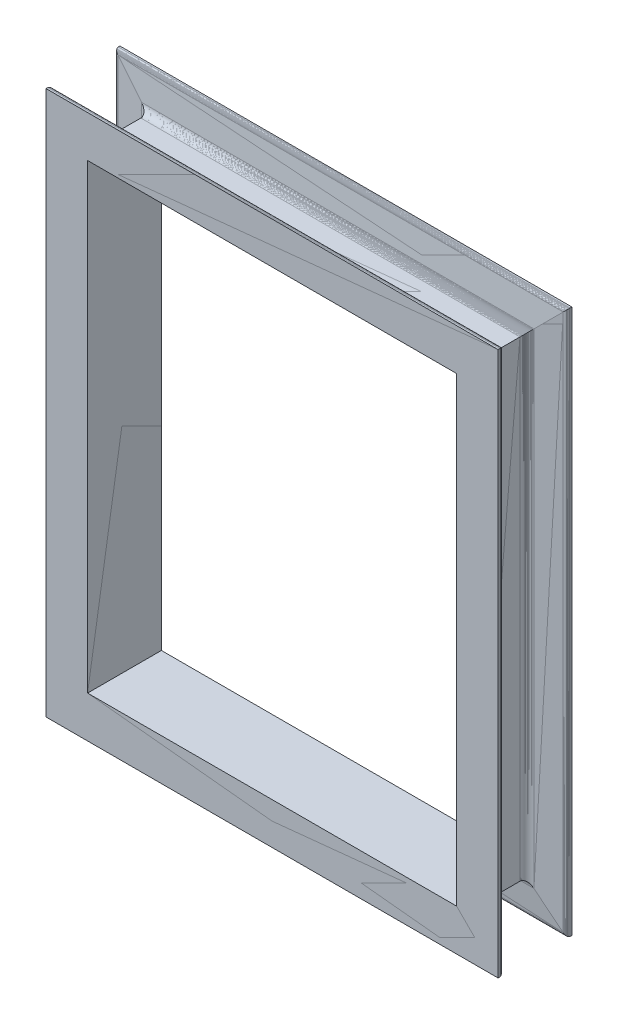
ISO-10303-21;
HEADER;
FILE_DESCRIPTION(('STEP AP214'),'2;1');
FILE_NAME('part.step','',(''),(''),'','','');
FILE_SCHEMA(('AUTOMOTIVE_DESIGN { 1 0 10303 214 1 1 1 1 }'));
ENDSEC;
DATA;
#1=APPLICATION_CONTEXT('core data for automotive mechanical design processes');
#2=APPLICATION_PROTOCOL_DEFINITION('international standard','automotive_design',2000,#1);
#3=PRODUCT_CONTEXT('',#1,'mechanical');
#4=PRODUCT('Part','Part','',(#3));
#5=PRODUCT_RELATED_PRODUCT_CATEGORY('part','',(#4));
#6=PRODUCT_DEFINITION_FORMATION('','',#4);
#7=PRODUCT_DEFINITION_CONTEXT('part definition',#1,'design');
#8=PRODUCT_DEFINITION('design','',#6,#7);
#9=PRODUCT_DEFINITION_SHAPE('','',#8);
#10=(LENGTH_UNIT() NAMED_UNIT(*) SI_UNIT(.MILLI.,.METRE.));
#11=(NAMED_UNIT(*) PLANE_ANGLE_UNIT() SI_UNIT($,.RADIAN.));
#12=(NAMED_UNIT(*) SI_UNIT($,.STERADIAN.) SOLID_ANGLE_UNIT());
#13=UNCERTAINTY_MEASURE_WITH_UNIT(LENGTH_MEASURE(1.E-05),#10,'distance_accuracy_value','');
#14=(GEOMETRIC_REPRESENTATION_CONTEXT(3) GLOBAL_UNCERTAINTY_ASSIGNED_CONTEXT((#13)) GLOBAL_UNIT_ASSIGNED_CONTEXT((#10,
#11,#12)) REPRESENTATION_CONTEXT('',''));
#15=CARTESIAN_POINT('',(0.,0.,0.));
#16=DIRECTION('',(0.,0.,1.));
#17=DIRECTION('',(1.,0.,0.));
#18=AXIS2_PLACEMENT_3D('',#15,#16,#17);
#19=CARTESIAN_POINT('',(259.,1541.,98.1774248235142));
#20=DIRECTION('',(1.,0.,0.));
#21=DIRECTION('',(0.,0.,-1.));
#22=AXIS2_PLACEMENT_3D('',#19,#20,#21);
#23=CYLINDRICAL_SURFACE('',#22,3.99999999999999);
#24=DIRECTION('',(1.,0.,0.));
#25=VECTOR('',#24,1.);
#26=CARTESIAN_POINT('',(255.,1545.,98.1774248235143));
#27=LINE('',#26,#25);
#28=CARTESIAN_POINT('',(255.,1545.,98.1774248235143));
#29=VERTEX_POINT('',#28);
#30=CARTESIAN_POINT('',(745.,1545.,98.1774248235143));
#31=VERTEX_POINT('',#30);
#32=EDGE_CURVE('E79',#29,#31,#27,.T.);
#33=ORIENTED_EDGE('',*,*,#32,.T.);
#34=CARTESIAN_POINT('',(745.,1545.,98.1774248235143));
#35=CARTESIAN_POINT('',(744.999999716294,1545.00000032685,98.1468926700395));
#36=CARTESIAN_POINT('',(744.999649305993,1544.99965043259,98.1163605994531));
#37=CARTESIAN_POINT('',(744.998250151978,1544.99825197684,98.0553032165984));
#38=CARTESIAN_POINT('',(744.997200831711,1544.99720283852,98.0247779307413));
#39=CARTESIAN_POINT('',(744.994403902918,1544.99440579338,97.9637501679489));
#40=CARTESIAN_POINT('',(744.992655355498,1544.99265694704,97.9332477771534));
#41=CARTESIAN_POINT('',(744.988460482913,1544.98846123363,97.8722817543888));
#42=CARTESIAN_POINT('',(744.986012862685,1544.98601307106,97.8418183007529));
#43=CARTESIAN_POINT('',(744.980426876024,1544.98042666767,97.78102185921));
#44=CARTESIAN_POINT('',(744.977288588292,1544.97728850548,97.7506888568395));
#45=CARTESIAN_POINT('',(744.970316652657,1544.97031697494,97.6900671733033));
#46=CARTESIAN_POINT('',(744.966480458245,1544.96648106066,97.6597790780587));
#47=CARTESIAN_POINT('',(744.958113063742,1544.95811395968,97.5992632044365));
#48=CARTESIAN_POINT('',(744.953579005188,1544.9535799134,97.5690362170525));
#49=CARTESIAN_POINT('',(744.94381630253,1544.94381683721,97.5086585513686));
#50=CARTESIAN_POINT('',(744.938584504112,1544.93858465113,97.4785088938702));
#51=CARTESIAN_POINT('',(744.927457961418,1544.92745781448,97.41847384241));
#52=CARTESIAN_POINT('',(744.921563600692,1544.92156354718,97.3885883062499));
#53=CARTESIAN_POINT('',(744.9090845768,1544.90908491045,97.3289022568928));
#54=CARTESIAN_POINT('',(744.902495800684,1544.90249642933,97.2991034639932));
#55=CARTESIAN_POINT('',(744.888628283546,1544.88862921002,97.2396070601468));
#56=CARTESIAN_POINT('',(744.881345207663,1544.881346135,97.2099114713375));
#57=CARTESIAN_POINT('',(744.866089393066,1544.86608992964,97.1506376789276));
#58=CARTESIAN_POINT('',(744.858112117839,1544.85811225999,97.1210618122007));
#59=CARTESIAN_POINT('',(744.841539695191,1544.84153955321,97.0622994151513));
#60=CARTESIAN_POINT('',(744.832945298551,1544.83294526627,97.0331124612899));
#61=CARTESIAN_POINT('',(744.815072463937,1544.81507283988,96.9748628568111));
#62=CARTESIAN_POINT('',(744.805788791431,1544.80578946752,96.9458034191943));
#63=CARTESIAN_POINT('',(744.786537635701,1544.78653860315,96.8878253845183));
#64=CARTESIAN_POINT('',(744.776564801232,1544.77656575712,96.8589103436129));
#65=CARTESIAN_POINT('',(744.755935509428,1544.75593605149,96.8012377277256));
#66=CARTESIAN_POINT('',(744.745273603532,1544.74527373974,96.7724840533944));
#67=CARTESIAN_POINT('',(744.723395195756,1544.72339505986,96.7154881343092));
#68=CARTESIAN_POINT('',(744.712180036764,1544.71218003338,96.6872448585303));
#69=CARTESIAN_POINT('',(744.68907265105,1544.6890730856,96.6309203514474));
#70=CARTESIAN_POINT('',(744.677174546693,1544.67717528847,96.60284394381));
#71=CARTESIAN_POINT('',(744.652701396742,1544.65270242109,96.5468703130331));
#72=CARTESIAN_POINT('',(744.640120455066,1544.64012145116,96.518978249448));
#73=CARTESIAN_POINT('',(744.614281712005,1544.61428226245,96.4633905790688));
#74=CARTESIAN_POINT('',(744.601018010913,1544.6010181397,96.4357004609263));
#75=CARTESIAN_POINT('',(744.574018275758,1544.57401814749,96.3809498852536));
#76=CARTESIAN_POINT('',(744.560284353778,1544.56028438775,96.3538873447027));
#77=CARTESIAN_POINT('',(744.532146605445,1544.5321471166,96.2999603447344));
#78=CARTESIAN_POINT('',(744.517736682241,1544.51773751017,96.2731022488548));
#79=CARTESIAN_POINT('',(744.488246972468,1544.48824807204,96.219602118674));
#80=CARTESIAN_POINT('',(744.473161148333,1544.47316219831,96.1929667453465));
#81=CARTESIAN_POINT('',(744.442319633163,1544.44232019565,96.1399302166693));
#82=CARTESIAN_POINT('',(744.426557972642,1544.42655809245,96.1135360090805));
#83=CARTESIAN_POINT('',(744.394664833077,1544.39466471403,96.0614907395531));
#84=CARTESIAN_POINT('',(744.378536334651,1544.37853641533,96.0358360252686));
#85=CARTESIAN_POINT('',(744.345616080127,1544.3456166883,95.9847587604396));
#86=CARTESIAN_POINT('',(744.328818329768,1544.32881926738,95.9593439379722));
#87=CARTESIAN_POINT('',(744.294559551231,1544.29456074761,95.9087655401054));
#88=CARTESIAN_POINT('',(744.277092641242,1544.2770937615,95.8836099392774));
#89=CARTESIAN_POINT('',(744.241495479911,1544.24149605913,95.8335692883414));
#90=CARTESIAN_POINT('',(744.223359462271,1544.22335957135,95.8086924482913));
#91=CARTESIAN_POINT('',(744.186842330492,1544.18684222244,95.7597897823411));
#92=CARTESIAN_POINT('',(744.168465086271,1544.16846522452,95.7357581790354));
#93=CARTESIAN_POINT('',(744.131052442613,1544.13105317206,95.6879589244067));
#94=CARTESIAN_POINT('',(744.112011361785,1544.11201243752,95.6642001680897));
#95=CARTESIAN_POINT('',(744.073270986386,1544.07327230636,95.6169671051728));
#96=CARTESIAN_POINT('',(744.053566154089,1544.05356736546,95.5935018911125));
#97=CARTESIAN_POINT('',(744.013498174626,1544.01349877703,95.5468766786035));
#98=CARTESIAN_POINT('',(743.993129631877,1543.99312972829,95.5237259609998));
#99=CARTESIAN_POINT('',(743.952297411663,1543.95229731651,95.4783769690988));
#100=CARTESIAN_POINT('',(743.931838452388,1543.93183866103,95.4561702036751));
#101=CARTESIAN_POINT('',(743.890264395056,1543.89026527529,95.4120496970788));
#102=CARTESIAN_POINT('',(743.869144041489,1543.86914529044,95.3901458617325));
#103=CARTESIAN_POINT('',(743.826247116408,1543.82624859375,95.3466535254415));
#104=CARTESIAN_POINT('',(743.804465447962,1543.80446677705,95.3250750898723));
#105=CARTESIAN_POINT('',(743.760245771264,1543.7602464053,95.2822561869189));
#106=CARTESIAN_POINT('',(743.737802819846,1543.73780290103,95.2610259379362));
#107=CARTESIAN_POINT('',(743.693001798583,1543.69300171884,95.2196121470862));
#108=CARTESIAN_POINT('',(743.670649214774,1543.67064951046,95.1994167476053));
#109=CARTESIAN_POINT('',(743.625284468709,1543.62528553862,95.1593448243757));
#110=CARTESIAN_POINT('',(743.602267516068,1543.60226898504,95.1394791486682));
#111=CARTESIAN_POINT('',(743.555573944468,1543.55557562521,95.100091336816));
#112=CARTESIAN_POINT('',(743.531892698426,1543.53189418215,95.0805801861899));
#113=CARTESIAN_POINT('',(743.483870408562,1543.48387108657,95.0419264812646));
#114=CARTESIAN_POINT('',(743.459524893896,1543.45952495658,95.0227950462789));
#115=CARTESIAN_POINT('',(743.411136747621,1543.4111366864,94.9856654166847));
#116=CARTESIAN_POINT('',(743.387100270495,1543.38710067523,94.9676512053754));
#117=CARTESIAN_POINT('',(743.338355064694,1543.33835637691,94.9319636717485));
#118=CARTESIAN_POINT('',(743.313641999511,1543.31364375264,94.9143021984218));
#119=CARTESIAN_POINT('',(743.2635435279,1543.26354547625,94.8793479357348));
#120=CARTESIAN_POINT('',(743.238153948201,1543.23815563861,94.8620671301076));
#121=CARTESIAN_POINT('',(743.18670231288,1543.18670305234,94.8279024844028));
#122=CARTESIAN_POINT('',(743.160636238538,1543.16063627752,94.8110307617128));
#123=CARTESIAN_POINT('',(743.109076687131,1543.10907664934,94.7784990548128));
#124=CARTESIAN_POINT('',(743.083589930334,1543.0835904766,94.7628178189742));
#125=CARTESIAN_POINT('',(743.031915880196,1543.03191751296,94.731813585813));
#126=CARTESIAN_POINT('',(743.00572466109,1543.00572679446,94.7165036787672));
#127=CARTESIAN_POINT('',(742.952641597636,1542.95264391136,94.6862742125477));
#128=CARTESIAN_POINT('',(742.925745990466,1542.92574796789,94.6713679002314));
#129=CARTESIAN_POINT('',(742.871254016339,1542.87125484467,94.6419783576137));
#130=CARTESIAN_POINT('',(742.843654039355,1542.84365404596,94.6275085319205));
#131=CARTESIAN_POINT('',(742.789373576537,1542.7893735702,94.5998512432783));
#132=CARTESIAN_POINT('',(742.762700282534,1542.76270102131,94.5866356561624));
#133=CARTESIAN_POINT('',(742.708597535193,1542.70859961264,94.5605741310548));
#134=CARTESIAN_POINT('',(742.681164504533,1542.68116717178,94.5477430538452));
#135=CARTESIAN_POINT('',(742.625542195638,1542.62554503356,94.5224889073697));
#136=CARTESIAN_POINT('',(742.597349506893,1542.59735190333,94.5100809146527));
#137=CARTESIAN_POINT('',(742.540207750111,1542.54020871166,94.4857121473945));
#138=CARTESIAN_POINT('',(742.511255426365,1542.51125538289,94.4737666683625));
#139=CARTESIAN_POINT('',(742.454746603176,1542.45474664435,94.4512219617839));
#140=CARTESIAN_POINT('',(742.42719769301,1542.42719871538,94.4405849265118));
#141=CARTESIAN_POINT('',(742.371236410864,1542.37123915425,94.4196836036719));
#142=CARTESIAN_POINT('',(742.342820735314,1542.34282421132,94.4094370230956));
#143=CARTESIAN_POINT('',(742.285125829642,1542.28512948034,94.3893647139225));
#144=CARTESIAN_POINT('',(742.25584347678,1542.25584653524,94.379557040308));
#145=CARTESIAN_POINT('',(742.196415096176,1542.19641626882,94.3604119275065));
#146=CARTESIAN_POINT('',(742.166266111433,1542.16626597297,94.3510928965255));
#147=CARTESIAN_POINT('',(742.10809544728,1542.10809557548,94.3338620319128));
#148=CARTESIAN_POINT('',(742.080081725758,1542.08008322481,94.3258970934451));
#149=CARTESIAN_POINT('',(742.02297105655,1542.02297493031,94.3103291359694));
#150=CARTESIAN_POINT('',(741.993870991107,1541.99387585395,94.3027490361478));
#151=CARTESIAN_POINT('',(741.934587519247,1541.93459260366,94.2880159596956));
#152=CARTESIAN_POINT('',(741.904401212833,1541.90440546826,94.2808865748));
#153=CARTESIAN_POINT('',(741.842945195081,1541.84294673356,94.2671223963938));
#154=CARTESIAN_POINT('',(741.811672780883,1541.81167239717,94.2605118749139));
#155=CARTESIAN_POINT('',(741.752642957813,1541.75264329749,94.2487702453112));
#156=CARTESIAN_POINT('',(741.724894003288,1541.72489648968,94.243556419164));
#157=CARTESIAN_POINT('',(741.667772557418,1541.6677788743,94.2334472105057));
#158=CARTESIAN_POINT('',(741.638397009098,1541.6384049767,94.2285865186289));
#159=CARTESIAN_POINT('',(741.578022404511,1541.57803057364,94.2192860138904));
#160=CARTESIAN_POINT('',(741.547020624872,1541.54702717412,94.2148826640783));
#161=CARTESIAN_POINT('',(741.483392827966,1541.48339562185,94.2066050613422));
#162=CARTESIAN_POINT('',(741.450764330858,1541.45076496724,94.202769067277));
#163=CARTESIAN_POINT('',(741.418113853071,1541.41811385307,94.1993372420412));
#164=B_SPLINE_CURVE_WITH_KNOTS('',3,(#34,#35,#36,#37,#38,#39,#40,#41,#42,#43,#44,#45,#46,#47,
#48,#49,#50,#51,#52,#53,#54,#55,#56,#57,#58,#59,#60,#61,#62,#63,#64,#65,#66,#67,#68,#69,#70,#71,
#72,#73,#74,#75,#76,#77,#78,#79,#80,#81,#82,#83,#84,#85,#86,#87,#88,#89,#90,#91,#92,#93,#94,#95,
#96,#97,#98,#99,#100,#101,#102,#103,#104,#105,#106,#107,#108,#109,#110,#111,#112,#113,#114,#115,
#116,#117,#118,#119,#120,#121,#122,#123,#124,#125,#126,#127,#128,#129,#130,#131,#132,#133,#134,
#135,#136,#137,#138,#139,#140,#141,#142,#143,#144,#145,#146,#147,#148,#149,#150,#151,#152,#153,
#154,#155,#156,#157,#158,#159,#160,#161,#162,#163),.UNSPECIFIED.,.F.,.F.,(4,2,2,2,2,2,2,2,2,2,2,
2,2,2,2,2,2,2,2,2,2,2,2,2,2,2,2,2,2,2,2,2,2,2,2,2,2,2,2,2,2,2,2,2,2,2,2,2,2,2,2,2,2,2,2,2,2,2,2,
2,2,2,2,2,4),(0.,0.0915923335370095,0.183260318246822,0.275051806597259,0.367014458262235,
0.458966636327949,0.551261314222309,0.643944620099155,0.737062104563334,0.830125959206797,
0.923775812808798,1.01805434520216,1.11300338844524,1.20783881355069,1.30348759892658,
1.3999877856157,1.49737641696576,1.59453929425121,1.69272345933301,1.79196169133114,
1.89228573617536,1.99220665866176,2.09333715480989,2.19570462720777,2.29933549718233,
2.40230890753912,2.50666333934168,2.61242108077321,2.71960354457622,2.82578517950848,
2.93350811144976,3.04279000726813,3.15364778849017,3.26305748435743,3.37416623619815,
3.4869876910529,3.60153488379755,3.71406149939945,3.82845488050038,3.94472527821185,
4.06288245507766,4.17828731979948,4.29575502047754,4.41529300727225,4.53690834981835,
4.65482202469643,4.77505222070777,4.89760412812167,5.02248264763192,5.14238435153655,
5.26496556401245,5.39022969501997,5.51817993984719,5.63933044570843,5.76373772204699,
5.89140381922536,6.02233063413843,6.14355303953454,6.26908318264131,6.39892212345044,
6.5330708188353,6.65182522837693,6.77729642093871,6.90948478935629,7.04839066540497),.UNSPECIFIED.);
#165=CARTESIAN_POINT('',(741.418113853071,1541.41811385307,94.1993372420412));
#166=VERTEX_POINT('',#165);
#167=EDGE_CURVE('E224',#31,#166,#164,.T.);
#168=ORIENTED_EDGE('',*,*,#167,.T.);
#169=DIRECTION('',(1.,0.,0.));
#170=VECTOR('',#169,1.);
#171=CARTESIAN_POINT('',(258.581886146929,1541.41811385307,94.1993372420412));
#172=LINE('',#171,#170);
#173=CARTESIAN_POINT('',(258.581886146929,1541.41811385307,94.1993372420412));
#174=VERTEX_POINT('',#173);
#175=EDGE_CURVE('E244',#174,#166,#172,.T.);
#176=ORIENTED_EDGE('',*,*,#175,.F.);
#177=CARTESIAN_POINT('',(259.,1541.,98.1774248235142));
#178=DIRECTION('',(0.707106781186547,0.707106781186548,0.));
#179=DIRECTION('',(-0.707106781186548,0.707106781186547,0.));
#180=AXIS2_PLACEMENT_3D('',#177,#178,#179);
#181=ELLIPSE('',#180,5.65685424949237,3.99999999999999);
#182=EDGE_CURVE('E457',#174,#29,#181,.T.);
#183=ORIENTED_EDGE('',*,*,#182,.T.);
#184=EDGE_LOOP('',(#33,#168,#176,#183));
#185=FACE_BOUND('',#184,.T.);
#186=ADVANCED_FACE('F51',(#185),#23,.T.);
#187=CARTESIAN_POINT('',(549.715687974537,1250.28431202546,63.5999416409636));
#188=DIRECTION('',(0.,0.104528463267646,-0.994521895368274));
#189=DIRECTION('',(0.,0.994521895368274,0.104528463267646));
#190=AXIS2_PLACEMENT_3D('',#187,#188,#189);
#191=PLANE('',#190);
#192=ORIENTED_EDGE('',*,*,#175,.T.);
#193=CARTESIAN_POINT('',(741.418113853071,1541.41811385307,94.1993372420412));
#194=DIRECTION('',(-0.705161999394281,-0.705161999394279,-0.0741155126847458));
#195=VECTOR('',#194,1.);
#196=LINE('',#193,#195);
#197=CARTESIAN_POINT('',(712.663772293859,1512.66377229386,91.1771341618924));
#198=VERTEX_POINT('',#197);
#199=EDGE_CURVE('E232',#166,#198,#196,.T.);
#200=ORIENTED_EDGE('',*,*,#199,.T.);
#201=DIRECTION('',(1.,0.,0.));
#202=VECTOR('',#201,1.);
#203=CARTESIAN_POINT('',(287.336227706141,1512.66377229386,91.1771341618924));
#204=LINE('',#203,#202);
#205=CARTESIAN_POINT('',(287.336227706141,1512.66377229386,91.1771341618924));
#206=VERTEX_POINT('',#205);
#207=EDGE_CURVE('E249',#206,#198,#204,.T.);
#208=ORIENTED_EDGE('',*,*,#207,.F.);
#209=DIRECTION('',(-0.70516199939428,0.70516199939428,0.0741155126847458));
#210=VECTOR('',#209,1.);
#211=CARTESIAN_POINT('',(549.715687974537,1250.28431202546,63.5999416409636));
#212=LINE('',#211,#210);
#213=EDGE_CURVE('E247',#206,#174,#212,.T.);
#214=ORIENTED_EDGE('',*,*,#213,.T.);
#215=EDGE_LOOP('',(#192,#200,#208,#214));
#216=FACE_BOUND('',#215,.T.);
#217=ADVANCED_FACE('F245',(#216),#191,.T.);
#218=CARTESIAN_POINT('',(286.5,1513.5,83.2209589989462));
#219=DIRECTION('',(1.,0.,0.));
#220=DIRECTION('',(0.,0.,-1.));
#221=AXIS2_PLACEMENT_3D('',#218,#219,#220);
#222=CYLINDRICAL_SURFACE('',#221,8.);
#223=ORIENTED_EDGE('',*,*,#207,.T.);
#224=CARTESIAN_POINT('',(712.663772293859,1512.66377229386,91.1771341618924));
#225=CARTESIAN_POINT('',(712.604831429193,1512.60482983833,91.1709389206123));
#226=CARTESIAN_POINT('',(712.545923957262,1512.54592233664,91.1640853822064));
#227=CARTESIAN_POINT('',(712.424743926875,1512.42474309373,91.1486175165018));
#228=CARTESIAN_POINT('',(712.362476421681,1512.3624764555,91.1399235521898));
#229=CARTESIAN_POINT('',(712.249297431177,1512.24929740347,91.1227562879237));
#230=CARTESIAN_POINT('',(712.198367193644,1512.19836653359,91.1145270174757));
#231=CARTESIAN_POINT('',(712.091589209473,1512.09158822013,91.0962108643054));
#232=CARTESIAN_POINT('',(712.035750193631,1512.03574960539,91.0860208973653));
#233=CARTESIAN_POINT('',(711.966402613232,1511.96640254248,91.0726002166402));
#234=CARTESIAN_POINT('',(711.952838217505,1511.9528382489,91.0699386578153));
#235=CARTESIAN_POINT('',(711.894874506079,1511.89487440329,91.0584089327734));
#236=CARTESIAN_POINT('',(711.850510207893,1511.85050857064,91.0491921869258));
#237=CARTESIAN_POINT('',(711.748641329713,1511.7486356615,91.0271226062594));
#238=CARTESIAN_POINT('',(711.691165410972,1511.69115709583,91.0140053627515));
#239=CARTESIAN_POINT('',(711.578135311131,1511.57812485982,90.9868890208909));
#240=CARTESIAN_POINT('',(711.522576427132,1511.52256639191,90.9729294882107));
#241=CARTESIAN_POINT('',(711.413380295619,1511.41337370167,90.9442403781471));
#242=CARTESIAN_POINT('',(711.359738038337,1511.35973438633,90.9295493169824));
#243=CARTESIAN_POINT('',(711.280058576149,1511.28005777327,90.9068287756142));
#244=CARTESIAN_POINT('',(711.253957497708,1511.25395738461,90.8992421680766));
#245=CARTESIAN_POINT('',(711.199268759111,1511.19926888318,90.8830426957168));
#246=CARTESIAN_POINT('',(711.170685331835,1511.17068488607,90.8744016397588));
#247=CARTESIAN_POINT('',(711.086005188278,1511.08600255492,90.8482826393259));
#248=CARTESIAN_POINT('',(711.029982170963,1511.02997743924,90.8303256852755));
#249=CARTESIAN_POINT('',(710.919469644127,1510.91946249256,90.7935501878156));
#250=CARTESIAN_POINT('',(710.864975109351,1510.8649675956,90.7747619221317));
#251=CARTESIAN_POINT('',(710.757519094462,1510.75751312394,90.7364058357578));
#252=CARTESIAN_POINT('',(710.70455234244,1510.70454822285,90.7168677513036));
#253=CARTESIAN_POINT('',(710.612917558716,1510.61291628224,90.6819555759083));
#254=CARTESIAN_POINT('',(710.574196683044,1510.5741964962,90.6668576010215));
#255=CARTESIAN_POINT('',(710.467385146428,1510.46738547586,90.6242443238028));
#256=CARTESIAN_POINT('',(710.39943089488,1510.39942874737,90.5960454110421));
#257=CARTESIAN_POINT('',(710.27870674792,1510.27870175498,90.5439753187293));
#258=CARTESIAN_POINT('',(710.22585170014,1510.22584599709,90.5204983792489));
#259=CARTESIAN_POINT('',(710.121485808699,1510.12148048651,90.4727747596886));
#260=CARTESIAN_POINT('',(710.069969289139,1510.06996502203,90.4485530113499));
#261=CARTESIAN_POINT('',(709.968281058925,1509.96827937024,90.3994040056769));
#262=CARTESIAN_POINT('',(709.918103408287,1509.91810323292,90.3745013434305));
#263=CARTESIAN_POINT('',(709.815932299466,1509.81593248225,90.3224427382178));
#264=CARTESIAN_POINT('',(709.763951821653,1509.76395073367,90.2952360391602));
#265=CARTESIAN_POINT('',(709.661237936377,1509.66123465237,90.2400202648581));
#266=CARTESIAN_POINT('',(709.610498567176,1509.61049435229,90.2120333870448));
#267=CARTESIAN_POINT('',(709.510267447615,1509.51026280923,90.1553121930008));
#268=CARTESIAN_POINT('',(709.460769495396,1509.46076533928,90.1265998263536));
#269=CARTESIAN_POINT('',(709.351050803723,1509.35104876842,90.0613640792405));
#270=CARTESIAN_POINT('',(709.290920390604,1509.29092022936,90.0245355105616));
#271=CARTESIAN_POINT('',(709.194041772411,1509.19404187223,89.9634098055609));
#272=CARTESIAN_POINT('',(709.157112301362,1509.1571118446,89.9396834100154));
#273=CARTESIAN_POINT('',(709.071899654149,1509.07189769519,89.8839354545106));
#274=CARTESIAN_POINT('',(709.023701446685,1509.02369847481,89.8516535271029));
#275=CARTESIAN_POINT('',(708.928504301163,1508.92850041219,89.786373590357));
#276=CARTESIAN_POINT('',(708.881498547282,1508.88149473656,89.7533954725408));
#277=CARTESIAN_POINT('',(708.788685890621,1508.78868324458,89.6867694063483));
#278=CARTESIAN_POINT('',(708.742871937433,1508.74287036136,89.6531411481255));
#279=CARTESIAN_POINT('',(708.674768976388,1508.67476857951,89.6020195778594));
#280=CARTESIAN_POINT('',(708.652310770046,1508.65231069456,89.5849754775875));
#281=CARTESIAN_POINT('',(708.606777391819,1508.60677746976,89.5500366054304));
#282=CARTESIAN_POINT('',(708.583705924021,1508.58370581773,89.5321321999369));
#283=CARTESIAN_POINT('',(708.515188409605,1508.51518744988,89.4783538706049));
#284=CARTESIAN_POINT('',(708.469920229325,1508.46991830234,89.44202557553));
#285=CARTESIAN_POINT('',(708.380562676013,1508.38055956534,89.368691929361));
#286=CARTESIAN_POINT('',(708.336465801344,1508.33646246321,89.3317048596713));
#287=CARTESIAN_POINT('',(708.249450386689,1508.24944759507,89.2570946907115));
#288=CARTESIAN_POINT('',(708.206524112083,1508.20652207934,89.2194896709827));
#289=CARTESIAN_POINT('',(708.132292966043,1508.1322922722,89.153033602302));
#290=CARTESIAN_POINT('',(708.100868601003,1508.10086848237,89.1244488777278));
#291=CARTESIAN_POINT('',(708.0164996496,1508.016499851,89.0464593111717));
#292=CARTESIAN_POINT('',(707.963837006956,1507.96383609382,88.9964426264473));
#293=CARTESIAN_POINT('',(707.870534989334,1507.87053264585,88.9053584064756));
#294=CARTESIAN_POINT('',(707.829720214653,1507.8297174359,88.864649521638));
#295=CARTESIAN_POINT('',(707.74926499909,1507.74926225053,88.7826375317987));
#296=CARTESIAN_POINT('',(707.709616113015,1507.70961381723,88.7413510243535));
#297=CARTESIAN_POINT('',(707.631493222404,1507.63149223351,88.6582214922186));
#298=CARTESIAN_POINT('',(707.593010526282,1507.59301038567,88.6163948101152));
#299=CARTESIAN_POINT('',(707.516150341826,1507.51615048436,88.5310332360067));
#300=CARTESIAN_POINT('',(707.477781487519,1507.47778104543,88.4874828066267));
#301=CARTESIAN_POINT('',(707.402223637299,1507.40222203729,88.3998014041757));
#302=CARTESIAN_POINT('',(707.365025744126,1507.36502357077,88.3556857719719));
#303=CARTESIAN_POINT('',(707.291810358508,1507.29180780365,88.2669094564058));
#304=CARTESIAN_POINT('',(707.255783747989,1507.25578137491,88.2222638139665));
#305=CARTESIAN_POINT('',(707.176184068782,1507.1761828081,88.1214041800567));
#306=CARTESIAN_POINT('',(707.13279255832,1507.13279239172,88.064902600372));
#307=CARTESIAN_POINT('',(707.064026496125,1507.06402659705,87.9728140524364));
#308=CARTESIAN_POINT('',(707.038292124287,1507.03829198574,87.9377620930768));
#309=CARTESIAN_POINT('',(706.979116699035,1506.97911575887,87.8557595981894));
#310=CARTESIAN_POINT('',(706.945834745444,1506.94583316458,87.8085788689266));
#311=CARTESIAN_POINT('',(706.880461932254,1506.88045969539,87.7137268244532));
#312=CARTESIAN_POINT('',(706.848361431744,1506.84835917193,87.666068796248));
#313=CARTESIAN_POINT('',(706.78535100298,1506.78534931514,87.5702935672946));
#314=CARTESIAN_POINT('',(706.754431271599,1506.75443017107,87.5221892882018));
#315=CARTESIAN_POINT('',(706.708805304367,1506.708804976,87.4494904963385));
#316=CARTESIAN_POINT('',(706.69379079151,1506.69379070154,87.4252817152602));
#317=CARTESIAN_POINT('',(706.663776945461,1506.66377703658,87.3763038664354));
#318=CARTESIAN_POINT('',(706.648780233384,1506.6487802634,87.3515315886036));
#319=CARTESIAN_POINT('',(706.604366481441,1506.60436607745,87.2772556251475));
#320=CARTESIAN_POINT('',(706.575263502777,1506.57526247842,87.227375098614));
#321=CARTESIAN_POINT('',(706.518261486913,1506.51825964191,87.1271830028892));
#322=CARTESIAN_POINT('',(706.490352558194,1506.49035050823,87.0768826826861));
#323=CARTESIAN_POINT('',(706.435738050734,1506.43573621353,86.975880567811));
#324=CARTESIAN_POINT('',(706.409022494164,1506.40902106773,86.9251895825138));
#325=CARTESIAN_POINT('',(706.363260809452,1506.36326026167,86.8360344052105));
#326=CARTESIAN_POINT('',(706.344009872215,1506.34400975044,86.7977798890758));
#327=CARTESIAN_POINT('',(706.293226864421,1506.29322706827,86.6948026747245));
#328=CARTESIAN_POINT('',(706.262161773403,1506.26216132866,86.6296171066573));
#329=CARTESIAN_POINT('',(706.207891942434,1506.20789054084,86.5116170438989));
#330=CARTESIAN_POINT('',(706.18440144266,1506.18439969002,86.4590646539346));
#331=CARTESIAN_POINT('',(706.138636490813,1506.13863462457,86.3536208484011));
#332=CARTESIAN_POINT('',(706.116352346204,1506.11635071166,86.3007378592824));
#333=CARTESIAN_POINT('',(706.073000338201,1506.07299956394,86.194663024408));
#334=CARTESIAN_POINT('',(706.051922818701,1506.05192266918,86.1414790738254));
#335=CARTESIAN_POINT('',(706.010739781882,1506.01073993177,86.0341943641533));
#336=CARTESIAN_POINT('',(705.990636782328,1505.99063660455,85.9800916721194));
#337=CARTESIAN_POINT('',(705.951658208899,1505.95165725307,85.8715847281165));
#338=CARTESIAN_POINT('',(705.932773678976,1505.93277227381,85.8171869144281));
#339=CARTESIAN_POINT('',(705.896232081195,1505.89623029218,85.7081194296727));
#340=CARTESIAN_POINT('',(705.878566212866,1505.87856448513,85.6534556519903));
#341=CARTESIAN_POINT('',(705.84023540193,1505.84023440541,85.530306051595));
#342=CARTESIAN_POINT('',(705.819862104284,1505.8198619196,85.4616376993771));
#343=CARTESIAN_POINT('',(705.78864273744,1505.78864284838,85.3509435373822));
#344=CARTESIAN_POINT('',(705.777241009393,1505.77724100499,85.3092288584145));
#345=CARTESIAN_POINT('',(705.751467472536,1505.75146693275,85.211821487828));
#346=CARTESIAN_POINT('',(705.737337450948,1505.73733640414,85.1560002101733));
#347=CARTESIAN_POINT('',(705.710313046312,1505.71031142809,85.044154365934));
#348=CARTESIAN_POINT('',(705.697411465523,1505.69740978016,84.9881332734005));
#349=CARTESIAN_POINT('',(705.672843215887,1505.67284187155,84.8759136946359));
#350=CARTESIAN_POINT('',(705.661169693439,1505.66116875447,84.8197182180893));
#351=CARTESIAN_POINT('',(705.644563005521,1505.64456269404,84.7351996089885));
#352=CARTESIAN_POINT('',(705.639188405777,1505.63918830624,84.7070486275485));
#353=CARTESIAN_POINT('',(705.628717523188,1505.62871762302,84.6505538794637));
#354=CARTESIAN_POINT('',(705.623622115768,1505.62362220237,84.6222097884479));
#355=CARTESIAN_POINT('',(705.608816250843,1505.60881606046,84.5372100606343));
#356=CARTESIAN_POINT('',(705.599549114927,1505.59954842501,84.4803985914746));
#357=CARTESIAN_POINT('',(705.582255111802,1505.58225372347,84.3666424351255));
#358=CARTESIAN_POINT('',(705.574223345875,1505.57422175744,84.3096992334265));
#359=CARTESIAN_POINT('',(705.559399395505,1505.55939788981,84.195704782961));
#360=CARTESIAN_POINT('',(705.552602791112,1505.55260156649,84.1386546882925));
#361=CARTESIAN_POINT('',(705.541788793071,1505.54178829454,84.038710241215));
#362=CARTESIAN_POINT('',(705.537502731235,1505.53750261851,83.9958733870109));
#363=CARTESIAN_POINT('',(705.526989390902,1505.5269895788,83.8814593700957));
#364=CARTESIAN_POINT('',(705.521373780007,1505.52137339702,83.8097673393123));
#365=CARTESIAN_POINT('',(705.51301036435,1505.51300898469,83.6806084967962));
#366=CARTESIAN_POINT('',(705.509912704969,1505.50991089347,83.6231861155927));
#367=CARTESIAN_POINT('',(705.504957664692,1505.50495560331,83.5083019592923));
#368=CARTESIAN_POINT('',(705.503098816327,1505.50309693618,83.4508403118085));
#369=CARTESIAN_POINT('',(705.500620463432,1505.50061931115,83.3359053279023));
#370=CARTESIAN_POINT('',(705.500000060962,1505.49999945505,83.2784320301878));
#371=CARTESIAN_POINT('',(705.5,1505.5,83.2209589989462));
#372=B_SPLINE_CURVE_WITH_KNOTS('',3,(#224,#225,#226,#227,#228,#229,#230,#231,#232,#233,#234,
#235,#236,#237,#238,#239,#240,#241,#242,#243,#244,#245,#246,#247,#248,#249,#250,#251,#252,#253,
#254,#255,#256,#257,#258,#259,#260,#261,#262,#263,#264,#265,#266,#267,#268,#269,#270,#271,#272,
#273,#274,#275,#276,#277,#278,#279,#280,#281,#282,#283,#284,#285,#286,#287,#288,#289,#290,#291,
#292,#293,#294,#295,#296,#297,#298,#299,#300,#301,#302,#303,#304,#305,#306,#307,#308,#309,#310,
#311,#312,#313,#314,#315,#316,#317,#318,#319,#320,#321,#322,#323,#324,#325,#326,#327,#328,#329,
#330,#331,#332,#333,#334,#335,#336,#337,#338,#339,#340,#341,#342,#343,#344,#345,#346,#347,#348,
#349,#350,#351,#352,#353,#354,#355,#356,#357,#358,#359,#360,#361,#362,#363,#364,#365,#366,#367,
#368,#369,#370,#371),.UNSPECIFIED.,.F.,.F.,(4,2,2,2,2,2,2,2,2,2,2,2,2,2,2,2,2,2,2,2,2,2,2,2,2,2,
2,2,2,2,2,2,2,2,2,2,2,2,2,2,2,2,2,2,2,2,2,2,2,2,2,2,2,2,2,2,2,2,2,2,2,2,2,2,2,2,2,2,2,2,2,2,2,
4),(0.,0.250756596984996,0.516204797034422,0.733684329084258,0.972541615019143,1.03064151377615,
1.22088148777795,1.46788066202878,1.707277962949,1.93907509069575,2.05212496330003,
2.17613392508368,2.41984032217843,2.65780339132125,2.89002639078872,3.06042958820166,
3.36087027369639,3.59590697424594,3.82622286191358,4.0518236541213,4.28696797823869,
4.51802092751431,4.74499063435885,5.02297186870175,5.19505756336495,5.42130773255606,
5.64391594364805,5.86289437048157,5.97102751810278,6.08267934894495,6.3034909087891,
6.52099633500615,6.73521221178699,6.89372685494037,7.16283491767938,7.37471864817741,
7.583599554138,7.78950047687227,7.99821688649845,8.20416746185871,8.40738031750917,
8.65758831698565,8.80916895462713,9.00908250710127,9.20652324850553,9.40152777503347,
9.49812996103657,9.59596061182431,9.78994635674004,9.98173894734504,10.1713830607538,
10.3122355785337,10.5480147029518,10.7345114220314,10.9191727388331,11.1020534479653,
11.2853838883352,11.4671611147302,11.6474467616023,11.8707985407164,12.0049581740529,
12.182802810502,12.3595313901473,12.5352145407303,12.6226888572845,12.710423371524,
12.8853060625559,13.0594763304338,13.233010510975,13.3627922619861,13.5791259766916,
13.7518691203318,13.9244072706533,14.0968202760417),.UNSPECIFIED.);
#373=CARTESIAN_POINT('',(705.5,1505.5,83.2209589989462));
#374=VERTEX_POINT('',#373);
#375=EDGE_CURVE('E240',#198,#374,#372,.T.);
#376=ORIENTED_EDGE('',*,*,#375,.T.);
#377=DIRECTION('',(1.,0.,0.));
#378=VECTOR('',#377,1.);
#379=CARTESIAN_POINT('',(294.5,1505.5,83.2209589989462));
#380=LINE('',#379,#378);
#381=CARTESIAN_POINT('',(294.5,1505.5,83.2209589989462));
#382=VERTEX_POINT('',#381);
#383=EDGE_CURVE('E292',#382,#374,#380,.T.);
#384=ORIENTED_EDGE('',*,*,#383,.F.);
#385=CARTESIAN_POINT('',(286.5,1513.5,83.2209589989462));
#386=DIRECTION('',(0.707106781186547,0.707106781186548,0.));
#387=DIRECTION('',(-0.707106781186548,0.707106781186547,0.));
#388=AXIS2_PLACEMENT_3D('',#385,#386,#387);
#389=ELLIPSE('',#388,11.3137084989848,8.);
#390=EDGE_CURVE('E591',#382,#206,#389,.F.);
#391=ORIENTED_EDGE('',*,*,#390,.T.);
#392=EDGE_LOOP('',(#223,#376,#384,#391));
#393=FACE_BOUND('',#392,.T.);
#394=ADVANCED_FACE('F276',(#393),#222,.F.);
#395=CARTESIAN_POINT('',(294.5,1505.5,83.2209589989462));
#396=DIRECTION('',(0.,1.,0.));
#397=DIRECTION('',(0.,0.,1.));
#398=AXIS2_PLACEMENT_3D('',#395,#396,#397);
#399=PLANE('',#398);
#400=ORIENTED_EDGE('',*,*,#383,.T.);
#401=CARTESIAN_POINT('',(705.5,1505.5,83.2209589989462));
#402=DIRECTION('',(0.,0.,-1.));
#403=VECTOR('',#402,1.);
#404=LINE('',#401,#403);
#405=CARTESIAN_POINT('',(705.5,1505.5,36.7790410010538));
#406=VERTEX_POINT('',#405);
#407=EDGE_CURVE('E718',#374,#406,#404,.T.);
#408=ORIENTED_EDGE('',*,*,#407,.T.);
#409=DIRECTION('',(1.,0.,0.));
#410=VECTOR('',#409,1.);
#411=CARTESIAN_POINT('',(294.5,1505.5,36.7790410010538));
#412=LINE('',#411,#410);
#413=CARTESIAN_POINT('',(294.5,1505.5,36.7790410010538));
#414=VERTEX_POINT('',#413);
#415=EDGE_CURVE('E308',#414,#406,#412,.T.);
#416=ORIENTED_EDGE('',*,*,#415,.F.);
#417=DIRECTION('',(0.,0.,1.));
#418=VECTOR('',#417,1.);
#419=CARTESIAN_POINT('',(294.5,1505.5,83.2209589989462));
#420=LINE('',#419,#418);
#421=EDGE_CURVE('E594',#414,#382,#420,.T.);
#422=ORIENTED_EDGE('',*,*,#421,.T.);
#423=EDGE_LOOP('',(#400,#408,#416,#422));
#424=FACE_BOUND('',#423,.T.);
#425=ADVANCED_FACE('F314',(#424),#399,.T.);
#426=CARTESIAN_POINT('',(286.5,1513.5,36.7790410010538));
#427=DIRECTION('',(1.,0.,0.));
#428=DIRECTION('',(0.,0.,-1.));
#429=AXIS2_PLACEMENT_3D('',#426,#427,#428);
#430=CYLINDRICAL_SURFACE('',#429,8.);
#431=ORIENTED_EDGE('',*,*,#415,.T.);
#432=CARTESIAN_POINT('',(705.5,1505.5,36.7790410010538));
#433=CARTESIAN_POINT('',(705.500000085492,1505.49999947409,36.7215720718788));
#434=CARTESIAN_POINT('',(705.500620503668,1505.50061922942,36.6641030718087));
#435=CARTESIAN_POINT('',(705.50309883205,1505.50309652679,36.549174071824));
#436=CARTESIAN_POINT('',(705.504957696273,1505.50495502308,36.4917141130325));
#437=CARTESIAN_POINT('',(705.509912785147,1505.50991007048,36.3768303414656));
#438=CARTESIAN_POINT('',(705.513010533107,1505.51300814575,36.3194066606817));
#439=CARTESIAN_POINT('',(705.520442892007,1505.52044151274,36.2046201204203));
#440=CARTESIAN_POINT('',(705.524779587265,1505.52477888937,36.1472575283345));
#441=CARTESIAN_POINT('',(705.530967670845,1505.53096751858,36.0756717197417));
#442=CARTESIAN_POINT('',(705.532244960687,1505.5322449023,36.0613464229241));
#443=CARTESIAN_POINT('',(705.537501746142,1505.53750192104,36.0041348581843));
#444=CARTESIAN_POINT('',(705.541786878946,1505.54178691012,35.9613038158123));
#445=CARTESIAN_POINT('',(705.552599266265,1505.55259874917,35.8613696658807));
#446=CARTESIAN_POINT('',(705.559395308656,1505.55939431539,35.8043245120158));
#447=CARTESIAN_POINT('',(705.574218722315,1505.57421717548,35.6903341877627));
#448=CARTESIAN_POINT('',(705.582250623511,1505.58224900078,35.6333901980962));
#449=CARTESIAN_POINT('',(705.599545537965,1505.59954422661,35.5196274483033));
#450=CARTESIAN_POINT('',(705.608813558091,1505.60881263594,35.4628102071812));
#451=CARTESIAN_POINT('',(705.623620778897,1505.62362047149,35.3777998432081));
#452=CARTESIAN_POINT('',(705.628716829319,1505.62871673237,35.349450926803));
#453=CARTESIAN_POINT('',(705.639187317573,1505.6391874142,35.2929561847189));
#454=CARTESIAN_POINT('',(705.644560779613,1505.64456086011,35.2648099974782));
#455=CARTESIAN_POINT('',(705.661164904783,1505.6611646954,35.180301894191));
#456=CARTESIAN_POINT('',(705.672837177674,1505.67283645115,35.1241121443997));
#457=CARTESIAN_POINT('',(705.697403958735,1505.69740251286,35.0118988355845));
#458=CARTESIAN_POINT('',(705.710305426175,1505.71030378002,34.9558783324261));
#459=CARTESIAN_POINT('',(705.737330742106,1505.73732919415,34.8440285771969));
#460=CARTESIAN_POINT('',(705.751461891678,1505.75146064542,34.788202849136));
#461=CARTESIAN_POINT('',(705.777237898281,1505.77723739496,34.6907843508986));
#462=CARTESIAN_POINT('',(705.788641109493,1505.78864099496,34.649063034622));
#463=CARTESIAN_POINT('',(705.819859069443,1505.81985926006,34.5383717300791));
#464=CARTESIAN_POINT('',(705.840229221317,1505.84022884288,34.4697127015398));
#465=CARTESIAN_POINT('',(705.878556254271,1505.87855499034,34.3465741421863));
#466=CARTESIAN_POINT('',(705.896221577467,1505.89621996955,34.2919121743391));
#467=CARTESIAN_POINT('',(705.932763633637,1505.93276188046,34.1828433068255));
#468=CARTESIAN_POINT('',(705.951649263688,1505.95164771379,34.128442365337));
#469=CARTESIAN_POINT('',(705.990631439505,1505.99063069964,34.0199242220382));
#470=CARTESIAN_POINT('',(706.010737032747,1506.01073690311,33.9658135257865));
#471=CARTESIAN_POINT('',(706.051919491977,1506.05191962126,33.858528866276));
#472=CARTESIAN_POINT('',(706.072993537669,1506.0729933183,33.80535273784));
#473=CARTESIAN_POINT('',(706.116340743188,1506.11633970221,33.6992885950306));
#474=CARTESIAN_POINT('',(706.138623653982,1506.13862213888,33.6464085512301));
#475=CARTESIAN_POINT('',(706.184388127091,1506.1843862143,33.5409657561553));
#476=CARTESIAN_POINT('',(706.20787947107,1506.20787764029,33.4884115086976));
#477=CARTESIAN_POINT('',(706.262153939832,1506.26215291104,33.370400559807));
#478=CARTESIAN_POINT('',(706.293222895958,1506.29322275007,33.3052060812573));
#479=CARTESIAN_POINT('',(706.344006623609,1506.34400671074,33.2022262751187));
#480=CARTESIAN_POINT('',(706.363254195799,1506.36325410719,33.1639778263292));
#481=CARTESIAN_POINT('',(706.409010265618,1506.40900949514,33.0748326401));
#482=CARTESIAN_POINT('',(706.435723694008,1506.43572232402,33.0241456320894));
#483=CARTESIAN_POINT('',(706.490336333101,1506.49033432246,32.9231467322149));
#484=CARTESIAN_POINT('',(706.518245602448,1506.51824355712,32.8728457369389));
#485=CARTESIAN_POINT('',(706.575250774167,1506.57524921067,32.7726477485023));
#486=CARTESIAN_POINT('',(706.604356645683,1506.60435560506,32.7227620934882));
#487=CARTESIAN_POINT('',(706.648775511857,1506.64877519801,32.6484767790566));
#488=CARTESIAN_POINT('',(706.663774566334,1506.66377448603,32.6237002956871));
#489=CARTESIAN_POINT('',(706.693788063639,1506.69378814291,32.5747224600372));
#490=CARTESIAN_POINT('',(706.708799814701,1506.70879982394,32.5505178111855));
#491=CARTESIAN_POINT('',(706.754419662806,1506.75441919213,32.4778280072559));
#492=CARTESIAN_POINT('',(706.7853361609,1506.78533500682,32.4297285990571));
#493=CARTESIAN_POINT('',(706.848342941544,1506.84834089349,32.3339585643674));
#494=CARTESIAN_POINT('',(706.880443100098,1506.88044084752,32.2863009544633));
#495=CARTESIAN_POINT('',(706.945818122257,1506.94581612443,32.1914454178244));
#496=CARTESIAN_POINT('',(706.979102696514,1506.97910116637,32.1442608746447));
#497=CARTESIAN_POINT('',(707.038284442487,1507.03828388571,32.0622489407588));
#498=CARTESIAN_POINT('',(707.064022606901,1507.06402251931,32.0271914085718));
#499=CARTESIAN_POINT('',(707.132786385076,1507.13278652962,31.9351052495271));
#500=CARTESIAN_POINT('',(707.176171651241,1507.17617090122,31.8786113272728));
#501=CARTESIAN_POINT('',(707.255763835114,1507.25576184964,31.7777605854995));
#502=CARTESIAN_POINT('',(707.29178925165,1507.29178685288,31.7331163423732));
#503=CARTESIAN_POINT('',(707.365005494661,1507.3650030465,31.644338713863));
#504=CARTESIAN_POINT('',(707.402205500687,1507.40220342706,31.600220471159));
#505=CARTESIAN_POINT('',(707.47777073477,1507.47776984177,31.5125299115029));
#506=CARTESIAN_POINT('',(707.516144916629,1507.51614483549,31.4689730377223));
#507=CARTESIAN_POINT('',(707.593004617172,1507.59300469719,31.3836115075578));
#508=CARTESIAN_POINT('',(707.631481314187,1507.6314807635,31.3417909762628));
#509=CARTESIAN_POINT('',(707.7095959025,1507.70959407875,31.2586697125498));
#510=CARTESIAN_POINT('',(707.749242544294,1507.74924007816,31.2173854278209));
#511=CARTESIAN_POINT('',(707.829696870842,1507.82969397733,31.1353740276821));
#512=CARTESIAN_POINT('',(707.870513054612,1507.87051038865,31.0946636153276));
#513=CARTESIAN_POINT('',(707.963823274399,1507.96382191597,31.0035708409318));
#514=CARTESIAN_POINT('',(708.016492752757,1508.01649268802,30.9535473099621));
#515=CARTESIAN_POINT('',(708.100863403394,1508.10086344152,30.875555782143));
#516=CARTESIAN_POINT('',(708.132282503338,1508.13228215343,30.8469756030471));
#517=CARTESIAN_POINT('',(708.206504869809,1508.20650333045,30.7805269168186));
#518=CARTESIAN_POINT('',(708.249427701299,1508.24942526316,30.7429247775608));
#519=CARTESIAN_POINT('',(708.336440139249,1508.33643683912,30.6683167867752));
#520=CARTESIAN_POINT('',(708.3805375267,1508.38053427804,30.6313291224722));
#521=CARTESIAN_POINT('',(708.469900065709,1508.46989775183,30.5579909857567));
#522=CARTESIAN_POINT('',(708.515172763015,1508.51517134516,30.5216589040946));
#523=CARTESIAN_POINT('',(708.583698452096,1508.58369809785,30.4678737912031));
#524=CARTESIAN_POINT('',(708.606773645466,1508.60677359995,30.4499663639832));
#525=CARTESIAN_POINT('',(708.652306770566,1508.65230681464,30.4150274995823));
#526=CARTESIAN_POINT('',(708.674760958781,1508.67476080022,30.3979863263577));
#527=CARTESIAN_POINT('',(708.742855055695,1508.74285392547,30.3468710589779));
#528=CARTESIAN_POINT('',(708.788664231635,1508.7886619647,30.3132461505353));
#529=CARTESIAN_POINT('',(708.88147154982,1508.88146789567,30.2466235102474));
#530=CARTESIAN_POINT('',(708.92847678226,1508.92847289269,30.2136455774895));
#531=CARTESIAN_POINT('',(709.023677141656,1509.02367389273,30.1483630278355));
#532=CARTESIAN_POINT('',(709.071879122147,1509.07187676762,30.116078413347));
#533=CARTESIAN_POINT('',(709.157101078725,1509.15710034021,30.060323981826));
#534=CARTESIAN_POINT('',(709.194036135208,1509.19403610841,30.0365938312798));
#535=CARTESIAN_POINT('',(709.2909119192,1509.29091196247,29.9754697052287));
#536=CARTESIAN_POINT('',(709.351033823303,1509.35103212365,29.9386461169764));
#537=CARTESIAN_POINT('',(709.460742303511,1509.46073840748,29.8734159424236));
#538=CARTESIAN_POINT('',(709.510238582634,1509.51023405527,29.8447043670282));
#539=CARTESIAN_POINT('',(709.610470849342,1509.61046647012,29.7879820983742));
#540=CARTESIAN_POINT('',(709.661213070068,1509.66120949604,29.7599934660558));
#541=CARTESIAN_POINT('',(709.763937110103,1509.76393574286,29.7047718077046));
#542=CARTESIAN_POINT('',(709.815924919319,1509.81592496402,29.6775610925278));
#543=CARTESIAN_POINT('',(709.918095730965,1509.91809568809,29.6255025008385));
#544=CARTESIAN_POINT('',(709.968265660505,1509.96826423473,29.6006035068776));
#545=CARTESIAN_POINT('',(710.069943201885,1510.06993922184,29.5514592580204));
#546=CARTESIAN_POINT('',(710.121456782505,1510.12145163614,29.5272387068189));
#547=CARTESIAN_POINT('',(710.225821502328,1510.22581574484,29.4795151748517));
#548=CARTESIAN_POINT('',(710.278678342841,1510.27867317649,29.4560372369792));
#549=CARTESIAN_POINT('',(710.399413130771,1510.3994107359,29.4039620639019));
#550=CARTESIAN_POINT('',(710.467376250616,1510.46737643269,29.3757592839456));
#551=CARTESIAN_POINT('',(710.57419026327,1510.57419016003,29.3331449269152));
#552=CARTESIAN_POINT('',(710.612904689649,1510.61290359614,29.3180493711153));
#553=CARTESIAN_POINT('',(710.704528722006,1510.70452486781,29.2831409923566));
#554=CARTESIAN_POINT('',(710.757491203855,1510.75748542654,29.2636043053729));
#555=CARTESIAN_POINT('',(710.86494354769,1510.86493606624,29.2252490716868));
#556=CARTESIAN_POINT('',(710.919438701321,1510.9194314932,29.2064603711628));
#557=CARTESIAN_POINT('',(711.029957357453,1511.02995244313,29.1696823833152));
#558=CARTESIAN_POINT('',(711.085985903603,1511.0859830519,29.1517234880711));
#559=CARTESIAN_POINT('',(711.170676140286,1511.1706755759,29.1256011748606));
#560=CARTESIAN_POINT('',(711.199264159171,1511.19926422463,29.1169586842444));
#561=CARTESIAN_POINT('',(711.253952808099,1511.25395274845,29.1007592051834));
#562=CARTESIAN_POINT('',(711.280049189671,1511.28004849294,29.0931739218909));
#563=CARTESIAN_POINT('',(711.359718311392,1511.35971486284,29.0704561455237));
#564=CARTESIAN_POINT('',(711.413354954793,1511.41334854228,29.0557664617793));
#565=CARTESIAN_POINT('',(711.522544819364,1511.52253485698,29.0270785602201));
#566=CARTESIAN_POINT('',(711.578103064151,1511.57809259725,29.0131189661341));
#567=CARTESIAN_POINT('',(711.691136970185,1511.69112858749,28.9860012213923));
#568=CARTESIAN_POINT('',(711.748617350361,1511.74861165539,28.9728827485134));
#569=CARTESIAN_POINT('',(711.850496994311,1511.85049515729,28.9508106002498));
#570=CARTESIAN_POINT('',(711.894867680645,1511.89486722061,28.9415925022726));
#571=CARTESIAN_POINT('',(712.008577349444,1512.00857806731,28.9189739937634));
#572=CARTESIAN_POINT('',(712.077972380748,1512.07797158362,28.9061251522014));
#573=CARTESIAN_POINT('',(712.198344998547,1512.19834413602,28.8854766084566));
#574=CARTESIAN_POINT('',(712.249286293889,1512.24928619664,28.8772454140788));
#575=CARTESIAN_POINT('',(712.362469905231,1512.36247002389,28.8600774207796));
#576=CARTESIAN_POINT('',(712.42473097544,1512.42473021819,28.8513842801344));
#577=CARTESIAN_POINT('',(712.545911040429,1512.54590944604,28.8359161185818));
#578=CARTESIAN_POINT('',(712.604824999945,1512.60482339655,28.8290617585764));
#579=CARTESIAN_POINT('',(712.663772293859,1512.66377229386,28.8228658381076));
#580=B_SPLINE_CURVE_WITH_KNOTS('',3,(#432,#433,#434,#435,#436,#437,#438,#439,#440,#441,#442,
#443,#444,#445,#446,#447,#448,#449,#450,#451,#452,#453,#454,#455,#456,#457,#458,#459,#460,#461,
#462,#463,#464,#465,#466,#467,#468,#469,#470,#471,#472,#473,#474,#475,#476,#477,#478,#479,#480,
#481,#482,#483,#484,#485,#486,#487,#488,#489,#490,#491,#492,#493,#494,#495,#496,#497,#498,#499,
#500,#501,#502,#503,#504,#505,#506,#507,#508,#509,#510,#511,#512,#513,#514,#515,#516,#517,#518,
#519,#520,#521,#522,#523,#524,#525,#526,#527,#528,#529,#530,#531,#532,#533,#534,#535,#536,#537,
#538,#539,#540,#541,#542,#543,#544,#545,#546,#547,#548,#549,#550,#551,#552,#553,#554,#555,#556,
#557,#558,#559,#560,#561,#562,#563,#564,#565,#566,#567,#568,#569,#570,#571,#572,#573,#574,#575,
#576,#577,#578,#579),.UNSPECIFIED.,.F.,.F.,(4,2,2,2,2,2,2,2,2,2,2,2,2,2,2,2,2,2,2,2,2,2,2,2,2,2,
2,2,2,2,2,2,2,2,2,2,2,2,2,2,2,2,2,2,2,2,2,2,2,2,2,2,2,2,2,2,2,2,2,2,2,2,2,2,2,2,2,2,2,2,2,2,2,
4),(0.,0.172400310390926,0.344933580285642,0.517679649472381,0.690718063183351,
0.734034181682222,0.863795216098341,1.03731557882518,1.21148782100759,1.38638827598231,
1.47413758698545,1.56159687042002,1.73726197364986,1.91398854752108,2.09184722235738,
2.22602790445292,2.44934893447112,2.62962842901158,2.81141590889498,2.99477299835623,
3.17762632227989,3.36227710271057,3.54878014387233,3.78459086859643,3.92542058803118,
4.11504949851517,4.30684426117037,4.50084955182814,4.5986964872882,4.69528186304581,
4.89026621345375,5.08770471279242,5.28763395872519,5.43923813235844,5.68941140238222,
5.89261731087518,6.09857946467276,6.30732597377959,6.51319584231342,6.72206480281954,
6.93395570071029,7.20309959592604,7.36158841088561,7.57578706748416,7.79329495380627,
8.01412865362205,8.12579893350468,8.23391313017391,8.45286881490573,8.67547449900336,
8.90174235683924,9.07385458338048,9.35179701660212,9.57875896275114,9.80982484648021,
10.0450027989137,10.2705693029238,10.5008720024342,10.7359166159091,11.0363968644,
11.2067719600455,11.438976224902,11.6769419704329,11.9206724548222,12.044701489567,
12.1577311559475,12.389504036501,12.6288986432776,12.875916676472,13.0661849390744,
13.3630922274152,13.5806195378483,13.8460402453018,14.096824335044),.UNSPECIFIED.);
#581=CARTESIAN_POINT('',(712.663772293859,1512.66377229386,28.8228658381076));
#582=VERTEX_POINT('',#581);
#583=EDGE_CURVE('E735',#406,#582,#580,.T.);
#584=ORIENTED_EDGE('',*,*,#583,.T.);
#585=DIRECTION('',(1.,0.,0.));
#586=VECTOR('',#585,1.);
#587=CARTESIAN_POINT('',(287.336227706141,1512.66377229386,28.8228658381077));
#588=LINE('',#587,#586);
#589=CARTESIAN_POINT('',(287.336227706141,1512.66377229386,28.8228658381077));
#590=VERTEX_POINT('',#589);
#591=EDGE_CURVE('E345',#590,#582,#588,.T.);
#592=ORIENTED_EDGE('',*,*,#591,.F.);
#593=CARTESIAN_POINT('',(286.5,1513.5,36.7790410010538));
#594=DIRECTION('',(0.707106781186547,0.707106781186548,0.));
#595=DIRECTION('',(-0.707106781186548,0.707106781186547,0.));
#596=AXIS2_PLACEMENT_3D('',#593,#594,#595);
#597=ELLIPSE('',#596,11.3137084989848,8.);
#598=EDGE_CURVE('E597',#590,#414,#597,.F.);
#599=ORIENTED_EDGE('',*,*,#598,.T.);
#600=EDGE_LOOP('',(#431,#584,#592,#599));
#601=FACE_BOUND('',#600,.T.);
#602=ADVANCED_FACE('F323',(#601),#430,.F.);
#603=CARTESIAN_POINT('',(549.715687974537,1250.28431202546,56.4000583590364));
#604=DIRECTION('',(0.,0.104528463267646,0.994521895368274));
#605=DIRECTION('',(0.,-0.994521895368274,0.104528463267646));
#606=AXIS2_PLACEMENT_3D('',#603,#604,#605);
#607=PLANE('',#606);
#608=ORIENTED_EDGE('',*,*,#591,.T.);
#609=CARTESIAN_POINT('',(712.663772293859,1512.66377229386,28.8228658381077));
#610=DIRECTION('',(0.705161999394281,0.705161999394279,-0.0741155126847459));
#611=VECTOR('',#610,1.);
#612=LINE('',#609,#611);
#613=CARTESIAN_POINT('',(741.418113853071,1541.41811385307,25.8006627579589));
#614=VERTEX_POINT('',#613);
#615=EDGE_CURVE('E369',#582,#614,#612,.T.);
#616=ORIENTED_EDGE('',*,*,#615,.T.);
#617=DIRECTION('',(1.,0.,0.));
#618=VECTOR('',#617,1.);
#619=CARTESIAN_POINT('',(258.581886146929,1541.41811385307,25.8006627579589));
#620=LINE('',#619,#618);
#621=CARTESIAN_POINT('',(258.581886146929,1541.41811385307,25.8006627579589));
#622=VERTEX_POINT('',#621);
#623=EDGE_CURVE('E349',#622,#614,#620,.T.);
#624=ORIENTED_EDGE('',*,*,#623,.F.);
#625=DIRECTION('',(0.70516199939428,-0.70516199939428,0.0741155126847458));
#626=VECTOR('',#625,1.);
#627=CARTESIAN_POINT('',(549.715687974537,1250.28431202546,56.4000583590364));
#628=LINE('',#627,#626);
#629=EDGE_CURVE('E599',#622,#590,#628,.T.);
#630=ORIENTED_EDGE('',*,*,#629,.T.);
#631=EDGE_LOOP('',(#608,#616,#624,#630));
#632=FACE_BOUND('',#631,.T.);
#633=ADVANCED_FACE('F328',(#632),#607,.T.);
#634=CARTESIAN_POINT('',(259.,1541.,21.8225751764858));
#635=DIRECTION('',(1.,0.,0.));
#636=DIRECTION('',(0.,0.,-1.));
#637=AXIS2_PLACEMENT_3D('',#634,#635,#636);
#638=CYLINDRICAL_SURFACE('',#637,4.);
#639=ORIENTED_EDGE('',*,*,#623,.T.);
#640=CARTESIAN_POINT('',(741.418113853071,1541.41811385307,25.8006627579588));
#641=CARTESIAN_POINT('',(741.450759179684,1541.4507598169,25.7972314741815));
#642=CARTESIAN_POINT('',(741.483382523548,1541.48338533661,25.7933961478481));
#643=CARTESIAN_POINT('',(741.547003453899,1541.5470100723,25.7851196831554));
#644=CARTESIAN_POINT('',(741.578003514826,1541.578011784,25.7807167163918));
#645=CARTESIAN_POINT('',(741.638378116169,1541.63838623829,25.7714165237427));
#646=CARTESIAN_POINT('',(741.667755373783,1541.66776186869,25.7665556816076));
#647=CARTESIAN_POINT('',(741.724883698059,1541.72488631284,25.7564454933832));
#648=CARTESIAN_POINT('',(741.752637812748,1541.75263821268,25.751230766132));
#649=CARTESIAN_POINT('',(741.811664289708,1541.81166383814,25.7394898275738));
#650=CARTESIAN_POINT('',(741.842928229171,1541.84292963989,25.7328812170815));
#651=CARTESIAN_POINT('',(741.904372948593,1541.90437708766,25.719119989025));
#652=CARTESIAN_POINT('',(741.934556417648,1541.9345614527,25.7119915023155));
#653=CARTESIAN_POINT('',(741.993839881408,1541.99384483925,25.6972589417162));
#654=CARTESIAN_POINT('',(742.02294275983,1542.02294680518,25.6896783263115));
#655=CARTESIAN_POINT('',(742.080064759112,1542.08006642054,25.6741076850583));
#656=CARTESIAN_POINT('',(742.108086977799,1542.10808718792,25.6661404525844));
#657=CARTESIAN_POINT('',(742.166257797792,1542.16625757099,25.648909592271));
#658=CARTESIAN_POINT('',(742.196398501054,1542.19639949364,25.639593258));
#659=CARTESIAN_POINT('',(742.255815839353,1542.25581872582,25.6204521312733));
#660=CARTESIAN_POINT('',(742.285095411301,1542.28509898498,25.6106456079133));
#661=CARTESIAN_POINT('',(742.342790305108,1542.34279390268,25.5905738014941));
#662=CARTESIAN_POINT('',(742.371208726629,1542.37121169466,25.5803264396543));
#663=CARTESIAN_POINT('',(742.427181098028,1542.42718233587,25.5594213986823));
#664=CARTESIAN_POINT('',(742.454738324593,1542.45473847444,25.5487812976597));
#665=CARTESIAN_POINT('',(742.511247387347,1542.51124722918,25.5262365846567));
#666=CARTESIAN_POINT('',(742.540191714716,1542.54019244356,25.5142945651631));
#667=CARTESIAN_POINT('',(742.597322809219,1542.59732498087,25.4899307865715));
#668=CARTESIAN_POINT('',(742.625512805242,1542.62551553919,25.4775241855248));
#669=CARTESIAN_POINT('',(742.681135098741,1542.68113791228,25.4522705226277));
#670=CARTESIAN_POINT('',(742.708570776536,1542.70857312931,25.4394384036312));
#671=CARTESIAN_POINT('',(742.762684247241,1542.76268525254,25.4133721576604));
#672=CARTESIAN_POINT('',(742.789365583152,1542.78936571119,25.400152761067));
#673=CARTESIAN_POINT('',(742.84364635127,1542.84364621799,25.372495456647));
#674=CARTESIAN_POINT('',(742.871238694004,1542.87123923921,25.3580298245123));
#675=CARTESIAN_POINT('',(742.925720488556,1542.9257221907,25.3286462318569));
#676=CARTESIAN_POINT('',(742.952613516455,1542.9526157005,25.313741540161));
#677=CARTESIAN_POINT('',(743.005696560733,1543.00569886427,25.2835125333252));
#678=CARTESIAN_POINT('',(743.031890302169,1543.03189225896,25.2682013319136));
#679=CARTESIAN_POINT('',(743.083574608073,1543.08357546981,25.2371914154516));
#680=CARTESIAN_POINT('',(743.109069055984,1543.10906917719,25.2215056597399));
#681=CARTESIAN_POINT('',(743.160628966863,1543.16062884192,25.1889739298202));
#682=CARTESIAN_POINT('',(743.186687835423,1543.18668824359,25.1721071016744));
#683=CARTESIAN_POINT('',(743.238129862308,1543.23813122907,25.1379493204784));
#684=CARTESIAN_POINT('',(743.263516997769,1543.2635187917,25.120670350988));
#685=CARTESIAN_POINT('',(743.31361544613,1543.31361739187,25.0857165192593));
#686=CARTESIAN_POINT('',(743.338330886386,1543.33833256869,25.0680535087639));
#687=CARTESIAN_POINT('',(743.387085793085,1543.38708655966,25.0323593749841));
#688=CARTESIAN_POINT('',(743.411129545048,1543.41112966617,25.014339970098));
#689=CARTESIAN_POINT('',(743.459518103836,1543.45951797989,24.9772103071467));
#690=CARTESIAN_POINT('',(743.483856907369,1543.48385720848,24.9580844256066));
#691=CARTESIAN_POINT('',(743.531870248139,1543.53187136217,24.9194384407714));
#692=CARTESIAN_POINT('',(743.555549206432,1543.5555507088,24.8999293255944));
#693=CARTESIAN_POINT('',(743.602242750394,1543.60224443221,24.8605419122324));
#694=CARTESIAN_POINT('',(743.625261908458,1543.62526339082,24.8406744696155));
#695=CARTESIAN_POINT('',(743.670635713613,1543.67063641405,24.8005950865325));
#696=CARTESIAN_POINT('',(743.692995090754,1543.69299521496,24.7803938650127));
#697=CARTESIAN_POINT('',(743.737796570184,1543.73779644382,24.738980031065));
#698=CARTESIAN_POINT('',(743.760233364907,1543.76023358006,24.7177559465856));
#699=CARTESIAN_POINT('',(743.804444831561,1543.80444574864,24.6749455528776));
#700=CARTESIAN_POINT('',(743.826224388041,1543.82622566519,24.6533693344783));
#701=CARTESIAN_POINT('',(743.869121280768,1543.86912276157,24.6098773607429));
#702=CARTESIAN_POINT('',(743.890243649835,1543.89024498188,24.5879715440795));
#703=CARTESIAN_POINT('',(743.931826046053,1543.93182669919,24.5438427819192));
#704=CARTESIAN_POINT('',(743.952291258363,1543.95229138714,24.5216296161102));
#705=CARTESIAN_POINT('',(743.993123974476,1543.99312384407,24.4762805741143));
#706=CARTESIAN_POINT('',(744.013486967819,1544.01348711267,24.4531365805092));
#707=CARTESIAN_POINT('',(744.053547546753,1544.05354830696,24.4065205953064));
#708=CARTESIAN_POINT('',(744.073250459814,1544.07325155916,24.3830577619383));
#709=CARTESIAN_POINT('',(744.111990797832,1544.11199212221,24.3358250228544));
#710=CARTESIAN_POINT('',(744.131033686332,1544.13103490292,24.3120640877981));
#711=CARTESIAN_POINT('',(744.168453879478,1544.16845449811,24.2642558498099));
#712=CARTESIAN_POINT('',(744.186836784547,1544.18683691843,24.2402173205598));
#713=CARTESIAN_POINT('',(744.223354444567,1544.2233543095,24.1913145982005));
#714=CARTESIAN_POINT('',(744.241485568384,1544.24148565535,24.1664449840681));
#715=CARTESIAN_POINT('',(744.277076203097,1544.27707683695,24.1164141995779));
#716=CARTESIAN_POINT('',(744.294541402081,1544.29454235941,24.0912611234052));
#717=CARTESIAN_POINT('',(744.328800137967,1544.32880133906,24.0406830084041));
#718=CARTESIAN_POINT('',(744.34559947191,1544.34560059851,24.0152658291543));
#719=CARTESIAN_POINT('',(744.378526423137,1544.37852701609,23.9641789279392));
#720=CARTESIAN_POINT('',(744.394659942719,1544.39466008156,23.9385168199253));
#721=CARTESIAN_POINT('',(744.426553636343,1544.4265534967,23.886471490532));
#722=CARTESIAN_POINT('',(744.442311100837,1544.44231114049,23.860084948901));
#723=CARTESIAN_POINT('',(744.473147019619,1544.47314755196,23.8070588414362));
#724=CARTESIAN_POINT('',(744.488231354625,1544.48823219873,23.780426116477));
#725=CARTESIAN_POINT('',(744.517721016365,1544.51772212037,23.7269262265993));
#726=CARTESIAN_POINT('',(744.532132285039,1544.53213334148,23.7000656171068));
#727=CARTESIAN_POINT('',(744.560275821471,1544.56027639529,23.6461284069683));
#728=CARTESIAN_POINT('',(744.574014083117,1544.57401422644,23.6190580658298));
#729=CARTESIAN_POINT('',(744.601014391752,1544.60101424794,23.5643074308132));
#730=CARTESIAN_POINT('',(744.614274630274,1544.6142746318,23.536625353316));
#731=CARTESIAN_POINT('',(744.640108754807,1544.64010920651,23.4810485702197));
#732=CARTESIAN_POINT('',(744.652688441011,1544.65268919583,23.4531592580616));
#733=CARTESIAN_POINT('',(744.677161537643,1544.67716256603,23.3971858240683));
#734=CARTESIAN_POINT('',(744.689060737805,1544.68906174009,23.3691067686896));
#735=CARTESIAN_POINT('',(744.712172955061,1544.71217351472,23.3127715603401));
#736=CARTESIAN_POINT('',(744.723391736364,1544.7233918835,23.2845201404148));
#737=CARTESIAN_POINT('',(744.745270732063,1544.74527058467,23.2275241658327));
#738=CARTESIAN_POINT('',(744.755929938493,1544.75592991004,23.1987788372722));
#739=CARTESIAN_POINT('',(744.776555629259,1544.77655601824,23.1411174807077));
#740=CARTESIAN_POINT('',(744.786527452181,1544.78652813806,23.1122052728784));
#741=CARTESIAN_POINT('',(744.8057785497,1544.80577952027,23.0542273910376));
#742=CARTESIAN_POINT('',(744.815063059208,1544.81506402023,23.0251651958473));
#743=CARTESIAN_POINT('',(744.832939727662,1544.83294027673,22.966904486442));
#744=CARTESIAN_POINT('',(744.841536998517,1544.84153714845,22.9377091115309));
#745=CARTESIAN_POINT('',(744.858110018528,1544.8581098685,22.8789466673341));
#746=CARTESIAN_POINT('',(744.866085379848,1544.86608532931,22.8493793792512));
#747=CARTESIAN_POINT('',(744.881338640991,1544.88133898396,22.7901171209));
#748=CARTESIAN_POINT('',(744.888620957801,1544.88862159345,22.7604244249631));
#749=CARTESIAN_POINT('',(744.90248841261,1544.90248934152,22.7009281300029));
#750=CARTESIAN_POINT('',(744.909077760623,1544.909078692,22.6711264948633));
#751=CARTESIAN_POINT('',(744.921559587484,1544.92156012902,22.6114290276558));
#752=CARTESIAN_POINT('',(744.927456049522,1544.92745620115,22.5815348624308));
#753=CARTESIAN_POINT('',(744.938583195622,1544.938583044,22.5214997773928));
#754=CARTESIAN_POINT('',(744.943813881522,1544.94381381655,22.4913588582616));
#755=CARTESIAN_POINT('',(744.953575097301,1544.95357540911,22.4309929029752));
#756=CARTESIAN_POINT('',(744.958108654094,1544.95810925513,22.4007688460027));
#757=CARTESIAN_POINT('',(744.966475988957,1544.96647689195,22.3402530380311));
#758=CARTESIAN_POINT('',(744.970312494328,1544.97031341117,22.3099620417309));
#759=CARTESIAN_POINT('',(744.977286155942,1544.97728668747,22.2493287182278));
#760=CARTESIAN_POINT('',(744.98042572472,1544.98042585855,22.2189869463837));
#761=CARTESIAN_POINT('',(744.986012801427,1544.98601266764,22.1581860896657));
#762=CARTESIAN_POINT('',(744.988460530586,1544.98846052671,22.1277270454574));
#763=CARTESIAN_POINT('',(744.992655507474,1544.9926560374,22.0667669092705));
#764=CARTESIAN_POINT('',(744.994403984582,1544.99440491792,22.0362659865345));
#765=CARTESIAN_POINT('',(744.997200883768,1544.99720223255,21.975238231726));
#766=CARTESIAN_POINT('',(744.998250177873,1544.99825153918,21.9447114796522));
#767=CARTESIAN_POINT('',(744.999649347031,1544.99965033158,21.8836482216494));
#768=CARTESIAN_POINT('',(744.9999997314,1545.00000032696,21.8531117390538));
#769=CARTESIAN_POINT('',(745.,1545.,21.8225751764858));
#770=B_SPLINE_CURVE_WITH_KNOTS('',3,(#640,#641,#642,#643,#644,#645,#646,#647,#648,#649,#650,
#651,#652,#653,#654,#655,#656,#657,#658,#659,#660,#661,#662,#663,#664,#665,#666,#667,#668,#669,
#670,#671,#672,#673,#674,#675,#676,#677,#678,#679,#680,#681,#682,#683,#684,#685,#686,#687,#688,
#689,#690,#691,#692,#693,#694,#695,#696,#697,#698,#699,#700,#701,#702,#703,#704,#705,#706,#707,
#708,#709,#710,#711,#712,#713,#714,#715,#716,#717,#718,#719,#720,#721,#722,#723,#724,#725,#726,
#727,#728,#729,#730,#731,#732,#733,#734,#735,#736,#737,#738,#739,#740,#741,#742,#743,#744,#745,
#746,#747,#748,#749,#750,#751,#752,#753,#754,#755,#756,#757,#758,#759,#760,#761,#762,#763,#764,
#765,#766,#767,#768,#769),.UNSPECIFIED.,.F.,.F.,(4,2,2,2,2,2,2,2,2,2,2,2,2,2,2,2,2,2,2,2,2,2,2,
2,2,2,2,2,2,2,2,2,2,2,2,2,2,2,2,2,2,2,2,2,2,2,2,2,2,2,2,2,2,2,2,2,2,2,2,2,2,2,2,2,4),(0.,
0.138883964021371,0.271065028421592,0.396543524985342,0.515319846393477,0.649432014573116,
0.7792587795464,0.90480109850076,1.02606003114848,1.1569506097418,1.28460462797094,
1.40902398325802,1.53021072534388,1.6581252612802,1.78337748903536,1.90597060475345,
2.02590801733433,2.1507515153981,2.27329174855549,2.39353361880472,2.51148231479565,
2.63306343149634,2.75259000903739,2.87006911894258,2.98550820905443,3.10363205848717,
3.21989134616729,3.33429583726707,3.44685577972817,3.56137061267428,3.67418127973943,
3.7853008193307,3.89474287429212,4.00556929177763,4.11484073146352,4.22257411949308,
4.32878711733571,4.4359392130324,4.54168682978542,4.64605138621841,4.74905516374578,
4.85265662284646,4.95501428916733,5.05615459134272,5.15610492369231,5.25640043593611,
5.35562915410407,5.45382283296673,5.55101424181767,5.64837510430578,5.74486603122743,
5.84052407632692,5.93538726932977,6.03030915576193,6.12457863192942,6.21823754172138,
6.31132855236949,6.40441930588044,6.49709369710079,6.58939728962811,6.68137619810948,
6.77332566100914,6.86511274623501,6.95678513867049,7.04839070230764),.UNSPECIFIED.);
#771=CARTESIAN_POINT('',(745.,1545.,21.8225751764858));
#772=VERTEX_POINT('',#771);
#773=EDGE_CURVE('E796',#614,#772,#770,.T.);
#774=ORIENTED_EDGE('',*,*,#773,.T.);
#775=DIRECTION('',(1.,0.,0.));
#776=VECTOR('',#775,1.);
#777=CARTESIAN_POINT('',(255.,1545.,21.8225751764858));
#778=LINE('',#777,#776);
#779=CARTESIAN_POINT('',(255.,1545.,21.8225751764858));
#780=VERTEX_POINT('',#779);
#781=EDGE_CURVE('E355',#780,#772,#778,.T.);
#782=ORIENTED_EDGE('',*,*,#781,.F.);
#783=CARTESIAN_POINT('',(259.,1541.,21.8225751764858));
#784=DIRECTION('',(0.707106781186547,0.707106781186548,0.));
#785=DIRECTION('',(-0.707106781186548,0.707106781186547,0.));
#786=AXIS2_PLACEMENT_3D('',#783,#784,#785);
#787=ELLIPSE('',#786,5.65685424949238,4.);
#788=EDGE_CURVE('E601',#780,#622,#787,.T.);
#789=ORIENTED_EDGE('',*,*,#788,.T.);
#790=EDGE_LOOP('',(#639,#774,#782,#789));
#791=FACE_BOUND('',#790,.T.);
#792=ADVANCED_FACE('F377',(#791),#638,.T.);
#793=CARTESIAN_POINT('',(255.,1545.,20.));
#794=DIRECTION('',(0.,1.,0.));
#795=DIRECTION('',(0.,0.,1.));
#796=AXIS2_PLACEMENT_3D('',#793,#794,#795);
#797=PLANE('',#796);
#798=ORIENTED_EDGE('',*,*,#781,.T.);
#799=CARTESIAN_POINT('',(745.,1545.,21.8225751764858));
#800=DIRECTION('',(0.,0.,-1.));
#801=VECTOR('',#800,1.);
#802=LINE('',#799,#801);
#803=CARTESIAN_POINT('',(745.,1545.,20.));
#804=VERTEX_POINT('',#803);
#805=EDGE_CURVE('E63',#772,#804,#802,.T.);
#806=ORIENTED_EDGE('',*,*,#805,.T.);
#807=DIRECTION('',(1.,0.,0.));
#808=VECTOR('',#807,1.);
#809=CARTESIAN_POINT('',(255.,1545.,20.));
#810=LINE('',#809,#808);
#811=CARTESIAN_POINT('',(255.,1545.,20.));
#812=VERTEX_POINT('',#811);
#813=EDGE_CURVE('E406',#812,#804,#810,.T.);
#814=ORIENTED_EDGE('',*,*,#813,.F.);
#815=DIRECTION('',(0.,0.,1.));
#816=VECTOR('',#815,1.);
#817=CARTESIAN_POINT('',(255.,1545.,20.));
#818=LINE('',#817,#816);
#819=EDGE_CURVE('E604',#812,#780,#818,.T.);
#820=ORIENTED_EDGE('',*,*,#819,.T.);
#821=EDGE_LOOP('',(#798,#806,#814,#820));
#822=FACE_BOUND('',#821,.T.);
#823=ADVANCED_FACE('F386',(#822),#797,.T.);
#824=CARTESIAN_POINT('',(300.,1500.,100.));
#825=DIRECTION('',(0.,-1.,0.));
#826=DIRECTION('',(0.,0.,-1.));
#827=AXIS2_PLACEMENT_3D('',#824,#825,#826);
#828=PLANE('',#827);
#829=DIRECTION('',(1.,0.,0.));
#830=VECTOR('',#829,1.);
#831=CARTESIAN_POINT('',(300.,1500.,20.));
#832=LINE('',#831,#830);
#833=CARTESIAN_POINT('',(300.,1500.,20.));
#834=VERTEX_POINT('',#833);
#835=CARTESIAN_POINT('',(700.,1500.,20.));
#836=VERTEX_POINT('',#835);
#837=EDGE_CURVE('E410',#834,#836,#832,.T.);
#838=ORIENTED_EDGE('',*,*,#837,.T.);
#839=CARTESIAN_POINT('',(700.,1500.,20.));
#840=DIRECTION('',(0.,0.,1.));
#841=VECTOR('',#840,1.);
#842=LINE('',#839,#841);
#843=CARTESIAN_POINT('',(700.,1500.,100.));
#844=VERTEX_POINT('',#843);
#845=EDGE_CURVE('E13',#836,#844,#842,.T.);
#846=ORIENTED_EDGE('',*,*,#845,.T.);
#847=DIRECTION('',(1.,0.,0.));
#848=VECTOR('',#847,1.);
#849=CARTESIAN_POINT('',(300.,1500.,100.));
#850=LINE('',#849,#848);
#851=CARTESIAN_POINT('',(300.,1500.,100.));
#852=VERTEX_POINT('',#851);
#853=EDGE_CURVE('E416',#852,#844,#850,.T.);
#854=ORIENTED_EDGE('',*,*,#853,.F.);
#855=DIRECTION('',(0.,0.,-1.));
#856=VECTOR('',#855,1.);
#857=CARTESIAN_POINT('',(300.,1500.,100.));
#858=LINE('',#857,#856);
#859=EDGE_CURVE('E461',#852,#834,#858,.T.);
#860=ORIENTED_EDGE('',*,*,#859,.T.);
#861=EDGE_LOOP('',(#838,#846,#854,#860));
#862=FACE_BOUND('',#861,.T.);
#863=ADVANCED_FACE('F390',(#862),#828,.T.);
#864=CARTESIAN_POINT('',(255.,1545.,100.));
#865=DIRECTION('',(0.,1.,0.));
#866=DIRECTION('',(0.,0.,1.));
#867=AXIS2_PLACEMENT_3D('',#864,#865,#866);
#868=PLANE('',#867);
#869=DIRECTION('',(1.,0.,0.));
#870=VECTOR('',#869,1.);
#871=CARTESIAN_POINT('',(255.,1545.,100.));
#872=LINE('',#871,#870);
#873=CARTESIAN_POINT('',(255.,1545.,100.));
#874=VERTEX_POINT('',#873);
#875=CARTESIAN_POINT('',(745.,1545.,100.));
#876=VERTEX_POINT('',#875);
#877=EDGE_CURVE('E437',#874,#876,#872,.T.);
#878=ORIENTED_EDGE('',*,*,#877,.T.);
#879=CARTESIAN_POINT('',(745.,1545.,100.));
#880=DIRECTION('',(0.,0.,-1.));
#881=VECTOR('',#880,1.);
#882=LINE('',#879,#881);
#883=EDGE_CURVE('E70',#876,#31,#882,.T.);
#884=ORIENTED_EDGE('',*,*,#883,.T.);
#885=ORIENTED_EDGE('',*,*,#32,.F.);
#886=DIRECTION('',(0.,0.,1.));
#887=VECTOR('',#886,1.);
#888=CARTESIAN_POINT('',(255.,1545.,100.));
#889=LINE('',#888,#887);
#890=EDGE_CURVE('E250',#29,#874,#889,.T.);
#891=ORIENTED_EDGE('',*,*,#890,.T.);
#892=EDGE_LOOP('',(#878,#884,#885,#891));
#893=FACE_BOUND('',#892,.T.);
#894=ADVANCED_FACE('F53',(#893),#868,.T.);
#895=CARTESIAN_POINT('',(259.,959.,98.1774248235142));
#896=DIRECTION('',(0.,1.,0.));
#897=DIRECTION('',(-1.,0.,0.));
#898=AXIS2_PLACEMENT_3D('',#895,#896,#897);
#899=CYLINDRICAL_SURFACE('',#898,3.99999999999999);
#900=ORIENTED_EDGE('',*,*,#182,.F.);
#901=DIRECTION('',(0.,1.,0.));
#902=VECTOR('',#901,1.);
#903=CARTESIAN_POINT('',(258.581886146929,958.581886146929,94.1993372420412));
#904=LINE('',#903,#902);
#905=CARTESIAN_POINT('',(258.581886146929,958.581886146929,94.1993372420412));
#906=VERTEX_POINT('',#905);
#907=EDGE_CURVE('E491',#906,#174,#904,.T.);
#908=ORIENTED_EDGE('',*,*,#907,.F.);
#909=CARTESIAN_POINT('',(259.,959.,98.1774248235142));
#910=DIRECTION('',(-0.707106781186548,0.707106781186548,0.));
#911=DIRECTION('',(-0.707106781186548,-0.707106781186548,0.));
#912=AXIS2_PLACEMENT_3D('',#909,#910,#911);
#913=ELLIPSE('',#912,5.65685424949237,3.99999999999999);
#914=CARTESIAN_POINT('',(255.,955.,98.1774248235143));
#915=VERTEX_POINT('',#914);
#916=EDGE_CURVE('E495',#915,#906,#913,.F.);
#917=ORIENTED_EDGE('',*,*,#916,.F.);
#918=DIRECTION('',(0.,1.,0.));
#919=VECTOR('',#918,1.);
#920=CARTESIAN_POINT('',(255.,955.,98.1774248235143));
#921=LINE('',#920,#919);
#922=EDGE_CURVE('E458',#915,#29,#921,.T.);
#923=ORIENTED_EDGE('',*,*,#922,.T.);
#924=EDGE_LOOP('',(#900,#908,#917,#923));
#925=FACE_BOUND('',#924,.T.);
#926=ADVANCED_FACE('F882',(#925),#899,.T.);
#927=CARTESIAN_POINT('',(498.242058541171,1198.24205854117,69.010038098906));
#928=DIRECTION('',(0.104528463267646,0.,0.994521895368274));
#929=DIRECTION('',(0.994521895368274,0.,-0.104528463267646));
#930=AXIS2_PLACEMENT_3D('',#927,#928,#929);
#931=PLANE('',#930);
#932=ORIENTED_EDGE('',*,*,#213,.F.);
#933=DIRECTION('',(0.,1.,0.));
#934=VECTOR('',#933,1.);
#935=CARTESIAN_POINT('',(287.336227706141,987.336227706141,91.1771341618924));
#936=LINE('',#935,#934);
#937=CARTESIAN_POINT('',(287.336227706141,987.336227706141,91.1771341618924));
#938=VERTEX_POINT('',#937);
#939=EDGE_CURVE('E488',#938,#206,#936,.T.);
#940=ORIENTED_EDGE('',*,*,#939,.F.);
#941=DIRECTION('',(0.70516199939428,0.70516199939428,-0.0741155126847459));
#942=VECTOR('',#941,1.);
#943=CARTESIAN_POINT('',(498.242058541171,1198.24205854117,69.010038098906));
#944=LINE('',#943,#942);
#945=EDGE_CURVE('E498',#906,#938,#944,.T.);
#946=ORIENTED_EDGE('',*,*,#945,.F.);
#947=ORIENTED_EDGE('',*,*,#907,.T.);
#948=EDGE_LOOP('',(#932,#940,#946,#947));
#949=FACE_BOUND('',#948,.T.);
#950=ADVANCED_FACE('F801',(#949),#931,.F.);
#951=CARTESIAN_POINT('',(286.5,986.5,83.2209589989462));
#952=DIRECTION('',(0.,1.,0.));
#953=DIRECTION('',(-1.,0.,0.));
#954=AXIS2_PLACEMENT_3D('',#951,#952,#953);
#955=CYLINDRICAL_SURFACE('',#954,8.);
#956=ORIENTED_EDGE('',*,*,#390,.F.);
#957=DIRECTION('',(0.,1.,0.));
#958=VECTOR('',#957,1.);
#959=CARTESIAN_POINT('',(294.5,994.5,83.2209589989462));
#960=LINE('',#959,#958);
#961=CARTESIAN_POINT('',(294.5,994.5,83.2209589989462));
#962=VERTEX_POINT('',#961);
#963=EDGE_CURVE('E485',#962,#382,#960,.T.);
#964=ORIENTED_EDGE('',*,*,#963,.F.);
#965=CARTESIAN_POINT('',(286.5,986.5,83.2209589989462));
#966=DIRECTION('',(-0.707106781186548,0.707106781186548,0.));
#967=DIRECTION('',(-0.707106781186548,-0.707106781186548,0.));
#968=AXIS2_PLACEMENT_3D('',#965,#966,#967);
#969=ELLIPSE('',#968,11.3137084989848,8.);
#970=EDGE_CURVE('E566',#938,#962,#969,.T.);
#971=ORIENTED_EDGE('',*,*,#970,.F.);
#972=ORIENTED_EDGE('',*,*,#939,.T.);
#973=EDGE_LOOP('',(#956,#964,#971,#972));
#974=FACE_BOUND('',#973,.T.);
#975=ADVANCED_FACE('F804',(#974),#955,.F.);
#976=CARTESIAN_POINT('',(294.5,994.5,83.2209589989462));
#977=DIRECTION('',(1.,0.,0.));
#978=DIRECTION('',(0.,1.,0.));
#979=AXIS2_PLACEMENT_3D('',#976,#977,#978);
#980=PLANE('',#979);
#981=ORIENTED_EDGE('',*,*,#421,.F.);
#982=DIRECTION('',(0.,1.,0.));
#983=VECTOR('',#982,1.);
#984=CARTESIAN_POINT('',(294.5,994.5,36.7790410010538));
#985=LINE('',#984,#983);
#986=CARTESIAN_POINT('',(294.5,994.5,36.7790410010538));
#987=VERTEX_POINT('',#986);
#988=EDGE_CURVE('E482',#987,#414,#985,.T.);
#989=ORIENTED_EDGE('',*,*,#988,.F.);
#990=DIRECTION('',(0.,0.,-1.));
#991=VECTOR('',#990,1.);
#992=CARTESIAN_POINT('',(294.5,994.5,83.2209589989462));
#993=LINE('',#992,#991);
#994=EDGE_CURVE('E569',#962,#987,#993,.T.);
#995=ORIENTED_EDGE('',*,*,#994,.F.);
#996=ORIENTED_EDGE('',*,*,#963,.T.);
#997=EDGE_LOOP('',(#981,#989,#995,#996));
#998=FACE_BOUND('',#997,.T.);
#999=ADVANCED_FACE('F828',(#998),#980,.F.);
#1000=CARTESIAN_POINT('',(286.5,986.5,36.7790410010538));
#1001=DIRECTION('',(0.,1.,0.));
#1002=DIRECTION('',(-1.,0.,0.));
#1003=AXIS2_PLACEMENT_3D('',#1000,#1001,#1002);
#1004=CYLINDRICAL_SURFACE('',#1003,8.);
#1005=ORIENTED_EDGE('',*,*,#598,.F.);
#1006=DIRECTION('',(0.,1.,0.));
#1007=VECTOR('',#1006,1.);
#1008=CARTESIAN_POINT('',(287.336227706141,987.336227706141,28.8228658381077));
#1009=LINE('',#1008,#1007);
#1010=CARTESIAN_POINT('',(287.336227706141,987.336227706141,28.8228658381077));
#1011=VERTEX_POINT('',#1010);
#1012=EDGE_CURVE('E479',#1011,#590,#1009,.T.);
#1013=ORIENTED_EDGE('',*,*,#1012,.F.);
#1014=CARTESIAN_POINT('',(286.5,986.5,36.7790410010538));
#1015=DIRECTION('',(-0.707106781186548,0.707106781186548,0.));
#1016=DIRECTION('',(-0.707106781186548,-0.707106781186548,0.));
#1017=AXIS2_PLACEMENT_3D('',#1014,#1015,#1016);
#1018=ELLIPSE('',#1017,11.3137084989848,8.);
#1019=EDGE_CURVE('E572',#987,#1011,#1018,.T.);
#1020=ORIENTED_EDGE('',*,*,#1019,.F.);
#1021=ORIENTED_EDGE('',*,*,#988,.T.);
#1022=EDGE_LOOP('',(#1005,#1013,#1020,#1021));
#1023=FACE_BOUND('',#1022,.T.);
#1024=ADVANCED_FACE('F820',(#1023),#1004,.F.);
#1025=CARTESIAN_POINT('',(498.242058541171,1198.24205854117,50.989961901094));
#1026=DIRECTION('',(0.104528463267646,0.,-0.994521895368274));
#1027=DIRECTION('',(-0.994521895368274,0.,-0.104528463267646));
#1028=AXIS2_PLACEMENT_3D('',#1025,#1026,#1027);
#1029=PLANE('',#1028);
#1030=ORIENTED_EDGE('',*,*,#629,.F.);
#1031=DIRECTION('',(0.,1.,0.));
#1032=VECTOR('',#1031,1.);
#1033=CARTESIAN_POINT('',(258.581886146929,958.581886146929,25.8006627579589));
#1034=LINE('',#1033,#1032);
#1035=CARTESIAN_POINT('',(258.581886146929,958.581886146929,25.8006627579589));
#1036=VERTEX_POINT('',#1035);
#1037=EDGE_CURVE('E476',#1036,#622,#1034,.T.);
#1038=ORIENTED_EDGE('',*,*,#1037,.F.);
#1039=DIRECTION('',(-0.70516199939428,-0.70516199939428,-0.0741155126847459));
#1040=VECTOR('',#1039,1.);
#1041=CARTESIAN_POINT('',(498.242058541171,1198.24205854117,50.989961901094));
#1042=LINE('',#1041,#1040);
#1043=EDGE_CURVE('E575',#1011,#1036,#1042,.T.);
#1044=ORIENTED_EDGE('',*,*,#1043,.F.);
#1045=ORIENTED_EDGE('',*,*,#1012,.T.);
#1046=EDGE_LOOP('',(#1030,#1038,#1044,#1045));
#1047=FACE_BOUND('',#1046,.T.);
#1048=ADVANCED_FACE('F823',(#1047),#1029,.F.);
#1049=CARTESIAN_POINT('',(259.,959.,21.8225751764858));
#1050=DIRECTION('',(0.,1.,0.));
#1051=DIRECTION('',(-1.,0.,0.));
#1052=AXIS2_PLACEMENT_3D('',#1049,#1050,#1051);
#1053=CYLINDRICAL_SURFACE('',#1052,4.);
#1054=ORIENTED_EDGE('',*,*,#788,.F.);
#1055=DIRECTION('',(0.,1.,0.));
#1056=VECTOR('',#1055,1.);
#1057=CARTESIAN_POINT('',(255.,955.,21.8225751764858));
#1058=LINE('',#1057,#1056);
#1059=CARTESIAN_POINT('',(255.,955.,21.8225751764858));
#1060=VERTEX_POINT('',#1059);
#1061=EDGE_CURVE('E473',#1060,#780,#1058,.T.);
#1062=ORIENTED_EDGE('',*,*,#1061,.F.);
#1063=CARTESIAN_POINT('',(259.,959.,21.8225751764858));
#1064=DIRECTION('',(-0.707106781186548,0.707106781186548,0.));
#1065=DIRECTION('',(-0.707106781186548,-0.707106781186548,0.));
#1066=AXIS2_PLACEMENT_3D('',#1063,#1064,#1065);
#1067=ELLIPSE('',#1066,5.65685424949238,4.);
#1068=EDGE_CURVE('E578',#1036,#1060,#1067,.F.);
#1069=ORIENTED_EDGE('',*,*,#1068,.F.);
#1070=ORIENTED_EDGE('',*,*,#1037,.T.);
#1071=EDGE_LOOP('',(#1054,#1062,#1069,#1070));
#1072=FACE_BOUND('',#1071,.T.);
#1073=ADVANCED_FACE('F841',(#1072),#1053,.T.);
#1074=CARTESIAN_POINT('',(255.,955.,20.));
#1075=DIRECTION('',(1.,0.,0.));
#1076=DIRECTION('',(0.,1.,0.));
#1077=AXIS2_PLACEMENT_3D('',#1074,#1075,#1076);
#1078=PLANE('',#1077);
#1079=ORIENTED_EDGE('',*,*,#819,.F.);
#1080=DIRECTION('',(0.,1.,0.));
#1081=VECTOR('',#1080,1.);
#1082=CARTESIAN_POINT('',(255.,955.,20.));
#1083=LINE('',#1082,#1081);
#1084=CARTESIAN_POINT('',(255.,955.,20.));
#1085=VERTEX_POINT('',#1084);
#1086=EDGE_CURVE('E471',#1085,#812,#1083,.T.);
#1087=ORIENTED_EDGE('',*,*,#1086,.F.);
#1088=DIRECTION('',(0.,0.,-1.));
#1089=VECTOR('',#1088,1.);
#1090=CARTESIAN_POINT('',(255.,955.,20.));
#1091=LINE('',#1090,#1089);
#1092=EDGE_CURVE('E581',#1060,#1085,#1091,.T.);
#1093=ORIENTED_EDGE('',*,*,#1092,.F.);
#1094=ORIENTED_EDGE('',*,*,#1061,.T.);
#1095=EDGE_LOOP('',(#1079,#1087,#1093,#1094));
#1096=FACE_BOUND('',#1095,.T.);
#1097=ADVANCED_FACE('F844',(#1096),#1078,.F.);
#1098=CARTESIAN_POINT('',(300.,1000.,100.));
#1099=DIRECTION('',(-1.,0.,0.));
#1100=DIRECTION('',(0.,-1.,0.));
#1101=AXIS2_PLACEMENT_3D('',#1098,#1099,#1100);
#1102=PLANE('',#1101);
#1103=ORIENTED_EDGE('',*,*,#859,.F.);
#1104=DIRECTION('',(0.,1.,0.));
#1105=VECTOR('',#1104,1.);
#1106=CARTESIAN_POINT('',(300.,1000.,100.));
#1107=LINE('',#1106,#1105);
#1108=CARTESIAN_POINT('',(300.,1000.,100.));
#1109=VERTEX_POINT('',#1108);
#1110=EDGE_CURVE('E465',#1109,#852,#1107,.T.);
#1111=ORIENTED_EDGE('',*,*,#1110,.F.);
#1112=DIRECTION('',(0.,0.,1.));
#1113=VECTOR('',#1112,1.);
#1114=CARTESIAN_POINT('',(300.,1000.,100.));
#1115=LINE('',#1114,#1113);
#1116=CARTESIAN_POINT('',(300.,1000.,20.));
#1117=VERTEX_POINT('',#1116);
#1118=EDGE_CURVE('E584',#1117,#1109,#1115,.T.);
#1119=ORIENTED_EDGE('',*,*,#1118,.F.);
#1120=DIRECTION('',(0.,1.,0.));
#1121=VECTOR('',#1120,1.);
#1122=CARTESIAN_POINT('',(300.,1000.,20.));
#1123=LINE('',#1122,#1121);
#1124=EDGE_CURVE('E468',#1117,#834,#1123,.T.);
#1125=ORIENTED_EDGE('',*,*,#1124,.T.);
#1126=EDGE_LOOP('',(#1103,#1111,#1119,#1125));
#1127=FACE_BOUND('',#1126,.T.);
#1128=ADVANCED_FACE('F610',(#1127),#1102,.F.);
#1129=CARTESIAN_POINT('',(255.,955.,100.));
#1130=DIRECTION('',(1.,0.,0.));
#1131=DIRECTION('',(0.,1.,0.));
#1132=AXIS2_PLACEMENT_3D('',#1129,#1130,#1131);
#1133=PLANE('',#1132);
#1134=ORIENTED_EDGE('',*,*,#890,.F.);
#1135=ORIENTED_EDGE('',*,*,#922,.F.);
#1136=DIRECTION('',(0.,0.,-1.));
#1137=VECTOR('',#1136,1.);
#1138=CARTESIAN_POINT('',(255.,955.,100.));
#1139=LINE('',#1138,#1137);
#1140=CARTESIAN_POINT('',(255.,955.,100.));
#1141=VERTEX_POINT('',#1140);
#1142=EDGE_CURVE('E494',#1141,#915,#1139,.T.);
#1143=ORIENTED_EDGE('',*,*,#1142,.F.);
#1144=DIRECTION('',(0.,1.,0.));
#1145=VECTOR('',#1144,1.);
#1146=CARTESIAN_POINT('',(255.,955.,100.));
#1147=LINE('',#1146,#1145);
#1148=EDGE_CURVE('E462',#1141,#874,#1147,.T.);
#1149=ORIENTED_EDGE('',*,*,#1148,.T.);
#1150=EDGE_LOOP('',(#1134,#1135,#1143,#1149));
#1151=FACE_BOUND('',#1150,.T.);
#1152=ADVANCED_FACE('F271',(#1151),#1133,.F.);
#1153=CARTESIAN_POINT('',(820.02667128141,879.97332871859,102.461429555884));
#1154=DIRECTION('',(0.,-0.104528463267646,-0.994521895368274));
#1155=DIRECTION('',(0.,0.994521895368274,-0.104528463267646));
#1156=AXIS2_PLACEMENT_3D('',#1153,#1154,#1155);
#1157=PLANE('',#1156);
#1158=DIRECTION('',(-1.,0.,0.));
#1159=VECTOR('',#1158,1.);
#1160=CARTESIAN_POINT('',(741.418113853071,958.581886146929,94.1993372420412));
#1161=LINE('',#1160,#1159);
#1162=CARTESIAN_POINT('',(741.418113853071,958.581886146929,94.1993372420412));
#1163=VERTEX_POINT('',#1162);
#1164=EDGE_CURVE('E499',#1163,#906,#1161,.T.);
#1165=ORIENTED_EDGE('',*,*,#1164,.T.);
#1166=ORIENTED_EDGE('',*,*,#945,.T.);
#1167=DIRECTION('',(-1.,0.,0.));
#1168=VECTOR('',#1167,1.);
#1169=CARTESIAN_POINT('',(712.663772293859,987.336227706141,91.1771341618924));
#1170=LINE('',#1169,#1168);
#1171=CARTESIAN_POINT('',(712.663772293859,987.336227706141,91.1771341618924));
#1172=VERTEX_POINT('',#1171);
#1173=EDGE_CURVE('E532',#1172,#938,#1170,.T.);
#1174=ORIENTED_EDGE('',*,*,#1173,.F.);
#1175=DIRECTION('',(0.70516199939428,-0.70516199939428,0.0741155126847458));
#1176=VECTOR('',#1175,1.);
#1177=CARTESIAN_POINT('',(820.02667128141,879.97332871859,102.461429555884));
#1178=LINE('',#1177,#1176);
#1179=EDGE_CURVE('E536',#1172,#1163,#1178,.T.);
#1180=ORIENTED_EDGE('',*,*,#1179,.T.);
#1181=EDGE_LOOP('',(#1165,#1166,#1174,#1180));
#1182=FACE_BOUND('',#1181,.T.);
#1183=ADVANCED_FACE('F672',(#1182),#1157,.T.);
#1184=CARTESIAN_POINT('',(713.5,986.5,83.2209589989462));
#1185=DIRECTION('',(-1.,0.,0.));
#1186=DIRECTION('',(0.,0.,1.));
#1187=AXIS2_PLACEMENT_3D('',#1184,#1185,#1186);
#1188=CYLINDRICAL_SURFACE('',#1187,8.);
#1189=ORIENTED_EDGE('',*,*,#1173,.T.);
#1190=ORIENTED_EDGE('',*,*,#970,.T.);
#1191=DIRECTION('',(-1.,0.,0.));
#1192=VECTOR('',#1191,1.);
#1193=CARTESIAN_POINT('',(705.5,994.5,83.2209589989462));
#1194=LINE('',#1193,#1192);
#1195=CARTESIAN_POINT('',(705.5,994.5,83.2209589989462));
#1196=VERTEX_POINT('',#1195);
#1197=EDGE_CURVE('E529',#1196,#962,#1194,.T.);
#1198=ORIENTED_EDGE('',*,*,#1197,.F.);
#1199=CARTESIAN_POINT('',(713.5,986.5,83.2209589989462));
#1200=DIRECTION('',(-0.707106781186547,-0.707106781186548,0.));
#1201=DIRECTION('',(-0.707106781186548,0.707106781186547,0.));
#1202=AXIS2_PLACEMENT_3D('',#1199,#1200,#1201);
#1203=ELLIPSE('',#1202,11.3137084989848,8.);
#1204=EDGE_CURVE('E539',#1196,#1172,#1203,.F.);
#1205=ORIENTED_EDGE('',*,*,#1204,.T.);
#1206=EDGE_LOOP('',(#1189,#1190,#1198,#1205));
#1207=FACE_BOUND('',#1206,.T.);
#1208=ADVANCED_FACE('F807',(#1207),#1188,.F.);
#1209=CARTESIAN_POINT('',(705.5,994.5,83.2209589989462));
#1210=DIRECTION('',(0.,-1.,0.));
#1211=DIRECTION('',(0.,0.,-1.));
#1212=AXIS2_PLACEMENT_3D('',#1209,#1210,#1211);
#1213=PLANE('',#1212);
#1214=ORIENTED_EDGE('',*,*,#1197,.T.);
#1215=ORIENTED_EDGE('',*,*,#994,.T.);
#1216=DIRECTION('',(-1.,0.,0.));
#1217=VECTOR('',#1216,1.);
#1218=CARTESIAN_POINT('',(705.5,994.5,36.7790410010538));
#1219=LINE('',#1218,#1217);
#1220=CARTESIAN_POINT('',(705.5,994.5,36.7790410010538));
#1221=VERTEX_POINT('',#1220);
#1222=EDGE_CURVE('E526',#1221,#987,#1219,.T.);
#1223=ORIENTED_EDGE('',*,*,#1222,.F.);
#1224=DIRECTION('',(0.,0.,1.));
#1225=VECTOR('',#1224,1.);
#1226=CARTESIAN_POINT('',(705.5,994.5,83.2209589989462));
#1227=LINE('',#1226,#1225);
#1228=EDGE_CURVE('E542',#1221,#1196,#1227,.T.);
#1229=ORIENTED_EDGE('',*,*,#1228,.T.);
#1230=EDGE_LOOP('',(#1214,#1215,#1223,#1229));
#1231=FACE_BOUND('',#1230,.T.);
#1232=ADVANCED_FACE('F810',(#1231),#1213,.T.);
#1233=CARTESIAN_POINT('',(713.5,986.5,36.7790410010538));
#1234=DIRECTION('',(-1.,0.,0.));
#1235=DIRECTION('',(0.,0.,1.));
#1236=AXIS2_PLACEMENT_3D('',#1233,#1234,#1235);
#1237=CYLINDRICAL_SURFACE('',#1236,8.);
#1238=ORIENTED_EDGE('',*,*,#1222,.T.);
#1239=ORIENTED_EDGE('',*,*,#1019,.T.);
#1240=DIRECTION('',(-1.,0.,0.));
#1241=VECTOR('',#1240,1.);
#1242=CARTESIAN_POINT('',(712.663772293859,987.336227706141,28.8228658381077));
#1243=LINE('',#1242,#1241);
#1244=CARTESIAN_POINT('',(712.663772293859,987.336227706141,28.8228658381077));
#1245=VERTEX_POINT('',#1244);
#1246=EDGE_CURVE('E523',#1245,#1011,#1243,.T.);
#1247=ORIENTED_EDGE('',*,*,#1246,.F.);
#1248=CARTESIAN_POINT('',(713.5,986.5,36.7790410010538));
#1249=DIRECTION('',(-0.707106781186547,-0.707106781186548,0.));
#1250=DIRECTION('',(-0.707106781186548,0.707106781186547,0.));
#1251=AXIS2_PLACEMENT_3D('',#1248,#1249,#1250);
#1252=ELLIPSE('',#1251,11.3137084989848,8.);
#1253=EDGE_CURVE('E545',#1245,#1221,#1252,.F.);
#1254=ORIENTED_EDGE('',*,*,#1253,.T.);
#1255=EDGE_LOOP('',(#1238,#1239,#1247,#1254));
#1256=FACE_BOUND('',#1255,.T.);
#1257=ADVANCED_FACE('F826',(#1256),#1237,.F.);
#1258=CARTESIAN_POINT('',(820.02667128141,879.97332871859,17.5385704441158));
#1259=DIRECTION('',(0.,-0.104528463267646,0.994521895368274));
#1260=DIRECTION('',(0.,-0.994521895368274,-0.104528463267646));
#1261=AXIS2_PLACEMENT_3D('',#1258,#1259,#1260);
#1262=PLANE('',#1261);
#1263=ORIENTED_EDGE('',*,*,#1246,.T.);
#1264=ORIENTED_EDGE('',*,*,#1043,.T.);
#1265=DIRECTION('',(-1.,0.,0.));
#1266=VECTOR('',#1265,1.);
#1267=CARTESIAN_POINT('',(741.418113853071,958.581886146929,25.8006627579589));
#1268=LINE('',#1267,#1266);
#1269=CARTESIAN_POINT('',(741.418113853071,958.581886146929,25.8006627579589));
#1270=VERTEX_POINT('',#1269);
#1271=EDGE_CURVE('E520',#1270,#1036,#1268,.T.);
#1272=ORIENTED_EDGE('',*,*,#1271,.F.);
#1273=DIRECTION('',(-0.70516199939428,0.70516199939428,0.0741155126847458));
#1274=VECTOR('',#1273,1.);
#1275=CARTESIAN_POINT('',(820.02667128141,879.97332871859,17.5385704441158));
#1276=LINE('',#1275,#1274);
#1277=EDGE_CURVE('E548',#1270,#1245,#1276,.T.);
#1278=ORIENTED_EDGE('',*,*,#1277,.T.);
#1279=EDGE_LOOP('',(#1263,#1264,#1272,#1278));
#1280=FACE_BOUND('',#1279,.T.);
#1281=ADVANCED_FACE('F825',(#1280),#1262,.T.);
#1282=CARTESIAN_POINT('',(741.,959.,21.8225751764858));
#1283=DIRECTION('',(-1.,0.,0.));
#1284=DIRECTION('',(0.,0.,1.));
#1285=AXIS2_PLACEMENT_3D('',#1282,#1283,#1284);
#1286=CYLINDRICAL_SURFACE('',#1285,4.);
#1287=ORIENTED_EDGE('',*,*,#1271,.T.);
#1288=ORIENTED_EDGE('',*,*,#1068,.T.);
#1289=DIRECTION('',(-1.,0.,0.));
#1290=VECTOR('',#1289,1.);
#1291=CARTESIAN_POINT('',(745.,955.,21.8225751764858));
#1292=LINE('',#1291,#1290);
#1293=CARTESIAN_POINT('',(745.,955.,21.8225751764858));
#1294=VERTEX_POINT('',#1293);
#1295=EDGE_CURVE('E517',#1294,#1060,#1292,.T.);
#1296=ORIENTED_EDGE('',*,*,#1295,.F.);
#1297=CARTESIAN_POINT('',(741.,959.,21.8225751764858));
#1298=DIRECTION('',(-0.707106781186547,-0.707106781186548,0.));
#1299=DIRECTION('',(-0.707106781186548,0.707106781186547,0.));
#1300=AXIS2_PLACEMENT_3D('',#1297,#1298,#1299);
#1301=ELLIPSE('',#1300,5.65685424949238,4.);
#1302=EDGE_CURVE('E551',#1294,#1270,#1301,.T.);
#1303=ORIENTED_EDGE('',*,*,#1302,.T.);
#1304=EDGE_LOOP('',(#1287,#1288,#1296,#1303));
#1305=FACE_BOUND('',#1304,.T.);
#1306=ADVANCED_FACE('F866',(#1305),#1286,.T.);
#1307=CARTESIAN_POINT('',(745.,955.,20.));
#1308=DIRECTION('',(0.,-1.,0.));
#1309=DIRECTION('',(0.,0.,-1.));
#1310=AXIS2_PLACEMENT_3D('',#1307,#1308,#1309);
#1311=PLANE('',#1310);
#1312=ORIENTED_EDGE('',*,*,#1295,.T.);
#1313=ORIENTED_EDGE('',*,*,#1092,.T.);
#1314=DIRECTION('',(-1.,0.,0.));
#1315=VECTOR('',#1314,1.);
#1316=CARTESIAN_POINT('',(745.,955.,20.));
#1317=LINE('',#1316,#1315);
#1318=CARTESIAN_POINT('',(745.,955.,20.));
#1319=VERTEX_POINT('',#1318);
#1320=EDGE_CURVE('E514',#1319,#1085,#1317,.T.);
#1321=ORIENTED_EDGE('',*,*,#1320,.F.);
#1322=DIRECTION('',(0.,0.,1.));
#1323=VECTOR('',#1322,1.);
#1324=CARTESIAN_POINT('',(745.,955.,20.));
#1325=LINE('',#1324,#1323);
#1326=EDGE_CURVE('E554',#1319,#1294,#1325,.T.);
#1327=ORIENTED_EDGE('',*,*,#1326,.T.);
#1328=EDGE_LOOP('',(#1312,#1313,#1321,#1327));
#1329=FACE_BOUND('',#1328,.T.);
#1330=ADVANCED_FACE('F869',(#1329),#1311,.T.);
#1331=CARTESIAN_POINT('',(700.,1000.,100.));
#1332=DIRECTION('',(0.,1.,0.));
#1333=DIRECTION('',(0.,0.,1.));
#1334=AXIS2_PLACEMENT_3D('',#1331,#1332,#1333);
#1335=PLANE('',#1334);
#1336=DIRECTION('',(-1.,0.,0.));
#1337=VECTOR('',#1336,1.);
#1338=CARTESIAN_POINT('',(700.,1000.,20.));
#1339=LINE('',#1338,#1337);
#1340=CARTESIAN_POINT('',(700.,1000.,20.));
#1341=VERTEX_POINT('',#1340);
#1342=EDGE_CURVE('E511',#1341,#1117,#1339,.T.);
#1343=ORIENTED_EDGE('',*,*,#1342,.T.);
#1344=ORIENTED_EDGE('',*,*,#1118,.T.);
#1345=DIRECTION('',(-1.,0.,0.));
#1346=VECTOR('',#1345,1.);
#1347=CARTESIAN_POINT('',(700.,1000.,100.));
#1348=LINE('',#1347,#1346);
#1349=CARTESIAN_POINT('',(700.,1000.,100.));
#1350=VERTEX_POINT('',#1349);
#1351=EDGE_CURVE('E508',#1350,#1109,#1348,.T.);
#1352=ORIENTED_EDGE('',*,*,#1351,.F.);
#1353=DIRECTION('',(0.,0.,-1.));
#1354=VECTOR('',#1353,1.);
#1355=CARTESIAN_POINT('',(700.,1000.,100.));
#1356=LINE('',#1355,#1354);
#1357=EDGE_CURVE('E557',#1350,#1341,#1356,.T.);
#1358=ORIENTED_EDGE('',*,*,#1357,.T.);
#1359=EDGE_LOOP('',(#1343,#1344,#1352,#1358));
#1360=FACE_BOUND('',#1359,.T.);
#1361=ADVANCED_FACE('F873',(#1360),#1335,.T.);
#1362=CARTESIAN_POINT('',(745.,955.,100.));
#1363=DIRECTION('',(0.,-1.,0.));
#1364=DIRECTION('',(0.,0.,-1.));
#1365=AXIS2_PLACEMENT_3D('',#1362,#1363,#1364);
#1366=PLANE('',#1365);
#1367=DIRECTION('',(-1.,0.,0.));
#1368=VECTOR('',#1367,1.);
#1369=CARTESIAN_POINT('',(745.,955.,100.));
#1370=LINE('',#1369,#1368);
#1371=CARTESIAN_POINT('',(745.,955.,100.));
#1372=VERTEX_POINT('',#1371);
#1373=EDGE_CURVE('E505',#1372,#1141,#1370,.T.);
#1374=ORIENTED_EDGE('',*,*,#1373,.T.);
#1375=ORIENTED_EDGE('',*,*,#1142,.T.);
#1376=DIRECTION('',(-1.,0.,0.));
#1377=VECTOR('',#1376,1.);
#1378=CARTESIAN_POINT('',(745.,955.,98.1774248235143));
#1379=LINE('',#1378,#1377);
#1380=CARTESIAN_POINT('',(745.,955.,98.1774248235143));
#1381=VERTEX_POINT('',#1380);
#1382=EDGE_CURVE('E502',#1381,#915,#1379,.T.);
#1383=ORIENTED_EDGE('',*,*,#1382,.F.);
#1384=DIRECTION('',(0.,0.,1.));
#1385=VECTOR('',#1384,1.);
#1386=CARTESIAN_POINT('',(745.,955.,100.));
#1387=LINE('',#1386,#1385);
#1388=EDGE_CURVE('E560',#1381,#1372,#1387,.T.);
#1389=ORIENTED_EDGE('',*,*,#1388,.T.);
#1390=EDGE_LOOP('',(#1374,#1375,#1383,#1389));
#1391=FACE_BOUND('',#1390,.T.);
#1392=ADVANCED_FACE('F668',(#1391),#1366,.T.);
#1393=CARTESIAN_POINT('',(741.,959.,98.1774248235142));
#1394=DIRECTION('',(-1.,0.,0.));
#1395=DIRECTION('',(0.,0.,1.));
#1396=AXIS2_PLACEMENT_3D('',#1393,#1394,#1395);
#1397=CYLINDRICAL_SURFACE('',#1396,3.99999999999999);
#1398=ORIENTED_EDGE('',*,*,#1382,.T.);
#1399=ORIENTED_EDGE('',*,*,#916,.T.);
#1400=ORIENTED_EDGE('',*,*,#1164,.F.);
#1401=CARTESIAN_POINT('',(741.,959.,98.1774248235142));
#1402=DIRECTION('',(-0.707106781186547,-0.707106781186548,0.));
#1403=DIRECTION('',(-0.707106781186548,0.707106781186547,0.));
#1404=AXIS2_PLACEMENT_3D('',#1401,#1402,#1403);
#1405=ELLIPSE('',#1404,5.65685424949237,3.99999999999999);
#1406=EDGE_CURVE('E226',#1163,#1381,#1405,.T.);
#1407=ORIENTED_EDGE('',*,*,#1406,.T.);
#1408=EDGE_LOOP('',(#1398,#1399,#1400,#1407));
#1409=FACE_BOUND('',#1408,.T.);
#1410=ADVANCED_FACE('F670',(#1409),#1397,.T.);
#1411=CARTESIAN_POINT('',(712.663772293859,771.424402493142,91.1771341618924));
#1412=DIRECTION('',(-0.104528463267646,0.,0.994521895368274));
#1413=DIRECTION('',(0.994521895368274,0.,0.104528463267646));
#1414=AXIS2_PLACEMENT_3D('',#1411,#1412,#1413);
#1415=PLANE('',#1414);
#1416=ORIENTED_EDGE('',*,*,#1179,.F.);
#1417=DIRECTION('',(0.,1.,0.));
#1418=VECTOR('',#1417,1.);
#1419=CARTESIAN_POINT('',(712.663772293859,771.424402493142,91.1771341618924));
#1420=LINE('',#1419,#1418);
#1421=EDGE_CURVE('E229',#1172,#198,#1420,.T.);
#1422=ORIENTED_EDGE('',*,*,#1421,.T.);
#1423=ORIENTED_EDGE('',*,*,#199,.F.);
#1424=DIRECTION('',(0.,1.,0.));
#1425=VECTOR('',#1424,1.);
#1426=CARTESIAN_POINT('',(741.418113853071,771.424402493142,94.1993372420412));
#1427=LINE('',#1426,#1425);
#1428=EDGE_CURVE('E220',#1163,#166,#1427,.T.);
#1429=ORIENTED_EDGE('',*,*,#1428,.F.);
#1430=EDGE_LOOP('',(#1416,#1422,#1423,#1429));
#1431=FACE_BOUND('',#1430,.T.);
#1432=ADVANCED_FACE('F235',(#1431),#1415,.F.);
#1433=CARTESIAN_POINT('',(713.5,771.424402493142,83.2209589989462));
#1434=DIRECTION('',(0.,1.,0.));
#1435=DIRECTION('',(-1.,0.,0.));
#1436=AXIS2_PLACEMENT_3D('',#1433,#1434,#1435);
#1437=CYLINDRICAL_SURFACE('',#1436,8.);
#1438=ORIENTED_EDGE('',*,*,#1204,.F.);
#1439=DIRECTION('',(0.,1.,0.));
#1440=VECTOR('',#1439,1.);
#1441=CARTESIAN_POINT('',(705.5,771.424402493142,83.2209589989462));
#1442=LINE('',#1441,#1440);
#1443=EDGE_CURVE('E678',#1196,#374,#1442,.T.);
#1444=ORIENTED_EDGE('',*,*,#1443,.T.);
#1445=ORIENTED_EDGE('',*,*,#375,.F.);
#1446=ORIENTED_EDGE('',*,*,#1421,.F.);
#1447=EDGE_LOOP('',(#1438,#1444,#1445,#1446));
#1448=FACE_BOUND('',#1447,.T.);
#1449=ADVANCED_FACE('F675',(#1448),#1437,.F.);
#1450=CARTESIAN_POINT('',(705.5,771.424402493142,83.2209589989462));
#1451=DIRECTION('',(-1.,0.,0.));
#1452=DIRECTION('',(0.,-1.,0.));
#1453=AXIS2_PLACEMENT_3D('',#1450,#1451,#1452);
#1454=PLANE('',#1453);
#1455=ORIENTED_EDGE('',*,*,#1228,.F.);
#1456=DIRECTION('',(0.,1.,0.));
#1457=VECTOR('',#1456,1.);
#1458=CARTESIAN_POINT('',(705.5,771.424402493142,36.7790410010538));
#1459=LINE('',#1458,#1457);
#1460=EDGE_CURVE('E680',#1221,#406,#1459,.T.);
#1461=ORIENTED_EDGE('',*,*,#1460,.T.);
#1462=ORIENTED_EDGE('',*,*,#407,.F.);
#1463=ORIENTED_EDGE('',*,*,#1443,.F.);
#1464=EDGE_LOOP('',(#1455,#1461,#1462,#1463));
#1465=FACE_BOUND('',#1464,.T.);
#1466=ADVANCED_FACE('F697',(#1465),#1454,.F.);
#1467=CARTESIAN_POINT('',(713.5,771.424402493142,36.7790410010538));
#1468=DIRECTION('',(0.,1.,0.));
#1469=DIRECTION('',(-1.,0.,0.));
#1470=AXIS2_PLACEMENT_3D('',#1467,#1468,#1469);
#1471=CYLINDRICAL_SURFACE('',#1470,8.);
#1472=ORIENTED_EDGE('',*,*,#1253,.F.);
#1473=DIRECTION('',(0.,1.,0.));
#1474=VECTOR('',#1473,1.);
#1475=CARTESIAN_POINT('',(712.663772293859,771.424402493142,28.8228658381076));
#1476=LINE('',#1475,#1474);
#1477=EDGE_CURVE('E722',#1245,#582,#1476,.T.);
#1478=ORIENTED_EDGE('',*,*,#1477,.T.);
#1479=ORIENTED_EDGE('',*,*,#583,.F.);
#1480=ORIENTED_EDGE('',*,*,#1460,.F.);
#1481=EDGE_LOOP('',(#1472,#1478,#1479,#1480));
#1482=FACE_BOUND('',#1481,.T.);
#1483=ADVANCED_FACE('F702',(#1482),#1471,.F.);
#1484=CARTESIAN_POINT('',(712.663772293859,771.424402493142,28.8228658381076));
#1485=DIRECTION('',(-0.104528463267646,0.,-0.994521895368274));
#1486=DIRECTION('',(-0.994521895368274,0.,0.104528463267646));
#1487=AXIS2_PLACEMENT_3D('',#1484,#1485,#1486);
#1488=PLANE('',#1487);
#1489=ORIENTED_EDGE('',*,*,#1277,.F.);
#1490=DIRECTION('',(0.,1.,0.));
#1491=VECTOR('',#1490,1.);
#1492=CARTESIAN_POINT('',(741.418113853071,771.424402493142,25.8006627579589));
#1493=LINE('',#1492,#1491);
#1494=EDGE_CURVE('E739',#1270,#614,#1493,.T.);
#1495=ORIENTED_EDGE('',*,*,#1494,.T.);
#1496=ORIENTED_EDGE('',*,*,#615,.F.);
#1497=ORIENTED_EDGE('',*,*,#1477,.F.);
#1498=EDGE_LOOP('',(#1489,#1495,#1496,#1497));
#1499=FACE_BOUND('',#1498,.T.);
#1500=ADVANCED_FACE('F744',(#1499),#1488,.F.);
#1501=CARTESIAN_POINT('',(741.,771.424402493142,21.8225751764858));
#1502=DIRECTION('',(0.,1.,0.));
#1503=DIRECTION('',(-1.,0.,0.));
#1504=AXIS2_PLACEMENT_3D('',#1501,#1502,#1503);
#1505=CYLINDRICAL_SURFACE('',#1504,4.);
#1506=ORIENTED_EDGE('',*,*,#1302,.F.);
#1507=DIRECTION('',(0.,1.,0.));
#1508=VECTOR('',#1507,1.);
#1509=CARTESIAN_POINT('',(745.,771.424402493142,21.8225751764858));
#1510=LINE('',#1509,#1508);
#1511=EDGE_CURVE('E772',#1294,#772,#1510,.T.);
#1512=ORIENTED_EDGE('',*,*,#1511,.T.);
#1513=ORIENTED_EDGE('',*,*,#773,.F.);
#1514=ORIENTED_EDGE('',*,*,#1494,.F.);
#1515=EDGE_LOOP('',(#1506,#1512,#1513,#1514));
#1516=FACE_BOUND('',#1515,.T.);
#1517=ADVANCED_FACE('F753',(#1516),#1505,.T.);
#1518=CARTESIAN_POINT('',(745.,771.424402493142,20.));
#1519=DIRECTION('',(-1.,0.,0.));
#1520=DIRECTION('',(0.,-1.,0.));
#1521=AXIS2_PLACEMENT_3D('',#1518,#1519,#1520);
#1522=PLANE('',#1521);
#1523=ORIENTED_EDGE('',*,*,#1326,.F.);
#1524=DIRECTION('',(0.,1.,0.));
#1525=VECTOR('',#1524,1.);
#1526=CARTESIAN_POINT('',(745.,771.424402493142,20.));
#1527=LINE('',#1526,#1525);
#1528=EDGE_CURVE('E618',#1319,#804,#1527,.T.);
#1529=ORIENTED_EDGE('',*,*,#1528,.T.);
#1530=ORIENTED_EDGE('',*,*,#805,.F.);
#1531=ORIENTED_EDGE('',*,*,#1511,.F.);
#1532=EDGE_LOOP('',(#1523,#1529,#1530,#1531));
#1533=FACE_BOUND('',#1532,.T.);
#1534=ADVANCED_FACE('F757',(#1533),#1522,.F.);
#1535=CARTESIAN_POINT('',(745.,771.424402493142,20.));
#1536=DIRECTION('',(0.,0.,1.));
#1537=DIRECTION('',(1.,0.,0.));
#1538=AXIS2_PLACEMENT_3D('',#1535,#1536,#1537);
#1539=PLANE('',#1538);
#1540=ORIENTED_EDGE('',*,*,#1528,.F.);
#1541=ORIENTED_EDGE('',*,*,#1320,.T.);
#1542=ORIENTED_EDGE('',*,*,#1086,.T.);
#1543=ORIENTED_EDGE('',*,*,#813,.T.);
#1544=EDGE_LOOP('',(#1540,#1541,#1542,#1543));
#1545=FACE_BOUND('',#1544,.T.);
#1546=ORIENTED_EDGE('',*,*,#1342,.F.);
#1547=DIRECTION('',(0.,1.,0.));
#1548=VECTOR('',#1547,1.);
#1549=CARTESIAN_POINT('',(700.,771.424402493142,20.));
#1550=LINE('',#1549,#1548);
#1551=EDGE_CURVE('E614',#1341,#836,#1550,.T.);
#1552=ORIENTED_EDGE('',*,*,#1551,.T.);
#1553=ORIENTED_EDGE('',*,*,#837,.F.);
#1554=ORIENTED_EDGE('',*,*,#1124,.F.);
#1555=EDGE_LOOP('',(#1546,#1552,#1553,#1554));
#1556=FACE_BOUND('',#1555,.T.);
#1557=ADVANCED_FACE('F612',(#1545,#1556),#1539,.F.);
#1558=CARTESIAN_POINT('',(700.,771.424402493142,100.));
#1559=DIRECTION('',(1.,0.,0.));
#1560=DIRECTION('',(0.,1.,0.));
#1561=AXIS2_PLACEMENT_3D('',#1558,#1559,#1560);
#1562=PLANE('',#1561);
#1563=ORIENTED_EDGE('',*,*,#1357,.F.);
#1564=DIRECTION('',(0.,1.,0.));
#1565=VECTOR('',#1564,1.);
#1566=CARTESIAN_POINT('',(700.,771.424402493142,100.));
#1567=LINE('',#1566,#1565);
#1568=EDGE_CURVE('E617',#1350,#844,#1567,.T.);
#1569=ORIENTED_EDGE('',*,*,#1568,.T.);
#1570=ORIENTED_EDGE('',*,*,#845,.F.);
#1571=ORIENTED_EDGE('',*,*,#1551,.F.);
#1572=EDGE_LOOP('',(#1563,#1569,#1570,#1571));
#1573=FACE_BOUND('',#1572,.T.);
#1574=ADVANCED_FACE('F621',(#1573),#1562,.F.);
#1575=CARTESIAN_POINT('',(745.,771.424402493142,100.));
#1576=DIRECTION('',(0.,0.,-1.));
#1577=DIRECTION('',(-1.,0.,0.));
#1578=AXIS2_PLACEMENT_3D('',#1575,#1576,#1577);
#1579=PLANE('',#1578);
#1580=ORIENTED_EDGE('',*,*,#1568,.F.);
#1581=ORIENTED_EDGE('',*,*,#1351,.T.);
#1582=ORIENTED_EDGE('',*,*,#1110,.T.);
#1583=ORIENTED_EDGE('',*,*,#853,.T.);
#1584=EDGE_LOOP('',(#1580,#1581,#1582,#1583));
#1585=FACE_BOUND('',#1584,.T.);
#1586=ORIENTED_EDGE('',*,*,#1373,.F.);
#1587=DIRECTION('',(0.,1.,0.));
#1588=VECTOR('',#1587,1.);
#1589=CARTESIAN_POINT('',(745.,771.424402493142,100.));
#1590=LINE('',#1589,#1588);
#1591=EDGE_CURVE('E260',#1372,#876,#1590,.T.);
#1592=ORIENTED_EDGE('',*,*,#1591,.T.);
#1593=ORIENTED_EDGE('',*,*,#877,.F.);
#1594=ORIENTED_EDGE('',*,*,#1148,.F.);
#1595=EDGE_LOOP('',(#1586,#1592,#1593,#1594));
#1596=FACE_BOUND('',#1595,.T.);
#1597=ADVANCED_FACE('F640',(#1585,#1596),#1579,.F.);
#1598=CARTESIAN_POINT('',(745.,771.424402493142,100.));
#1599=DIRECTION('',(-1.,0.,0.));
#1600=DIRECTION('',(0.,-1.,0.));
#1601=AXIS2_PLACEMENT_3D('',#1598,#1599,#1600);
#1602=PLANE('',#1601);
#1603=ORIENTED_EDGE('',*,*,#1388,.F.);
#1604=DIRECTION('',(0.,1.,0.));
#1605=VECTOR('',#1604,1.);
#1606=CARTESIAN_POINT('',(745.,771.424402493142,98.1774248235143));
#1607=LINE('',#1606,#1605);
#1608=EDGE_CURVE('E563',#1381,#31,#1607,.T.);
#1609=ORIENTED_EDGE('',*,*,#1608,.T.);
#1610=ORIENTED_EDGE('',*,*,#883,.F.);
#1611=ORIENTED_EDGE('',*,*,#1591,.F.);
#1612=EDGE_LOOP('',(#1603,#1609,#1610,#1611));
#1613=FACE_BOUND('',#1612,.T.);
#1614=ADVANCED_FACE('F644',(#1613),#1602,.F.);
#1615=CARTESIAN_POINT('',(741.,771.424402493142,98.1774248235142));
#1616=DIRECTION('',(0.,1.,0.));
#1617=DIRECTION('',(-1.,0.,0.));
#1618=AXIS2_PLACEMENT_3D('',#1615,#1616,#1617);
#1619=CYLINDRICAL_SURFACE('',#1618,3.99999999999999);
#1620=ORIENTED_EDGE('',*,*,#1406,.F.);
#1621=ORIENTED_EDGE('',*,*,#1428,.T.);
#1622=ORIENTED_EDGE('',*,*,#167,.F.);
#1623=ORIENTED_EDGE('',*,*,#1608,.F.);
#1624=EDGE_LOOP('',(#1620,#1621,#1622,#1623));
#1625=FACE_BOUND('',#1624,.T.);
#1626=ADVANCED_FACE('F222',(#1625),#1619,.T.);
#1627=CLOSED_SHELL('',(#186,#217,#394,#425,#602,#633,#792,#823,#863,#894,#926,#950,#975,#999,
#1024,#1048,#1073,#1097,#1128,#1152,#1183,#1208,#1232,#1257,#1281,#1306,#1330,#1361,#1392,#1410,
#1432,#1449,#1466,#1483,#1500,#1517,#1534,#1557,#1574,#1597,#1614,#1626));
#1628=MANIFOLD_SOLID_BREP('B2',#1627);
#1629=CARTESIAN_POINT('',(700.,1512.66377229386,91.1771341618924));
#1630=DIRECTION('',(0.,-0.104528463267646,0.994521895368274));
#1631=DIRECTION('',(0.,-0.994521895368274,-0.104528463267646));
#1632=AXIS2_PLACEMENT_3D('',#1629,#1630,#1631);
#1633=PLANE('',#1632);
#1634=DIRECTION('',(0.70516199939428,0.70516199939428,0.0741155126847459));
#1635=VECTOR('',#1634,1.);
#1636=CARTESIAN_POINT('',(706.366667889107,1506.36666788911,90.5152818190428));
#1637=LINE('',#1636,#1635);
#1638=CARTESIAN_POINT('',(712.663772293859,1512.66377229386,91.1771341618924));
#1639=VERTEX_POINT('',#1638);
#1640=CARTESIAN_POINT('',(741.418113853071,1541.41811385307,94.1993372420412));
#1641=VERTEX_POINT('',#1640);
#1642=EDGE_CURVE('E1276',#1639,#1641,#1637,.T.);
#1643=ORIENTED_EDGE('',*,*,#1642,.F.);
#1644=DIRECTION('',(-1.,0.,0.));
#1645=VECTOR('',#1644,1.);
#1646=CARTESIAN_POINT('',(700.,1512.66377229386,91.1771341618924));
#1647=LINE('',#1646,#1645);
#1648=CARTESIAN_POINT('',(287.336227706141,1512.66377229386,91.1771341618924));
#1649=VERTEX_POINT('',#1648);
#1650=EDGE_CURVE('E1344',#1639,#1649,#1647,.T.);
#1651=ORIENTED_EDGE('',*,*,#1650,.T.);
#1652=DIRECTION('',(-0.70516199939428,0.70516199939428,0.0741155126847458));
#1653=VECTOR('',#1652,1.);
#1654=CARTESIAN_POINT('',(492.534710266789,1307.46528973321,69.6099045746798));
#1655=LINE('',#1654,#1653);
#1656=CARTESIAN_POINT('',(258.581886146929,1541.41811385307,94.1993372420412));
#1657=VERTEX_POINT('',#1656);
#1658=EDGE_CURVE('E1279',#1649,#1657,#1655,.T.);
#1659=ORIENTED_EDGE('',*,*,#1658,.T.);
#1660=DIRECTION('',(-1.,0.,0.));
#1661=VECTOR('',#1660,1.);
#1662=CARTESIAN_POINT('',(700.,1541.41811385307,94.1993372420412));
#1663=LINE('',#1662,#1661);
#1664=EDGE_CURVE('E1191',#1641,#1657,#1663,.T.);
#1665=ORIENTED_EDGE('',*,*,#1664,.F.);
#1666=EDGE_LOOP('',(#1643,#1651,#1659,#1665));
#1667=FACE_BOUND('',#1666,.T.);
#1668=ADVANCED_FACE('F1187',(#1667),#1633,.F.);
#1669=CARTESIAN_POINT('',(700.,1513.5,83.2209589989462));
#1670=DIRECTION('',(-1.,0.,0.));
#1671=DIRECTION('',(0.,0.,1.));
#1672=AXIS2_PLACEMENT_3D('',#1669,#1670,#1671);
#1673=CYLINDRICAL_SURFACE('',#1672,8.);
#1674=CARTESIAN_POINT('',(713.5,1513.5,83.2209589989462));
#1675=DIRECTION('',(0.707106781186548,-0.707106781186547,0.));
#1676=DIRECTION('',(-0.707106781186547,-0.707106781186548,0.));
#1677=AXIS2_PLACEMENT_3D('',#1674,#1675,#1676);
#1678=ELLIPSE('',#1677,11.3137084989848,8.);
#1679=CARTESIAN_POINT('',(705.5,1505.5,83.2209589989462));
#1680=VERTEX_POINT('',#1679);
#1681=EDGE_CURVE('E1290',#1680,#1639,#1678,.F.);
#1682=ORIENTED_EDGE('',*,*,#1681,.F.);
#1683=DIRECTION('',(-1.,0.,0.));
#1684=VECTOR('',#1683,1.);
#1685=CARTESIAN_POINT('',(700.,1505.5,83.2209589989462));
#1686=LINE('',#1685,#1684);
#1687=CARTESIAN_POINT('',(294.5,1505.5,83.2209589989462));
#1688=VERTEX_POINT('',#1687);
#1689=EDGE_CURVE('E1343',#1680,#1688,#1686,.T.);
#1690=ORIENTED_EDGE('',*,*,#1689,.T.);
#1691=CARTESIAN_POINT('',(286.5,1513.5,83.2209589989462));
#1692=DIRECTION('',(0.707106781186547,0.707106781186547,0.));
#1693=DIRECTION('',(-0.707106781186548,0.707106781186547,0.));
#1694=AXIS2_PLACEMENT_3D('',#1691,#1692,#1693);
#1695=ELLIPSE('',#1694,11.3137084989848,8.);
#1696=EDGE_CURVE('E1294',#1688,#1649,#1695,.F.);
#1697=ORIENTED_EDGE('',*,*,#1696,.T.);
#1698=ORIENTED_EDGE('',*,*,#1650,.F.);
#1699=EDGE_LOOP('',(#1682,#1690,#1697,#1698));
#1700=FACE_BOUND('',#1699,.T.);
#1701=ADVANCED_FACE('F1405',(#1700),#1673,.F.);
#1702=CARTESIAN_POINT('',(700.,1505.5,83.2209589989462));
#1703=DIRECTION('',(0.,-1.,0.));
#1704=DIRECTION('',(0.,0.,-1.));
#1705=AXIS2_PLACEMENT_3D('',#1702,#1703,#1704);
#1706=PLANE('',#1705);
#1707=DIRECTION('',(0.,0.,1.));
#1708=VECTOR('',#1707,1.);
#1709=CARTESIAN_POINT('',(705.5,1505.5,83.2209589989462));
#1710=LINE('',#1709,#1708);
#1711=CARTESIAN_POINT('',(705.5,1505.5,36.7790410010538));
#1712=VERTEX_POINT('',#1711);
#1713=EDGE_CURVE('E49',#1712,#1680,#1710,.T.);
#1714=ORIENTED_EDGE('',*,*,#1713,.F.);
#1715=DIRECTION('',(-1.,0.,0.));
#1716=VECTOR('',#1715,1.);
#1717=CARTESIAN_POINT('',(700.,1505.5,36.7790410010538));
#1718=LINE('',#1717,#1716);
#1719=CARTESIAN_POINT('',(294.5,1505.5,36.7790410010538));
#1720=VERTEX_POINT('',#1719);
#1721=EDGE_CURVE('E1341',#1712,#1720,#1718,.T.);
#1722=ORIENTED_EDGE('',*,*,#1721,.T.);
#1723=DIRECTION('',(0.,0.,1.));
#1724=VECTOR('',#1723,1.);
#1725=CARTESIAN_POINT('',(294.5,1505.5,83.2209589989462));
#1726=LINE('',#1725,#1724);
#1727=EDGE_CURVE('E1340',#1720,#1688,#1726,.T.);
#1728=ORIENTED_EDGE('',*,*,#1727,.T.);
#1729=ORIENTED_EDGE('',*,*,#1689,.F.);
#1730=EDGE_LOOP('',(#1714,#1722,#1728,#1729));
#1731=FACE_BOUND('',#1730,.T.);
#1732=ADVANCED_FACE('F1367',(#1731),#1706,.F.);
#1733=CARTESIAN_POINT('',(700.,1513.5,36.7790410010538));
#1734=DIRECTION('',(-1.,0.,0.));
#1735=DIRECTION('',(0.,0.,1.));
#1736=AXIS2_PLACEMENT_3D('',#1733,#1734,#1735);
#1737=CYLINDRICAL_SURFACE('',#1736,8.);
#1738=CARTESIAN_POINT('',(713.5,1513.5,36.7790410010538));
#1739=DIRECTION('',(0.707106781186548,-0.707106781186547,0.));
#1740=DIRECTION('',(-0.707106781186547,-0.707106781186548,0.));
#1741=AXIS2_PLACEMENT_3D('',#1738,#1739,#1740);
#1742=ELLIPSE('',#1741,11.3137084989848,8.);
#1743=CARTESIAN_POINT('',(712.663772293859,1512.66377229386,28.8228658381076));
#1744=VERTEX_POINT('',#1743);
#1745=EDGE_CURVE('E1196',#1744,#1712,#1742,.F.);
#1746=ORIENTED_EDGE('',*,*,#1745,.F.);
#1747=DIRECTION('',(-1.,0.,0.));
#1748=VECTOR('',#1747,1.);
#1749=CARTESIAN_POINT('',(700.,1512.66377229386,28.8228658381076));
#1750=LINE('',#1749,#1748);
#1751=CARTESIAN_POINT('',(287.336227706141,1512.66377229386,28.8228658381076));
#1752=VERTEX_POINT('',#1751);
#1753=EDGE_CURVE('E1338',#1744,#1752,#1750,.T.);
#1754=ORIENTED_EDGE('',*,*,#1753,.T.);
#1755=CARTESIAN_POINT('',(286.5,1513.5,36.7790410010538));
#1756=DIRECTION('',(0.707106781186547,0.707106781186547,0.));
#1757=DIRECTION('',(-0.707106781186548,0.707106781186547,0.));
#1758=AXIS2_PLACEMENT_3D('',#1755,#1756,#1757);
#1759=ELLIPSE('',#1758,11.3137084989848,8.);
#1760=EDGE_CURVE('E1337',#1752,#1720,#1759,.F.);
#1761=ORIENTED_EDGE('',*,*,#1760,.T.);
#1762=ORIENTED_EDGE('',*,*,#1721,.F.);
#1763=EDGE_LOOP('',(#1746,#1754,#1761,#1762));
#1764=FACE_BOUND('',#1763,.T.);
#1765=ADVANCED_FACE('F1376',(#1764),#1737,.F.);
#1766=CARTESIAN_POINT('',(700.,1512.66377229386,28.8228658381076));
#1767=DIRECTION('',(0.,-0.104528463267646,-0.994521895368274));
#1768=DIRECTION('',(0.,0.994521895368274,-0.104528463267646));
#1769=AXIS2_PLACEMENT_3D('',#1766,#1767,#1768);
#1770=PLANE('',#1769);
#1771=DIRECTION('',(-0.70516199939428,-0.70516199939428,0.0741155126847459));
#1772=VECTOR('',#1771,1.);
#1773=CARTESIAN_POINT('',(706.366667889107,1506.36666788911,29.4847181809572));
#1774=LINE('',#1773,#1772);
#1775=CARTESIAN_POINT('',(741.418113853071,1541.41811385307,25.8006627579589));
#1776=VERTEX_POINT('',#1775);
#1777=EDGE_CURVE('E1299',#1776,#1744,#1774,.T.);
#1778=ORIENTED_EDGE('',*,*,#1777,.F.);
#1779=DIRECTION('',(-1.,0.,0.));
#1780=VECTOR('',#1779,1.);
#1781=CARTESIAN_POINT('',(700.,1541.41811385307,25.8006627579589));
#1782=LINE('',#1781,#1780);
#1783=CARTESIAN_POINT('',(258.581886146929,1541.41811385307,25.8006627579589));
#1784=VERTEX_POINT('',#1783);
#1785=EDGE_CURVE('E1335',#1776,#1784,#1782,.T.);
#1786=ORIENTED_EDGE('',*,*,#1785,.T.);
#1787=DIRECTION('',(0.70516199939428,-0.70516199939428,0.0741155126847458));
#1788=VECTOR('',#1787,1.);
#1789=CARTESIAN_POINT('',(492.534710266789,1307.46528973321,50.3900954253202));
#1790=LINE('',#1789,#1788);
#1791=EDGE_CURVE('E1334',#1784,#1752,#1790,.T.);
#1792=ORIENTED_EDGE('',*,*,#1791,.T.);
#1793=ORIENTED_EDGE('',*,*,#1753,.F.);
#1794=EDGE_LOOP('',(#1778,#1786,#1792,#1793));
#1795=FACE_BOUND('',#1794,.T.);
#1796=ADVANCED_FACE('F1379',(#1795),#1770,.F.);
#1797=CARTESIAN_POINT('',(700.,1541.,21.8225751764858));
#1798=DIRECTION('',(-1.,0.,0.));
#1799=DIRECTION('',(0.,0.,1.));
#1800=AXIS2_PLACEMENT_3D('',#1797,#1798,#1799);
#1801=CYLINDRICAL_SURFACE('',#1800,4.);
#1802=CARTESIAN_POINT('',(741.,1541.,21.8225751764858));
#1803=DIRECTION('',(0.707106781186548,-0.707106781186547,0.));
#1804=DIRECTION('',(-0.707106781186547,-0.707106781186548,0.));
#1805=AXIS2_PLACEMENT_3D('',#1802,#1803,#1804);
#1806=ELLIPSE('',#1805,5.65685424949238,4.);
#1807=CARTESIAN_POINT('',(745.,1545.,21.8225751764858));
#1808=VERTEX_POINT('',#1807);
#1809=EDGE_CURVE('E1302',#1808,#1776,#1806,.T.);
#1810=ORIENTED_EDGE('',*,*,#1809,.F.);
#1811=DIRECTION('',(-1.,0.,0.));
#1812=VECTOR('',#1811,1.);
#1813=CARTESIAN_POINT('',(700.,1545.,21.8225751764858));
#1814=LINE('',#1813,#1812);
#1815=CARTESIAN_POINT('',(255.,1545.,21.8225751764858));
#1816=VERTEX_POINT('',#1815);
#1817=EDGE_CURVE('E1332',#1808,#1816,#1814,.T.);
#1818=ORIENTED_EDGE('',*,*,#1817,.T.);
#1819=CARTESIAN_POINT('',(259.,1541.,21.8225751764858));
#1820=DIRECTION('',(0.707106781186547,0.707106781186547,0.));
#1821=DIRECTION('',(-0.707106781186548,0.707106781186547,0.));
#1822=AXIS2_PLACEMENT_3D('',#1819,#1820,#1821);
#1823=ELLIPSE('',#1822,5.65685424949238,4.);
#1824=EDGE_CURVE('E1331',#1816,#1784,#1823,.T.);
#1825=ORIENTED_EDGE('',*,*,#1824,.T.);
#1826=ORIENTED_EDGE('',*,*,#1785,.F.);
#1827=EDGE_LOOP('',(#1810,#1818,#1825,#1826));
#1828=FACE_BOUND('',#1827,.T.);
#1829=ADVANCED_FACE('F1383',(#1828),#1801,.T.);
#1830=CARTESIAN_POINT('',(700.,1545.,20.));
#1831=DIRECTION('',(0.,-1.,0.));
#1832=DIRECTION('',(0.,0.,-1.));
#1833=AXIS2_PLACEMENT_3D('',#1830,#1831,#1832);
#1834=PLANE('',#1833);
#1835=DIRECTION('',(0.,0.,1.));
#1836=VECTOR('',#1835,1.);
#1837=CARTESIAN_POINT('',(745.,1545.,20.));
#1838=LINE('',#1837,#1836);
#1839=CARTESIAN_POINT('',(745.,1545.,20.));
#1840=VERTEX_POINT('',#1839);
#1841=EDGE_CURVE('E1305',#1840,#1808,#1838,.T.);
#1842=ORIENTED_EDGE('',*,*,#1841,.F.);
#1843=DIRECTION('',(-1.,0.,0.));
#1844=VECTOR('',#1843,1.);
#1845=CARTESIAN_POINT('',(700.,1545.,20.));
#1846=LINE('',#1845,#1844);
#1847=CARTESIAN_POINT('',(255.,1545.,20.));
#1848=VERTEX_POINT('',#1847);
#1849=EDGE_CURVE('E1329',#1840,#1848,#1846,.T.);
#1850=ORIENTED_EDGE('',*,*,#1849,.T.);
#1851=DIRECTION('',(0.,0.,1.));
#1852=VECTOR('',#1851,1.);
#1853=CARTESIAN_POINT('',(255.,1545.,20.));
#1854=LINE('',#1853,#1852);
#1855=EDGE_CURVE('E1328',#1848,#1816,#1854,.T.);
#1856=ORIENTED_EDGE('',*,*,#1855,.T.);
#1857=ORIENTED_EDGE('',*,*,#1817,.F.);
#1858=EDGE_LOOP('',(#1842,#1850,#1856,#1857));
#1859=FACE_BOUND('',#1858,.T.);
#1860=ADVANCED_FACE('F1386',(#1859),#1834,.F.);
#1861=CARTESIAN_POINT('',(700.,1545.,20.));
#1862=DIRECTION('',(0.,0.,1.));
#1863=DIRECTION('',(1.,0.,0.));
#1864=AXIS2_PLACEMENT_3D('',#1861,#1862,#1863);
#1865=PLANE('',#1864);
#1866=DIRECTION('',(0.707106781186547,0.707106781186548,0.));
#1867=VECTOR('',#1866,1.);
#1868=CARTESIAN_POINT('',(722.5,1522.5,20.));
#1869=LINE('',#1868,#1867);
#1870=CARTESIAN_POINT('',(700.,1500.,20.));
#1871=VERTEX_POINT('',#1870);
#1872=EDGE_CURVE('E1308',#1871,#1840,#1869,.T.);
#1873=ORIENTED_EDGE('',*,*,#1872,.F.);
#1874=DIRECTION('',(-1.,0.,0.));
#1875=VECTOR('',#1874,1.);
#1876=CARTESIAN_POINT('',(700.,1500.,20.));
#1877=LINE('',#1876,#1875);
#1878=CARTESIAN_POINT('',(300.,1500.,20.));
#1879=VERTEX_POINT('',#1878);
#1880=EDGE_CURVE('E1326',#1871,#1879,#1877,.T.);
#1881=ORIENTED_EDGE('',*,*,#1880,.T.);
#1882=DIRECTION('',(-0.707106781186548,0.707106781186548,0.));
#1883=VECTOR('',#1882,1.);
#1884=CARTESIAN_POINT('',(477.5,1322.5,20.));
#1885=LINE('',#1884,#1883);
#1886=EDGE_CURVE('E1325',#1879,#1848,#1885,.T.);
#1887=ORIENTED_EDGE('',*,*,#1886,.T.);
#1888=ORIENTED_EDGE('',*,*,#1849,.F.);
#1889=EDGE_LOOP('',(#1873,#1881,#1887,#1888));
#1890=FACE_BOUND('',#1889,.T.);
#1891=ADVANCED_FACE('F1392',(#1890),#1865,.F.);
#1892=CARTESIAN_POINT('',(700.,1500.,100.));
#1893=DIRECTION('',(0.,1.,0.));
#1894=DIRECTION('',(0.,0.,1.));
#1895=AXIS2_PLACEMENT_3D('',#1892,#1893,#1894);
#1896=PLANE('',#1895);
#1897=DIRECTION('',(0.,0.,-1.));
#1898=VECTOR('',#1897,1.);
#1899=CARTESIAN_POINT('',(700.,1500.,100.));
#1900=LINE('',#1899,#1898);
#1901=CARTESIAN_POINT('',(700.,1500.,100.));
#1902=VERTEX_POINT('',#1901);
#1903=EDGE_CURVE('E1311',#1902,#1871,#1900,.T.);
#1904=ORIENTED_EDGE('',*,*,#1903,.F.);
#1905=DIRECTION('',(-1.,0.,0.));
#1906=VECTOR('',#1905,1.);
#1907=CARTESIAN_POINT('',(700.,1500.,100.));
#1908=LINE('',#1907,#1906);
#1909=CARTESIAN_POINT('',(300.,1500.,100.));
#1910=VERTEX_POINT('',#1909);
#1911=EDGE_CURVE('E1323',#1902,#1910,#1908,.T.);
#1912=ORIENTED_EDGE('',*,*,#1911,.T.);
#1913=DIRECTION('',(0.,0.,-1.));
#1914=VECTOR('',#1913,1.);
#1915=CARTESIAN_POINT('',(300.,1500.,100.));
#1916=LINE('',#1915,#1914);
#1917=EDGE_CURVE('E1322',#1910,#1879,#1916,.T.);
#1918=ORIENTED_EDGE('',*,*,#1917,.T.);
#1919=ORIENTED_EDGE('',*,*,#1880,.F.);
#1920=EDGE_LOOP('',(#1904,#1912,#1918,#1919));
#1921=FACE_BOUND('',#1920,.T.);
#1922=ADVANCED_FACE('F1395',(#1921),#1896,.F.);
#1923=CARTESIAN_POINT('',(700.,1545.,100.));
#1924=DIRECTION('',(0.,0.,-1.));
#1925=DIRECTION('',(0.,1.,0.));
#1926=AXIS2_PLACEMENT_3D('',#1923,#1924,#1925);
#1927=PLANE('',#1926);
#1928=DIRECTION('',(-0.707106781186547,-0.707106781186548,0.));
#1929=VECTOR('',#1928,1.);
#1930=CARTESIAN_POINT('',(722.5,1522.5,100.));
#1931=LINE('',#1930,#1929);
#1932=CARTESIAN_POINT('',(745.,1545.,100.));
#1933=VERTEX_POINT('',#1932);
#1934=EDGE_CURVE('E1314',#1933,#1902,#1931,.T.);
#1935=ORIENTED_EDGE('',*,*,#1934,.F.);
#1936=DIRECTION('',(-1.,0.,0.));
#1937=VECTOR('',#1936,1.);
#1938=CARTESIAN_POINT('',(700.,1545.,100.));
#1939=LINE('',#1938,#1937);
#1940=CARTESIAN_POINT('',(255.,1545.,100.));
#1941=VERTEX_POINT('',#1940);
#1942=EDGE_CURVE('E1320',#1933,#1941,#1939,.T.);
#1943=ORIENTED_EDGE('',*,*,#1942,.T.);
#1944=DIRECTION('',(0.707106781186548,-0.707106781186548,0.));
#1945=VECTOR('',#1944,1.);
#1946=CARTESIAN_POINT('',(477.5,1322.5,100.));
#1947=LINE('',#1946,#1945);
#1948=EDGE_CURVE('E1319',#1941,#1910,#1947,.T.);
#1949=ORIENTED_EDGE('',*,*,#1948,.T.);
#1950=ORIENTED_EDGE('',*,*,#1911,.F.);
#1951=EDGE_LOOP('',(#1935,#1943,#1949,#1950));
#1952=FACE_BOUND('',#1951,.T.);
#1953=ADVANCED_FACE('F1399',(#1952),#1927,.F.);
#1954=CARTESIAN_POINT('',(700.,1545.,100.));
#1955=DIRECTION('',(0.,-1.,0.));
#1956=DIRECTION('',(0.,0.,-1.));
#1957=AXIS2_PLACEMENT_3D('',#1954,#1955,#1956);
#1958=PLANE('',#1957);
#1959=DIRECTION('',(0.,0.,1.));
#1960=VECTOR('',#1959,1.);
#1961=CARTESIAN_POINT('',(745.,1545.,100.));
#1962=LINE('',#1961,#1960);
#1963=CARTESIAN_POINT('',(745.,1545.,98.1774248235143));
#1964=VERTEX_POINT('',#1963);
#1965=EDGE_CURVE('E1287',#1964,#1933,#1962,.T.);
#1966=ORIENTED_EDGE('',*,*,#1965,.F.);
#1967=DIRECTION('',(-1.,0.,0.));
#1968=VECTOR('',#1967,1.);
#1969=CARTESIAN_POINT('',(700.,1545.,98.1774248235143));
#1970=LINE('',#1969,#1968);
#1971=CARTESIAN_POINT('',(255.,1545.,98.1774248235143));
#1972=VERTEX_POINT('',#1971);
#1973=EDGE_CURVE('E1204',#1964,#1972,#1970,.T.);
#1974=ORIENTED_EDGE('',*,*,#1973,.T.);
#1975=DIRECTION('',(0.,0.,1.));
#1976=VECTOR('',#1975,1.);
#1977=CARTESIAN_POINT('',(255.,1545.,100.));
#1978=LINE('',#1977,#1976);
#1979=EDGE_CURVE('E1281',#1972,#1941,#1978,.T.);
#1980=ORIENTED_EDGE('',*,*,#1979,.T.);
#1981=ORIENTED_EDGE('',*,*,#1942,.F.);
#1982=EDGE_LOOP('',(#1966,#1974,#1980,#1981));
#1983=FACE_BOUND('',#1982,.T.);
#1984=ADVANCED_FACE('F1402',(#1983),#1958,.F.);
#1985=CARTESIAN_POINT('',(700.,1541.,98.1774248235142));
#1986=DIRECTION('',(-1.,0.,0.));
#1987=DIRECTION('',(0.,0.,1.));
#1988=AXIS2_PLACEMENT_3D('',#1985,#1986,#1987);
#1989=CYLINDRICAL_SURFACE('',#1988,3.99999999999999);
#1990=CARTESIAN_POINT('',(741.,1541.,98.1774248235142));
#1991=DIRECTION('',(0.707106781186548,-0.707106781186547,0.));
#1992=DIRECTION('',(-0.707106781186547,-0.707106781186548,0.));
#1993=AXIS2_PLACEMENT_3D('',#1990,#1991,#1992);
#1994=ELLIPSE('',#1993,5.65685424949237,3.99999999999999);
#1995=EDGE_CURVE('E1283',#1641,#1964,#1994,.T.);
#1996=ORIENTED_EDGE('',*,*,#1995,.F.);
#1997=ORIENTED_EDGE('',*,*,#1664,.T.);
#1998=CARTESIAN_POINT('',(259.,1541.,98.1774248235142));
#1999=DIRECTION('',(0.707106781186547,0.707106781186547,0.));
#2000=DIRECTION('',(-0.707106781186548,0.707106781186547,0.));
#2001=AXIS2_PLACEMENT_3D('',#1998,#1999,#2000);
#2002=ELLIPSE('',#2001,5.65685424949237,3.99999999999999);
#2003=EDGE_CURVE('E1280',#1657,#1972,#2002,.T.);
#2004=ORIENTED_EDGE('',*,*,#2003,.T.);
#2005=ORIENTED_EDGE('',*,*,#1973,.F.);
#2006=EDGE_LOOP('',(#1996,#1997,#2004,#2005));
#2007=FACE_BOUND('',#2006,.T.);
#2008=ADVANCED_FACE('F1284',(#2007),#1989,.T.);
#2009=CARTESIAN_POINT('',(300.,1500.,20.));
#2010=DIRECTION('',(0.707106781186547,0.707106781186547,0.));
#2011=DIRECTION('',(-0.707106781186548,0.707106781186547,0.));
#2012=AXIS2_PLACEMENT_3D('',#2009,#2010,#2011);
#2013=PLANE('',#2012);
#2014=ORIENTED_EDGE('',*,*,#1658,.F.);
#2015=ORIENTED_EDGE('',*,*,#1696,.F.);
#2016=ORIENTED_EDGE('',*,*,#1727,.F.);
#2017=ORIENTED_EDGE('',*,*,#1760,.F.);
#2018=ORIENTED_EDGE('',*,*,#1791,.F.);
#2019=ORIENTED_EDGE('',*,*,#1824,.F.);
#2020=ORIENTED_EDGE('',*,*,#1855,.F.);
#2021=ORIENTED_EDGE('',*,*,#1886,.F.);
#2022=ORIENTED_EDGE('',*,*,#1917,.F.);
#2023=ORIENTED_EDGE('',*,*,#1948,.F.);
#2024=ORIENTED_EDGE('',*,*,#1979,.F.);
#2025=ORIENTED_EDGE('',*,*,#2003,.F.);
#2026=EDGE_LOOP('',(#2014,#2015,#2016,#2017,#2018,#2019,#2020,#2021,#2022,#2023,#2024,#2025));
#2027=FACE_BOUND('',#2026,.T.);
#2028=ADVANCED_FACE('F1372',(#2027),#2013,.F.);
#2029=CARTESIAN_POINT('',(700.,1500.,20.));
#2030=DIRECTION('',(0.707106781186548,-0.707106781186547,0.));
#2031=DIRECTION('',(0.707106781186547,0.707106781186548,0.));
#2032=AXIS2_PLACEMENT_3D('',#2029,#2030,#2031);
#2033=PLANE('',#2032);
#2034=ORIENTED_EDGE('',*,*,#1681,.T.);
#2035=ORIENTED_EDGE('',*,*,#1642,.T.);
#2036=ORIENTED_EDGE('',*,*,#1995,.T.);
#2037=ORIENTED_EDGE('',*,*,#1965,.T.);
#2038=ORIENTED_EDGE('',*,*,#1934,.T.);
#2039=ORIENTED_EDGE('',*,*,#1903,.T.);
#2040=ORIENTED_EDGE('',*,*,#1872,.T.);
#2041=ORIENTED_EDGE('',*,*,#1841,.T.);
#2042=ORIENTED_EDGE('',*,*,#1809,.T.);
#2043=ORIENTED_EDGE('',*,*,#1777,.T.);
#2044=ORIENTED_EDGE('',*,*,#1745,.T.);
#2045=ORIENTED_EDGE('',*,*,#1713,.T.);
#2046=EDGE_LOOP('',(#2034,#2035,#2036,#2037,#2038,#2039,#2040,#2041,#2042,#2043,#2044,#2045));
#2047=FACE_BOUND('',#2046,.T.);
#2048=ADVANCED_FACE('F1189',(#2047),#2033,.T.);
#2049=CLOSED_SHELL('',(#1668,#1701,#1732,#1765,#1796,#1829,#1860,#1891,#1922,#1953,#1984,#2008,
#2028,#2048));
#2050=MANIFOLD_SOLID_BREP('B7',#2049);
#2051=CARTESIAN_POINT('',(287.336227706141,1500.,91.1771341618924));
#2052=DIRECTION('',(0.104528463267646,0.,0.994521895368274));
#2053=DIRECTION('',(0.994521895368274,0.,-0.104528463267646));
#2054=AXIS2_PLACEMENT_3D('',#2051,#2052,#2053);
#2055=PLANE('',#2054);
#2056=DIRECTION('',(-0.70516199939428,0.70516199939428,0.0741155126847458));
#2057=VECTOR('',#2056,1.);
#2058=CARTESIAN_POINT('',(293.633332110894,1506.36666788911,90.5152818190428));
#2059=LINE('',#2058,#2057);
#2060=CARTESIAN_POINT('',(287.336227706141,1512.66377229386,91.1771341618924));
#2061=VERTEX_POINT('',#2060);
#2062=CARTESIAN_POINT('',(258.58188614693,1541.41811385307,94.1993372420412));
#2063=VERTEX_POINT('',#2062);
#2064=EDGE_CURVE('E1646',#2061,#2063,#2059,.T.);
#2065=ORIENTED_EDGE('',*,*,#2064,.F.);
#2066=DIRECTION('',(0.,-1.,0.));
#2067=VECTOR('',#2066,1.);
#2068=CARTESIAN_POINT('',(287.336227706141,1500.,91.1771341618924));
#2069=LINE('',#2068,#2067);
#2070=CARTESIAN_POINT('',(287.336227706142,987.336227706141,91.1771341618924));
#2071=VERTEX_POINT('',#2070);
#2072=EDGE_CURVE('E1714',#2061,#2071,#2069,.T.);
#2073=ORIENTED_EDGE('',*,*,#2072,.T.);
#2074=DIRECTION('',(-0.70516199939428,-0.70516199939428,0.0741155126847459));
#2075=VECTOR('',#2074,1.);
#2076=CARTESIAN_POINT('',(542.260054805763,1242.26005480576,64.383560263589));
#2077=LINE('',#2076,#2075);
#2078=CARTESIAN_POINT('',(258.58188614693,958.581886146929,94.1993372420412));
#2079=VERTEX_POINT('',#2078);
#2080=EDGE_CURVE('E1649',#2071,#2079,#2077,.T.);
#2081=ORIENTED_EDGE('',*,*,#2080,.T.);
#2082=DIRECTION('',(0.,-1.,0.));
#2083=VECTOR('',#2082,1.);
#2084=CARTESIAN_POINT('',(258.58188614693,1500.,94.1993372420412));
#2085=LINE('',#2084,#2083);
#2086=EDGE_CURVE('E1561',#2063,#2079,#2085,.T.);
#2087=ORIENTED_EDGE('',*,*,#2086,.F.);
#2088=EDGE_LOOP('',(#2065,#2073,#2081,#2087));
#2089=FACE_BOUND('',#2088,.T.);
#2090=ADVANCED_FACE('F1557',(#2089),#2055,.F.);
#2091=CARTESIAN_POINT('',(286.5,1500.,83.2209589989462));
#2092=DIRECTION('',(0.,-1.,0.));
#2093=DIRECTION('',(1.,0.,0.));
#2094=AXIS2_PLACEMENT_3D('',#2091,#2092,#2093);
#2095=CYLINDRICAL_SURFACE('',#2094,8.);
#2096=CARTESIAN_POINT('',(286.5,1513.5,83.2209589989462));
#2097=DIRECTION('',(0.707106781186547,0.707106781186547,0.));
#2098=DIRECTION('',(0.707106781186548,-0.707106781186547,0.));
#2099=AXIS2_PLACEMENT_3D('',#2096,#2097,#2098);
#2100=ELLIPSE('',#2099,11.3137084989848,8.);
#2101=CARTESIAN_POINT('',(294.5,1505.5,83.2209589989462));
#2102=VERTEX_POINT('',#2101);
#2103=EDGE_CURVE('E1660',#2102,#2061,#2100,.F.);
#2104=ORIENTED_EDGE('',*,*,#2103,.F.);
#2105=DIRECTION('',(0.,-1.,0.));
#2106=VECTOR('',#2105,1.);
#2107=CARTESIAN_POINT('',(294.5,1500.,83.2209589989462));
#2108=LINE('',#2107,#2106);
#2109=CARTESIAN_POINT('',(294.5,994.5,83.2209589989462));
#2110=VERTEX_POINT('',#2109);
#2111=EDGE_CURVE('E1713',#2102,#2110,#2108,.T.);
#2112=ORIENTED_EDGE('',*,*,#2111,.T.);
#2113=CARTESIAN_POINT('',(286.5,986.5,83.2209589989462));
#2114=DIRECTION('',(-0.707106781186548,0.707106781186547,0.));
#2115=DIRECTION('',(-0.707106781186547,-0.707106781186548,0.));
#2116=AXIS2_PLACEMENT_3D('',#2113,#2114,#2115);
#2117=ELLIPSE('',#2116,11.3137084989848,8.);
#2118=EDGE_CURVE('E1664',#2110,#2071,#2117,.F.);
#2119=ORIENTED_EDGE('',*,*,#2118,.T.);
#2120=ORIENTED_EDGE('',*,*,#2072,.F.);
#2121=EDGE_LOOP('',(#2104,#2112,#2119,#2120));
#2122=FACE_BOUND('',#2121,.T.);
#2123=ADVANCED_FACE('F1775',(#2122),#2095,.F.);
#2124=CARTESIAN_POINT('',(294.5,1500.,83.2209589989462));
#2125=DIRECTION('',(1.,0.,0.));
#2126=DIRECTION('',(0.,1.,0.));
#2127=AXIS2_PLACEMENT_3D('',#2124,#2125,#2126);
#2128=PLANE('',#2127);
#2129=DIRECTION('',(0.,0.,1.));
#2130=VECTOR('',#2129,1.);
#2131=CARTESIAN_POINT('',(294.5,1505.5,83.2209589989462));
#2132=LINE('',#2131,#2130);
#2133=CARTESIAN_POINT('',(294.5,1505.5,36.7790410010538));
#2134=VERTEX_POINT('',#2133);
#2135=EDGE_CURVE('E1185',#2134,#2102,#2132,.T.);
#2136=ORIENTED_EDGE('',*,*,#2135,.F.);
#2137=DIRECTION('',(0.,-1.,0.));
#2138=VECTOR('',#2137,1.);
#2139=CARTESIAN_POINT('',(294.5,1500.,36.7790410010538));
#2140=LINE('',#2139,#2138);
#2141=CARTESIAN_POINT('',(294.5,994.5,36.7790410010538));
#2142=VERTEX_POINT('',#2141);
#2143=EDGE_CURVE('E1711',#2134,#2142,#2140,.T.);
#2144=ORIENTED_EDGE('',*,*,#2143,.T.);
#2145=DIRECTION('',(0.,0.,1.));
#2146=VECTOR('',#2145,1.);
#2147=CARTESIAN_POINT('',(294.5,994.5,83.2209589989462));
#2148=LINE('',#2147,#2146);
#2149=EDGE_CURVE('E1710',#2142,#2110,#2148,.T.);
#2150=ORIENTED_EDGE('',*,*,#2149,.T.);
#2151=ORIENTED_EDGE('',*,*,#2111,.F.);
#2152=EDGE_LOOP('',(#2136,#2144,#2150,#2151));
#2153=FACE_BOUND('',#2152,.T.);
#2154=ADVANCED_FACE('F1737',(#2153),#2128,.F.);
#2155=CARTESIAN_POINT('',(286.5,1500.,36.7790410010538));
#2156=DIRECTION('',(0.,-1.,0.));
#2157=DIRECTION('',(1.,0.,0.));
#2158=AXIS2_PLACEMENT_3D('',#2155,#2156,#2157);
#2159=CYLINDRICAL_SURFACE('',#2158,8.);
#2160=CARTESIAN_POINT('',(286.5,1513.5,36.7790410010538));
#2161=DIRECTION('',(0.707106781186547,0.707106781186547,0.));
#2162=DIRECTION('',(0.707106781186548,-0.707106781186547,0.));
#2163=AXIS2_PLACEMENT_3D('',#2160,#2161,#2162);
#2164=ELLIPSE('',#2163,11.3137084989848,8.);
#2165=CARTESIAN_POINT('',(287.336227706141,1512.66377229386,28.8228658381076));
#2166=VERTEX_POINT('',#2165);
#2167=EDGE_CURVE('E1566',#2166,#2134,#2164,.F.);
#2168=ORIENTED_EDGE('',*,*,#2167,.F.);
#2169=DIRECTION('',(0.,-1.,0.));
#2170=VECTOR('',#2169,1.);
#2171=CARTESIAN_POINT('',(287.336227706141,1500.,28.8228658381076));
#2172=LINE('',#2171,#2170);
#2173=CARTESIAN_POINT('',(287.336227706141,987.336227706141,28.8228658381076));
#2174=VERTEX_POINT('',#2173);
#2175=EDGE_CURVE('E1708',#2166,#2174,#2172,.T.);
#2176=ORIENTED_EDGE('',*,*,#2175,.T.);
#2177=CARTESIAN_POINT('',(286.5,986.5,36.7790410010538));
#2178=DIRECTION('',(-0.707106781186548,0.707106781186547,0.));
#2179=DIRECTION('',(-0.707106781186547,-0.707106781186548,0.));
#2180=AXIS2_PLACEMENT_3D('',#2177,#2178,#2179);
#2181=ELLIPSE('',#2180,11.3137084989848,8.);
#2182=EDGE_CURVE('E1707',#2174,#2142,#2181,.F.);
#2183=ORIENTED_EDGE('',*,*,#2182,.T.);
#2184=ORIENTED_EDGE('',*,*,#2143,.F.);
#2185=EDGE_LOOP('',(#2168,#2176,#2183,#2184));
#2186=FACE_BOUND('',#2185,.T.);
#2187=ADVANCED_FACE('F1746',(#2186),#2159,.F.);
#2188=CARTESIAN_POINT('',(287.336227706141,1500.,28.8228658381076));
#2189=DIRECTION('',(0.104528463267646,0.,-0.994521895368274));
#2190=DIRECTION('',(-0.994521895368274,0.,-0.104528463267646));
#2191=AXIS2_PLACEMENT_3D('',#2188,#2189,#2190);
#2192=PLANE('',#2191);
#2193=DIRECTION('',(0.70516199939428,-0.70516199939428,0.0741155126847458));
#2194=VECTOR('',#2193,1.);
#2195=CARTESIAN_POINT('',(293.633332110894,1506.36666788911,29.4847181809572));
#2196=LINE('',#2195,#2194);
#2197=CARTESIAN_POINT('',(258.58188614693,1541.41811385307,25.8006627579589));
#2198=VERTEX_POINT('',#2197);
#2199=EDGE_CURVE('E1669',#2198,#2166,#2196,.T.);
#2200=ORIENTED_EDGE('',*,*,#2199,.F.);
#2201=DIRECTION('',(0.,-1.,0.));
#2202=VECTOR('',#2201,1.);
#2203=CARTESIAN_POINT('',(258.58188614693,1500.,25.8006627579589));
#2204=LINE('',#2203,#2202);
#2205=CARTESIAN_POINT('',(258.58188614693,958.581886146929,25.8006627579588));
#2206=VERTEX_POINT('',#2205);
#2207=EDGE_CURVE('E1705',#2198,#2206,#2204,.T.);
#2208=ORIENTED_EDGE('',*,*,#2207,.T.);
#2209=DIRECTION('',(0.70516199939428,0.70516199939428,0.0741155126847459));
#2210=VECTOR('',#2209,1.);
#2211=CARTESIAN_POINT('',(542.260054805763,1242.26005480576,55.616439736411));
#2212=LINE('',#2211,#2210);
#2213=EDGE_CURVE('E1704',#2206,#2174,#2212,.T.);
#2214=ORIENTED_EDGE('',*,*,#2213,.T.);
#2215=ORIENTED_EDGE('',*,*,#2175,.F.);
#2216=EDGE_LOOP('',(#2200,#2208,#2214,#2215));
#2217=FACE_BOUND('',#2216,.T.);
#2218=ADVANCED_FACE('F1749',(#2217),#2192,.F.);
#2219=CARTESIAN_POINT('',(259.,1500.,21.8225751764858));
#2220=DIRECTION('',(0.,-1.,0.));
#2221=DIRECTION('',(1.,0.,0.));
#2222=AXIS2_PLACEMENT_3D('',#2219,#2220,#2221);
#2223=CYLINDRICAL_SURFACE('',#2222,4.);
#2224=CARTESIAN_POINT('',(259.,1541.,21.8225751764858));
#2225=DIRECTION('',(0.707106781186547,0.707106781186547,0.));
#2226=DIRECTION('',(0.707106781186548,-0.707106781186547,0.));
#2227=AXIS2_PLACEMENT_3D('',#2224,#2225,#2226);
#2228=ELLIPSE('',#2227,5.65685424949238,4.);
#2229=CARTESIAN_POINT('',(255.,1545.,21.8225751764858));
#2230=VERTEX_POINT('',#2229);
#2231=EDGE_CURVE('E1672',#2230,#2198,#2228,.T.);
#2232=ORIENTED_EDGE('',*,*,#2231,.F.);
#2233=DIRECTION('',(0.,-1.,0.));
#2234=VECTOR('',#2233,1.);
#2235=CARTESIAN_POINT('',(255.,1500.,21.8225751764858));
#2236=LINE('',#2235,#2234);
#2237=CARTESIAN_POINT('',(255.,955.,21.8225751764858));
#2238=VERTEX_POINT('',#2237);
#2239=EDGE_CURVE('E1702',#2230,#2238,#2236,.T.);
#2240=ORIENTED_EDGE('',*,*,#2239,.T.);
#2241=CARTESIAN_POINT('',(259.,959.,21.8225751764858));
#2242=DIRECTION('',(-0.707106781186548,0.707106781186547,0.));
#2243=DIRECTION('',(-0.707106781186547,-0.707106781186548,0.));
#2244=AXIS2_PLACEMENT_3D('',#2241,#2242,#2243);
#2245=ELLIPSE('',#2244,5.65685424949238,4.);
#2246=EDGE_CURVE('E1701',#2238,#2206,#2245,.T.);
#2247=ORIENTED_EDGE('',*,*,#2246,.T.);
#2248=ORIENTED_EDGE('',*,*,#2207,.F.);
#2249=EDGE_LOOP('',(#2232,#2240,#2247,#2248));
#2250=FACE_BOUND('',#2249,.T.);
#2251=ADVANCED_FACE('F1753',(#2250),#2223,.T.);
#2252=CARTESIAN_POINT('',(255.,1500.,20.));
#2253=DIRECTION('',(1.,0.,0.));
#2254=DIRECTION('',(0.,1.,0.));
#2255=AXIS2_PLACEMENT_3D('',#2252,#2253,#2254);
#2256=PLANE('',#2255);
#2257=DIRECTION('',(0.,0.,1.));
#2258=VECTOR('',#2257,1.);
#2259=CARTESIAN_POINT('',(255.,1545.,20.));
#2260=LINE('',#2259,#2258);
#2261=CARTESIAN_POINT('',(255.,1545.,20.));
#2262=VERTEX_POINT('',#2261);
#2263=EDGE_CURVE('E1675',#2262,#2230,#2260,.T.);
#2264=ORIENTED_EDGE('',*,*,#2263,.F.);
#2265=DIRECTION('',(0.,-1.,0.));
#2266=VECTOR('',#2265,1.);
#2267=CARTESIAN_POINT('',(255.,1500.,20.));
#2268=LINE('',#2267,#2266);
#2269=CARTESIAN_POINT('',(255.,955.,20.));
#2270=VERTEX_POINT('',#2269);
#2271=EDGE_CURVE('E1699',#2262,#2270,#2268,.T.);
#2272=ORIENTED_EDGE('',*,*,#2271,.T.);
#2273=DIRECTION('',(0.,0.,1.));
#2274=VECTOR('',#2273,1.);
#2275=CARTESIAN_POINT('',(255.,955.,20.));
#2276=LINE('',#2275,#2274);
#2277=EDGE_CURVE('E1698',#2270,#2238,#2276,.T.);
#2278=ORIENTED_EDGE('',*,*,#2277,.T.);
#2279=ORIENTED_EDGE('',*,*,#2239,.F.);
#2280=EDGE_LOOP('',(#2264,#2272,#2278,#2279));
#2281=FACE_BOUND('',#2280,.T.);
#2282=ADVANCED_FACE('F1756',(#2281),#2256,.F.);
#2283=CARTESIAN_POINT('',(255.,1500.,20.));
#2284=DIRECTION('',(0.,0.,1.));
#2285=DIRECTION('',(1.,0.,0.));
#2286=AXIS2_PLACEMENT_3D('',#2283,#2284,#2285);
#2287=PLANE('',#2286);
#2288=DIRECTION('',(-0.707106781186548,0.707106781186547,0.));
#2289=VECTOR('',#2288,1.);
#2290=CARTESIAN_POINT('',(277.5,1522.5,20.));
#2291=LINE('',#2290,#2289);
#2292=CARTESIAN_POINT('',(300.,1500.,20.));
#2293=VERTEX_POINT('',#2292);
#2294=EDGE_CURVE('E1678',#2293,#2262,#2291,.T.);
#2295=ORIENTED_EDGE('',*,*,#2294,.F.);
#2296=DIRECTION('',(0.,-1.,0.));
#2297=VECTOR('',#2296,1.);
#2298=CARTESIAN_POINT('',(300.,1500.,20.));
#2299=LINE('',#2298,#2297);
#2300=CARTESIAN_POINT('',(300.000000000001,1000.,20.));
#2301=VERTEX_POINT('',#2300);
#2302=EDGE_CURVE('E1696',#2293,#2301,#2299,.T.);
#2303=ORIENTED_EDGE('',*,*,#2302,.T.);
#2304=DIRECTION('',(-0.707106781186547,-0.707106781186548,0.));
#2305=VECTOR('',#2304,1.);
#2306=CARTESIAN_POINT('',(527.5,1227.5,20.));
#2307=LINE('',#2306,#2305);
#2308=EDGE_CURVE('E1695',#2301,#2270,#2307,.T.);
#2309=ORIENTED_EDGE('',*,*,#2308,.T.);
#2310=ORIENTED_EDGE('',*,*,#2271,.F.);
#2311=EDGE_LOOP('',(#2295,#2303,#2309,#2310));
#2312=FACE_BOUND('',#2311,.T.);
#2313=ADVANCED_FACE('F1762',(#2312),#2287,.F.);
#2314=CARTESIAN_POINT('',(300.,1500.,100.));
#2315=DIRECTION('',(-1.,0.,0.));
#2316=DIRECTION('',(0.,-1.,0.));
#2317=AXIS2_PLACEMENT_3D('',#2314,#2315,#2316);
#2318=PLANE('',#2317);
#2319=DIRECTION('',(0.,0.,-1.));
#2320=VECTOR('',#2319,1.);
#2321=CARTESIAN_POINT('',(300.,1500.,100.));
#2322=LINE('',#2321,#2320);
#2323=CARTESIAN_POINT('',(300.,1500.,100.));
#2324=VERTEX_POINT('',#2323);
#2325=EDGE_CURVE('E1681',#2324,#2293,#2322,.T.);
#2326=ORIENTED_EDGE('',*,*,#2325,.F.);
#2327=DIRECTION('',(0.,-1.,0.));
#2328=VECTOR('',#2327,1.);
#2329=CARTESIAN_POINT('',(300.,1500.,100.));
#2330=LINE('',#2329,#2328);
#2331=CARTESIAN_POINT('',(300.,1000.,100.));
#2332=VERTEX_POINT('',#2331);
#2333=EDGE_CURVE('E1693',#2324,#2332,#2330,.T.);
#2334=ORIENTED_EDGE('',*,*,#2333,.T.);
#2335=DIRECTION('',(0.,0.,-1.));
#2336=VECTOR('',#2335,1.);
#2337=CARTESIAN_POINT('',(300.,1000.,100.));
#2338=LINE('',#2337,#2336);
#2339=EDGE_CURVE('E1692',#2332,#2301,#2338,.T.);
#2340=ORIENTED_EDGE('',*,*,#2339,.T.);
#2341=ORIENTED_EDGE('',*,*,#2302,.F.);
#2342=EDGE_LOOP('',(#2326,#2334,#2340,#2341));
#2343=FACE_BOUND('',#2342,.T.);
#2344=ADVANCED_FACE('F1765',(#2343),#2318,.F.);
#2345=CARTESIAN_POINT('',(255.,1500.,100.));
#2346=DIRECTION('',(0.,0.,-1.));
#2347=DIRECTION('',(-1.,0.,0.));
#2348=AXIS2_PLACEMENT_3D('',#2345,#2346,#2347);
#2349=PLANE('',#2348);
#2350=DIRECTION('',(0.707106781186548,-0.707106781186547,0.));
#2351=VECTOR('',#2350,1.);
#2352=CARTESIAN_POINT('',(277.5,1522.5,100.));
#2353=LINE('',#2352,#2351);
#2354=CARTESIAN_POINT('',(255.,1545.,100.));
#2355=VERTEX_POINT('',#2354);
#2356=EDGE_CURVE('E1684',#2355,#2324,#2353,.T.);
#2357=ORIENTED_EDGE('',*,*,#2356,.F.);
#2358=DIRECTION('',(0.,-1.,0.));
#2359=VECTOR('',#2358,1.);
#2360=CARTESIAN_POINT('',(255.,1500.,100.));
#2361=LINE('',#2360,#2359);
#2362=CARTESIAN_POINT('',(255.,955.,100.));
#2363=VERTEX_POINT('',#2362);
#2364=EDGE_CURVE('E1690',#2355,#2363,#2361,.T.);
#2365=ORIENTED_EDGE('',*,*,#2364,.T.);
#2366=DIRECTION('',(0.707106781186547,0.707106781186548,0.));
#2367=VECTOR('',#2366,1.);
#2368=CARTESIAN_POINT('',(527.5,1227.5,100.));
#2369=LINE('',#2368,#2367);
#2370=EDGE_CURVE('E1689',#2363,#2332,#2369,.T.);
#2371=ORIENTED_EDGE('',*,*,#2370,.T.);
#2372=ORIENTED_EDGE('',*,*,#2333,.F.);
#2373=EDGE_LOOP('',(#2357,#2365,#2371,#2372));
#2374=FACE_BOUND('',#2373,.T.);
#2375=ADVANCED_FACE('F1769',(#2374),#2349,.F.);
#2376=CARTESIAN_POINT('',(255.,1500.,100.));
#2377=DIRECTION('',(1.,0.,0.));
#2378=DIRECTION('',(0.,1.,0.));
#2379=AXIS2_PLACEMENT_3D('',#2376,#2377,#2378);
#2380=PLANE('',#2379);
#2381=DIRECTION('',(0.,0.,1.));
#2382=VECTOR('',#2381,1.);
#2383=CARTESIAN_POINT('',(255.,1545.,100.));
#2384=LINE('',#2383,#2382);
#2385=CARTESIAN_POINT('',(255.,1545.,98.1774248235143));
#2386=VERTEX_POINT('',#2385);
#2387=EDGE_CURVE('E1657',#2386,#2355,#2384,.T.);
#2388=ORIENTED_EDGE('',*,*,#2387,.F.);
#2389=DIRECTION('',(0.,-1.,0.));
#2390=VECTOR('',#2389,1.);
#2391=CARTESIAN_POINT('',(255.,1500.,98.1774248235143));
#2392=LINE('',#2391,#2390);
#2393=CARTESIAN_POINT('',(255.,955.,98.1774248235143));
#2394=VERTEX_POINT('',#2393);
#2395=EDGE_CURVE('E1574',#2386,#2394,#2392,.T.);
#2396=ORIENTED_EDGE('',*,*,#2395,.T.);
#2397=DIRECTION('',(0.,0.,1.));
#2398=VECTOR('',#2397,1.);
#2399=CARTESIAN_POINT('',(255.,955.,100.));
#2400=LINE('',#2399,#2398);
#2401=EDGE_CURVE('E1651',#2394,#2363,#2400,.T.);
#2402=ORIENTED_EDGE('',*,*,#2401,.T.);
#2403=ORIENTED_EDGE('',*,*,#2364,.F.);
#2404=EDGE_LOOP('',(#2388,#2396,#2402,#2403));
#2405=FACE_BOUND('',#2404,.T.);
#2406=ADVANCED_FACE('F1772',(#2405),#2380,.F.);
#2407=CARTESIAN_POINT('',(259.,1500.,98.1774248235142));
#2408=DIRECTION('',(0.,-1.,0.));
#2409=DIRECTION('',(1.,0.,0.));
#2410=AXIS2_PLACEMENT_3D('',#2407,#2408,#2409);
#2411=CYLINDRICAL_SURFACE('',#2410,3.99999999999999);
#2412=CARTESIAN_POINT('',(259.,1541.,98.1774248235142));
#2413=DIRECTION('',(0.707106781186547,0.707106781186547,0.));
#2414=DIRECTION('',(0.707106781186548,-0.707106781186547,0.));
#2415=AXIS2_PLACEMENT_3D('',#2412,#2413,#2414);
#2416=ELLIPSE('',#2415,5.65685424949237,3.99999999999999);
#2417=EDGE_CURVE('E1653',#2063,#2386,#2416,.T.);
#2418=ORIENTED_EDGE('',*,*,#2417,.F.);
#2419=ORIENTED_EDGE('',*,*,#2086,.T.);
#2420=CARTESIAN_POINT('',(259.,959.,98.1774248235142));
#2421=DIRECTION('',(-0.707106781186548,0.707106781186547,0.));
#2422=DIRECTION('',(-0.707106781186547,-0.707106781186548,0.));
#2423=AXIS2_PLACEMENT_3D('',#2420,#2421,#2422);
#2424=ELLIPSE('',#2423,5.65685424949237,3.99999999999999);
#2425=EDGE_CURVE('E1650',#2079,#2394,#2424,.T.);
#2426=ORIENTED_EDGE('',*,*,#2425,.T.);
#2427=ORIENTED_EDGE('',*,*,#2395,.F.);
#2428=EDGE_LOOP('',(#2418,#2419,#2426,#2427));
#2429=FACE_BOUND('',#2428,.T.);
#2430=ADVANCED_FACE('F1654',(#2429),#2411,.T.);
#2431=CARTESIAN_POINT('',(300.,1000.,20.));
#2432=DIRECTION('',(-0.707106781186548,0.707106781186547,0.));
#2433=DIRECTION('',(-0.707106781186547,-0.707106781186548,0.));
#2434=AXIS2_PLACEMENT_3D('',#2431,#2432,#2433);
#2435=PLANE('',#2434);
#2436=ORIENTED_EDGE('',*,*,#2080,.F.);
#2437=ORIENTED_EDGE('',*,*,#2118,.F.);
#2438=ORIENTED_EDGE('',*,*,#2149,.F.);
#2439=ORIENTED_EDGE('',*,*,#2182,.F.);
#2440=ORIENTED_EDGE('',*,*,#2213,.F.);
#2441=ORIENTED_EDGE('',*,*,#2246,.F.);
#2442=ORIENTED_EDGE('',*,*,#2277,.F.);
#2443=ORIENTED_EDGE('',*,*,#2308,.F.);
#2444=ORIENTED_EDGE('',*,*,#2339,.F.);
#2445=ORIENTED_EDGE('',*,*,#2370,.F.);
#2446=ORIENTED_EDGE('',*,*,#2401,.F.);
#2447=ORIENTED_EDGE('',*,*,#2425,.F.);
#2448=EDGE_LOOP('',(#2436,#2437,#2438,#2439,#2440,#2441,#2442,#2443,#2444,#2445,#2446,#2447));
#2449=FACE_BOUND('',#2448,.T.);
#2450=ADVANCED_FACE('F1742',(#2449),#2435,.F.);
#2451=CARTESIAN_POINT('',(300.,1500.,20.));
#2452=DIRECTION('',(0.707106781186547,0.707106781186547,0.));
#2453=DIRECTION('',(-0.707106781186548,0.707106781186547,0.));
#2454=AXIS2_PLACEMENT_3D('',#2451,#2452,#2453);
#2455=PLANE('',#2454);
#2456=ORIENTED_EDGE('',*,*,#2103,.T.);
#2457=ORIENTED_EDGE('',*,*,#2064,.T.);
#2458=ORIENTED_EDGE('',*,*,#2417,.T.);
#2459=ORIENTED_EDGE('',*,*,#2387,.T.);
#2460=ORIENTED_EDGE('',*,*,#2356,.T.);
#2461=ORIENTED_EDGE('',*,*,#2325,.T.);
#2462=ORIENTED_EDGE('',*,*,#2294,.T.);
#2463=ORIENTED_EDGE('',*,*,#2263,.T.);
#2464=ORIENTED_EDGE('',*,*,#2231,.T.);
#2465=ORIENTED_EDGE('',*,*,#2199,.T.);
#2466=ORIENTED_EDGE('',*,*,#2167,.T.);
#2467=ORIENTED_EDGE('',*,*,#2135,.T.);
#2468=EDGE_LOOP('',(#2456,#2457,#2458,#2459,#2460,#2461,#2462,#2463,#2464,#2465,#2466,#2467));
#2469=FACE_BOUND('',#2468,.T.);
#2470=ADVANCED_FACE('F1559',(#2469),#2455,.T.);
#2471=CLOSED_SHELL('',(#2090,#2123,#2154,#2187,#2218,#2251,#2282,#2313,#2344,#2375,#2406,#2430,
#2450,#2470));
#2472=MANIFOLD_SOLID_BREP('B43',#2471);
#2473=CARTESIAN_POINT('',(300.,987.336227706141,91.1771341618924));
#2474=DIRECTION('',(0.,0.104528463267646,0.994521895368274));
#2475=DIRECTION('',(0.,-0.994521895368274,0.104528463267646));
#2476=AXIS2_PLACEMENT_3D('',#2473,#2474,#2475);
#2477=PLANE('',#2476);
#2478=DIRECTION('',(-0.70516199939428,-0.70516199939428,0.0741155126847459));
#2479=VECTOR('',#2478,1.);
#2480=CARTESIAN_POINT('',(293.633332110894,993.633332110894,90.5152818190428));
#2481=LINE('',#2480,#2479);
#2482=CARTESIAN_POINT('',(287.336227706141,987.336227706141,91.1771341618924));
#2483=VERTEX_POINT('',#2482);
#2484=CARTESIAN_POINT('',(258.58188614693,958.581886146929,94.1993372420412));
#2485=VERTEX_POINT('',#2484);
#2486=EDGE_CURVE('E2015',#2483,#2485,#2481,.T.);
#2487=ORIENTED_EDGE('',*,*,#2486,.F.);
#2488=DIRECTION('',(1.,0.,0.));
#2489=VECTOR('',#2488,1.);
#2490=CARTESIAN_POINT('',(300.,987.336227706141,91.1771341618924));
#2491=LINE('',#2490,#2489);
#2492=CARTESIAN_POINT('',(712.663772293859,987.336227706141,91.1771341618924));
#2493=VERTEX_POINT('',#2492);
#2494=EDGE_CURVE('E2083',#2483,#2493,#2491,.T.);
#2495=ORIENTED_EDGE('',*,*,#2494,.T.);
#2496=DIRECTION('',(0.70516199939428,-0.70516199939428,0.0741155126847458));
#2497=VECTOR('',#2496,1.);
#2498=CARTESIAN_POINT('',(507.465289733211,1192.53471026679,69.6099045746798));
#2499=LINE('',#2498,#2497);
#2500=CARTESIAN_POINT('',(741.418113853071,958.581886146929,94.1993372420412));
#2501=VERTEX_POINT('',#2500);
#2502=EDGE_CURVE('E2018',#2493,#2501,#2499,.T.);
#2503=ORIENTED_EDGE('',*,*,#2502,.T.);
#2504=DIRECTION('',(1.,0.,0.));
#2505=VECTOR('',#2504,1.);
#2506=CARTESIAN_POINT('',(300.,958.581886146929,94.1993372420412));
#2507=LINE('',#2506,#2505);
#2508=EDGE_CURVE('E1930',#2485,#2501,#2507,.T.);
#2509=ORIENTED_EDGE('',*,*,#2508,.F.);
#2510=EDGE_LOOP('',(#2487,#2495,#2503,#2509));
#2511=FACE_BOUND('',#2510,.T.);
#2512=ADVANCED_FACE('F1926',(#2511),#2477,.F.);
#2513=CARTESIAN_POINT('',(300.,986.5,83.2209589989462));
#2514=DIRECTION('',(1.,0.,0.));
#2515=DIRECTION('',(0.,0.,-1.));
#2516=AXIS2_PLACEMENT_3D('',#2513,#2514,#2515);
#2517=CYLINDRICAL_SURFACE('',#2516,8.);
#2518=CARTESIAN_POINT('',(286.5,986.5,83.2209589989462));
#2519=DIRECTION('',(-0.707106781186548,0.707106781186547,0.));
#2520=DIRECTION('',(0.707106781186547,0.707106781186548,0.));
#2521=AXIS2_PLACEMENT_3D('',#2518,#2519,#2520);
#2522=ELLIPSE('',#2521,11.3137084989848,8.);
#2523=CARTESIAN_POINT('',(294.5,994.5,83.2209589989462));
#2524=VERTEX_POINT('',#2523);
#2525=EDGE_CURVE('E2029',#2524,#2483,#2522,.F.);
#2526=ORIENTED_EDGE('',*,*,#2525,.F.);
#2527=DIRECTION('',(1.,0.,0.));
#2528=VECTOR('',#2527,1.);
#2529=CARTESIAN_POINT('',(300.,994.5,83.2209589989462));
#2530=LINE('',#2529,#2528);
#2531=CARTESIAN_POINT('',(705.5,994.5,83.2209589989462));
#2532=VERTEX_POINT('',#2531);
#2533=EDGE_CURVE('E2082',#2524,#2532,#2530,.T.);
#2534=ORIENTED_EDGE('',*,*,#2533,.T.);
#2535=CARTESIAN_POINT('',(713.5,986.5,83.2209589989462));
#2536=DIRECTION('',(-0.707106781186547,-0.707106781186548,0.));
#2537=DIRECTION('',(0.707106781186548,-0.707106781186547,0.));
#2538=AXIS2_PLACEMENT_3D('',#2535,#2536,#2537);
#2539=ELLIPSE('',#2538,11.3137084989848,8.);
#2540=EDGE_CURVE('E2033',#2532,#2493,#2539,.F.);
#2541=ORIENTED_EDGE('',*,*,#2540,.T.);
#2542=ORIENTED_EDGE('',*,*,#2494,.F.);
#2543=EDGE_LOOP('',(#2526,#2534,#2541,#2542));
#2544=FACE_BOUND('',#2543,.T.);
#2545=ADVANCED_FACE('F2144',(#2544),#2517,.F.);
#2546=CARTESIAN_POINT('',(300.,994.5,83.2209589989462));
#2547=DIRECTION('',(0.,1.,0.));
#2548=DIRECTION('',(0.,0.,1.));
#2549=AXIS2_PLACEMENT_3D('',#2546,#2547,#2548);
#2550=PLANE('',#2549);
#2551=DIRECTION('',(0.,0.,1.));
#2552=VECTOR('',#2551,1.);
#2553=CARTESIAN_POINT('',(294.5,994.5,83.2209589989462));
#2554=LINE('',#2553,#2552);
#2555=CARTESIAN_POINT('',(294.5,994.5,36.7790410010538));
#2556=VERTEX_POINT('',#2555);
#2557=EDGE_CURVE('E1555',#2556,#2524,#2554,.T.);
#2558=ORIENTED_EDGE('',*,*,#2557,.F.);
#2559=DIRECTION('',(1.,0.,0.));
#2560=VECTOR('',#2559,1.);
#2561=CARTESIAN_POINT('',(300.,994.5,36.7790410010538));
#2562=LINE('',#2561,#2560);
#2563=CARTESIAN_POINT('',(705.5,994.5,36.7790410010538));
#2564=VERTEX_POINT('',#2563);
#2565=EDGE_CURVE('E2080',#2556,#2564,#2562,.T.);
#2566=ORIENTED_EDGE('',*,*,#2565,.T.);
#2567=DIRECTION('',(0.,0.,1.));
#2568=VECTOR('',#2567,1.);
#2569=CARTESIAN_POINT('',(705.5,994.5,83.2209589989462));
#2570=LINE('',#2569,#2568);
#2571=EDGE_CURVE('E2079',#2564,#2532,#2570,.T.);
#2572=ORIENTED_EDGE('',*,*,#2571,.T.);
#2573=ORIENTED_EDGE('',*,*,#2533,.F.);
#2574=EDGE_LOOP('',(#2558,#2566,#2572,#2573));
#2575=FACE_BOUND('',#2574,.T.);
#2576=ADVANCED_FACE('F2106',(#2575),#2550,.F.);
#2577=CARTESIAN_POINT('',(300.,986.5,36.7790410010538));
#2578=DIRECTION('',(1.,0.,0.));
#2579=DIRECTION('',(0.,0.,-1.));
#2580=AXIS2_PLACEMENT_3D('',#2577,#2578,#2579);
#2581=CYLINDRICAL_SURFACE('',#2580,8.);
#2582=CARTESIAN_POINT('',(286.5,986.5,36.7790410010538));
#2583=DIRECTION('',(-0.707106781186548,0.707106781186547,0.));
#2584=DIRECTION('',(0.707106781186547,0.707106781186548,0.));
#2585=AXIS2_PLACEMENT_3D('',#2582,#2583,#2584);
#2586=ELLIPSE('',#2585,11.3137084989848,8.);
#2587=CARTESIAN_POINT('',(287.336227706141,987.336227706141,28.8228658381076));
#2588=VERTEX_POINT('',#2587);
#2589=EDGE_CURVE('E1935',#2588,#2556,#2586,.F.);
#2590=ORIENTED_EDGE('',*,*,#2589,.F.);
#2591=DIRECTION('',(1.,0.,0.));
#2592=VECTOR('',#2591,1.);
#2593=CARTESIAN_POINT('',(300.,987.336227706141,28.8228658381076));
#2594=LINE('',#2593,#2592);
#2595=CARTESIAN_POINT('',(712.663772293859,987.336227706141,28.8228658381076));
#2596=VERTEX_POINT('',#2595);
#2597=EDGE_CURVE('E2077',#2588,#2596,#2594,.T.);
#2598=ORIENTED_EDGE('',*,*,#2597,.T.);
#2599=CARTESIAN_POINT('',(713.5,986.5,36.7790410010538));
#2600=DIRECTION('',(-0.707106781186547,-0.707106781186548,0.));
#2601=DIRECTION('',(0.707106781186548,-0.707106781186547,0.));
#2602=AXIS2_PLACEMENT_3D('',#2599,#2600,#2601);
#2603=ELLIPSE('',#2602,11.3137084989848,8.);
#2604=EDGE_CURVE('E2076',#2596,#2564,#2603,.F.);
#2605=ORIENTED_EDGE('',*,*,#2604,.T.);
#2606=ORIENTED_EDGE('',*,*,#2565,.F.);
#2607=EDGE_LOOP('',(#2590,#2598,#2605,#2606));
#2608=FACE_BOUND('',#2607,.T.);
#2609=ADVANCED_FACE('F2115',(#2608),#2581,.F.);
#2610=CARTESIAN_POINT('',(300.,987.336227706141,28.8228658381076));
#2611=DIRECTION('',(0.,0.104528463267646,-0.994521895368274));
#2612=DIRECTION('',(0.,0.994521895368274,0.104528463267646));
#2613=AXIS2_PLACEMENT_3D('',#2610,#2611,#2612);
#2614=PLANE('',#2613);
#2615=DIRECTION('',(0.70516199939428,0.70516199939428,0.0741155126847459));
#2616=VECTOR('',#2615,1.);
#2617=CARTESIAN_POINT('',(293.633332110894,993.633332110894,29.4847181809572));
#2618=LINE('',#2617,#2616);
#2619=CARTESIAN_POINT('',(258.58188614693,958.581886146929,25.8006627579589));
#2620=VERTEX_POINT('',#2619);
#2621=EDGE_CURVE('E2038',#2620,#2588,#2618,.T.);
#2622=ORIENTED_EDGE('',*,*,#2621,.F.);
#2623=DIRECTION('',(1.,0.,0.));
#2624=VECTOR('',#2623,1.);
#2625=CARTESIAN_POINT('',(300.,958.581886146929,25.8006627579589));
#2626=LINE('',#2625,#2624);
#2627=CARTESIAN_POINT('',(741.418113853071,958.581886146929,25.8006627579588));
#2628=VERTEX_POINT('',#2627);
#2629=EDGE_CURVE('E2074',#2620,#2628,#2626,.T.);
#2630=ORIENTED_EDGE('',*,*,#2629,.T.);
#2631=DIRECTION('',(-0.70516199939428,0.70516199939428,0.0741155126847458));
#2632=VECTOR('',#2631,1.);
#2633=CARTESIAN_POINT('',(507.465289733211,1192.53471026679,50.3900954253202));
#2634=LINE('',#2633,#2632);
#2635=EDGE_CURVE('E2073',#2628,#2596,#2634,.T.);
#2636=ORIENTED_EDGE('',*,*,#2635,.T.);
#2637=ORIENTED_EDGE('',*,*,#2597,.F.);
#2638=EDGE_LOOP('',(#2622,#2630,#2636,#2637));
#2639=FACE_BOUND('',#2638,.T.);
#2640=ADVANCED_FACE('F2118',(#2639),#2614,.F.);
#2641=CARTESIAN_POINT('',(300.,959.,21.8225751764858));
#2642=DIRECTION('',(1.,0.,0.));
#2643=DIRECTION('',(0.,0.,-1.));
#2644=AXIS2_PLACEMENT_3D('',#2641,#2642,#2643);
#2645=CYLINDRICAL_SURFACE('',#2644,4.);
#2646=CARTESIAN_POINT('',(259.,959.,21.8225751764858));
#2647=DIRECTION('',(-0.707106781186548,0.707106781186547,0.));
#2648=DIRECTION('',(0.707106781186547,0.707106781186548,0.));
#2649=AXIS2_PLACEMENT_3D('',#2646,#2647,#2648);
#2650=ELLIPSE('',#2649,5.65685424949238,4.);
#2651=CARTESIAN_POINT('',(255.,955.,21.8225751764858));
#2652=VERTEX_POINT('',#2651);
#2653=EDGE_CURVE('E2041',#2652,#2620,#2650,.T.);
#2654=ORIENTED_EDGE('',*,*,#2653,.F.);
#2655=DIRECTION('',(1.,0.,0.));
#2656=VECTOR('',#2655,1.);
#2657=CARTESIAN_POINT('',(300.,955.,21.8225751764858));
#2658=LINE('',#2657,#2656);
#2659=CARTESIAN_POINT('',(745.,955.,21.8225751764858));
#2660=VERTEX_POINT('',#2659);
#2661=EDGE_CURVE('E2071',#2652,#2660,#2658,.T.);
#2662=ORIENTED_EDGE('',*,*,#2661,.T.);
#2663=CARTESIAN_POINT('',(741.,959.,21.8225751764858));
#2664=DIRECTION('',(-0.707106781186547,-0.707106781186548,0.));
#2665=DIRECTION('',(0.707106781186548,-0.707106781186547,0.));
#2666=AXIS2_PLACEMENT_3D('',#2663,#2664,#2665);
#2667=ELLIPSE('',#2666,5.65685424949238,4.);
#2668=EDGE_CURVE('E2070',#2660,#2628,#2667,.T.);
#2669=ORIENTED_EDGE('',*,*,#2668,.T.);
#2670=ORIENTED_EDGE('',*,*,#2629,.F.);
#2671=EDGE_LOOP('',(#2654,#2662,#2669,#2670));
#2672=FACE_BOUND('',#2671,.T.);
#2673=ADVANCED_FACE('F2122',(#2672),#2645,.T.);
#2674=CARTESIAN_POINT('',(300.,955.,20.));
#2675=DIRECTION('',(0.,1.,0.));
#2676=DIRECTION('',(0.,0.,1.));
#2677=AXIS2_PLACEMENT_3D('',#2674,#2675,#2676);
#2678=PLANE('',#2677);
#2679=DIRECTION('',(0.,0.,1.));
#2680=VECTOR('',#2679,1.);
#2681=CARTESIAN_POINT('',(255.,955.,20.));
#2682=LINE('',#2681,#2680);
#2683=CARTESIAN_POINT('',(255.,955.,20.));
#2684=VERTEX_POINT('',#2683);
#2685=EDGE_CURVE('E2044',#2684,#2652,#2682,.T.);
#2686=ORIENTED_EDGE('',*,*,#2685,.F.);
#2687=DIRECTION('',(1.,0.,0.));
#2688=VECTOR('',#2687,1.);
#2689=CARTESIAN_POINT('',(300.,955.,20.));
#2690=LINE('',#2689,#2688);
#2691=CARTESIAN_POINT('',(745.,955.,20.));
#2692=VERTEX_POINT('',#2691);
#2693=EDGE_CURVE('E2068',#2684,#2692,#2690,.T.);
#2694=ORIENTED_EDGE('',*,*,#2693,.T.);
#2695=DIRECTION('',(0.,0.,1.));
#2696=VECTOR('',#2695,1.);
#2697=CARTESIAN_POINT('',(745.,955.,20.));
#2698=LINE('',#2697,#2696);
#2699=EDGE_CURVE('E2067',#2692,#2660,#2698,.T.);
#2700=ORIENTED_EDGE('',*,*,#2699,.T.);
#2701=ORIENTED_EDGE('',*,*,#2661,.F.);
#2702=EDGE_LOOP('',(#2686,#2694,#2700,#2701));
#2703=FACE_BOUND('',#2702,.T.);
#2704=ADVANCED_FACE('F2125',(#2703),#2678,.F.);
#2705=CARTESIAN_POINT('',(300.,955.,20.));
#2706=DIRECTION('',(0.,0.,1.));
#2707=DIRECTION('',(1.,0.,0.));
#2708=AXIS2_PLACEMENT_3D('',#2705,#2706,#2707);
#2709=PLANE('',#2708);
#2710=DIRECTION('',(-0.707106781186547,-0.707106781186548,0.));
#2711=VECTOR('',#2710,1.);
#2712=CARTESIAN_POINT('',(277.5,977.5,20.));
#2713=LINE('',#2712,#2711);
#2714=CARTESIAN_POINT('',(300.,1000.,20.));
#2715=VERTEX_POINT('',#2714);
#2716=EDGE_CURVE('E2047',#2715,#2684,#2713,.T.);
#2717=ORIENTED_EDGE('',*,*,#2716,.F.);
#2718=DIRECTION('',(1.,0.,0.));
#2719=VECTOR('',#2718,1.);
#2720=CARTESIAN_POINT('',(300.,1000.,20.));
#2721=LINE('',#2720,#2719);
#2722=CARTESIAN_POINT('',(700.,1000.,20.));
#2723=VERTEX_POINT('',#2722);
#2724=EDGE_CURVE('E2065',#2715,#2723,#2721,.T.);
#2725=ORIENTED_EDGE('',*,*,#2724,.T.);
#2726=DIRECTION('',(0.707106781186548,-0.707106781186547,0.));
#2727=VECTOR('',#2726,1.);
#2728=CARTESIAN_POINT('',(522.5,1177.5,20.));
#2729=LINE('',#2728,#2727);
#2730=EDGE_CURVE('E2064',#2723,#2692,#2729,.T.);
#2731=ORIENTED_EDGE('',*,*,#2730,.T.);
#2732=ORIENTED_EDGE('',*,*,#2693,.F.);
#2733=EDGE_LOOP('',(#2717,#2725,#2731,#2732));
#2734=FACE_BOUND('',#2733,.T.);
#2735=ADVANCED_FACE('F2131',(#2734),#2709,.F.);
#2736=CARTESIAN_POINT('',(300.,1000.,100.));
#2737=DIRECTION('',(0.,-1.,0.));
#2738=DIRECTION('',(0.,0.,-1.));
#2739=AXIS2_PLACEMENT_3D('',#2736,#2737,#2738);
#2740=PLANE('',#2739);
#2741=DIRECTION('',(0.,0.,-1.));
#2742=VECTOR('',#2741,1.);
#2743=CARTESIAN_POINT('',(300.,1000.,100.));
#2744=LINE('',#2743,#2742);
#2745=CARTESIAN_POINT('',(300.,1000.,100.));
#2746=VERTEX_POINT('',#2745);
#2747=EDGE_CURVE('E2050',#2746,#2715,#2744,.T.);
#2748=ORIENTED_EDGE('',*,*,#2747,.F.);
#2749=DIRECTION('',(1.,0.,0.));
#2750=VECTOR('',#2749,1.);
#2751=CARTESIAN_POINT('',(300.,1000.,100.));
#2752=LINE('',#2751,#2750);
#2753=CARTESIAN_POINT('',(700.,1000.,100.));
#2754=VERTEX_POINT('',#2753);
#2755=EDGE_CURVE('E2062',#2746,#2754,#2752,.T.);
#2756=ORIENTED_EDGE('',*,*,#2755,.T.);
#2757=DIRECTION('',(0.,0.,-1.));
#2758=VECTOR('',#2757,1.);
#2759=CARTESIAN_POINT('',(700.,1000.,100.));
#2760=LINE('',#2759,#2758);
#2761=EDGE_CURVE('E2061',#2754,#2723,#2760,.T.);
#2762=ORIENTED_EDGE('',*,*,#2761,.T.);
#2763=ORIENTED_EDGE('',*,*,#2724,.F.);
#2764=EDGE_LOOP('',(#2748,#2756,#2762,#2763));
#2765=FACE_BOUND('',#2764,.T.);
#2766=ADVANCED_FACE('F2134',(#2765),#2740,.F.);
#2767=CARTESIAN_POINT('',(300.,955.,100.));
#2768=DIRECTION('',(0.,0.,-1.));
#2769=DIRECTION('',(0.,1.,0.));
#2770=AXIS2_PLACEMENT_3D('',#2767,#2768,#2769);
#2771=PLANE('',#2770);
#2772=DIRECTION('',(0.707106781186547,0.707106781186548,0.));
#2773=VECTOR('',#2772,1.);
#2774=CARTESIAN_POINT('',(277.5,977.5,100.));
#2775=LINE('',#2774,#2773);
#2776=CARTESIAN_POINT('',(255.,955.,100.));
#2777=VERTEX_POINT('',#2776);
#2778=EDGE_CURVE('E2053',#2777,#2746,#2775,.T.);
#2779=ORIENTED_EDGE('',*,*,#2778,.F.);
#2780=DIRECTION('',(1.,0.,0.));
#2781=VECTOR('',#2780,1.);
#2782=CARTESIAN_POINT('',(300.,955.,100.));
#2783=LINE('',#2782,#2781);
#2784=CARTESIAN_POINT('',(745.,955.,100.));
#2785=VERTEX_POINT('',#2784);
#2786=EDGE_CURVE('E2059',#2777,#2785,#2783,.T.);
#2787=ORIENTED_EDGE('',*,*,#2786,.T.);
#2788=DIRECTION('',(-0.707106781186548,0.707106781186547,0.));
#2789=VECTOR('',#2788,1.);
#2790=CARTESIAN_POINT('',(522.5,1177.5,100.));
#2791=LINE('',#2790,#2789);
#2792=EDGE_CURVE('E2058',#2785,#2754,#2791,.T.);
#2793=ORIENTED_EDGE('',*,*,#2792,.T.);
#2794=ORIENTED_EDGE('',*,*,#2755,.F.);
#2795=EDGE_LOOP('',(#2779,#2787,#2793,#2794));
#2796=FACE_BOUND('',#2795,.T.);
#2797=ADVANCED_FACE('F2138',(#2796),#2771,.F.);
#2798=CARTESIAN_POINT('',(300.,955.,100.));
#2799=DIRECTION('',(0.,1.,0.));
#2800=DIRECTION('',(0.,0.,1.));
#2801=AXIS2_PLACEMENT_3D('',#2798,#2799,#2800);
#2802=PLANE('',#2801);
#2803=DIRECTION('',(0.,0.,1.));
#2804=VECTOR('',#2803,1.);
#2805=CARTESIAN_POINT('',(255.,955.,100.));
#2806=LINE('',#2805,#2804);
#2807=CARTESIAN_POINT('',(255.,955.,98.1774248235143));
#2808=VERTEX_POINT('',#2807);
#2809=EDGE_CURVE('E2026',#2808,#2777,#2806,.T.);
#2810=ORIENTED_EDGE('',*,*,#2809,.F.);
#2811=DIRECTION('',(1.,0.,0.));
#2812=VECTOR('',#2811,1.);
#2813=CARTESIAN_POINT('',(300.,955.,98.1774248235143));
#2814=LINE('',#2813,#2812);
#2815=CARTESIAN_POINT('',(745.,955.,98.1774248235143));
#2816=VERTEX_POINT('',#2815);
#2817=EDGE_CURVE('E1943',#2808,#2816,#2814,.T.);
#2818=ORIENTED_EDGE('',*,*,#2817,.T.);
#2819=DIRECTION('',(0.,0.,1.));
#2820=VECTOR('',#2819,1.);
#2821=CARTESIAN_POINT('',(745.,955.,100.));
#2822=LINE('',#2821,#2820);
#2823=EDGE_CURVE('E2020',#2816,#2785,#2822,.T.);
#2824=ORIENTED_EDGE('',*,*,#2823,.T.);
#2825=ORIENTED_EDGE('',*,*,#2786,.F.);
#2826=EDGE_LOOP('',(#2810,#2818,#2824,#2825));
#2827=FACE_BOUND('',#2826,.T.);
#2828=ADVANCED_FACE('F2141',(#2827),#2802,.F.);
#2829=CARTESIAN_POINT('',(300.,959.,98.1774248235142));
#2830=DIRECTION('',(1.,0.,0.));
#2831=DIRECTION('',(0.,0.,-1.));
#2832=AXIS2_PLACEMENT_3D('',#2829,#2830,#2831);
#2833=CYLINDRICAL_SURFACE('',#2832,3.99999999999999);
#2834=CARTESIAN_POINT('',(259.,959.,98.1774248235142));
#2835=DIRECTION('',(-0.707106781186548,0.707106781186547,0.));
#2836=DIRECTION('',(0.707106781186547,0.707106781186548,0.));
#2837=AXIS2_PLACEMENT_3D('',#2834,#2835,#2836);
#2838=ELLIPSE('',#2837,5.65685424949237,3.99999999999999);
#2839=EDGE_CURVE('E2022',#2485,#2808,#2838,.T.);
#2840=ORIENTED_EDGE('',*,*,#2839,.F.);
#2841=ORIENTED_EDGE('',*,*,#2508,.T.);
#2842=CARTESIAN_POINT('',(741.,959.,98.1774248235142));
#2843=DIRECTION('',(-0.707106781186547,-0.707106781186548,0.));
#2844=DIRECTION('',(0.707106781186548,-0.707106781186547,0.));
#2845=AXIS2_PLACEMENT_3D('',#2842,#2843,#2844);
#2846=ELLIPSE('',#2845,5.65685424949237,3.99999999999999);
#2847=EDGE_CURVE('E2019',#2501,#2816,#2846,.T.);
#2848=ORIENTED_EDGE('',*,*,#2847,.T.);
#2849=ORIENTED_EDGE('',*,*,#2817,.F.);
#2850=EDGE_LOOP('',(#2840,#2841,#2848,#2849));
#2851=FACE_BOUND('',#2850,.T.);
#2852=ADVANCED_FACE('F2023',(#2851),#2833,.T.);
#2853=CARTESIAN_POINT('',(700.,1000.,20.));
#2854=DIRECTION('',(-0.707106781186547,-0.707106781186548,0.));
#2855=DIRECTION('',(0.707106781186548,-0.707106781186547,0.));
#2856=AXIS2_PLACEMENT_3D('',#2853,#2854,#2855);
#2857=PLANE('',#2856);
#2858=ORIENTED_EDGE('',*,*,#2502,.F.);
#2859=ORIENTED_EDGE('',*,*,#2540,.F.);
#2860=ORIENTED_EDGE('',*,*,#2571,.F.);
#2861=ORIENTED_EDGE('',*,*,#2604,.F.);
#2862=ORIENTED_EDGE('',*,*,#2635,.F.);
#2863=ORIENTED_EDGE('',*,*,#2668,.F.);
#2864=ORIENTED_EDGE('',*,*,#2699,.F.);
#2865=ORIENTED_EDGE('',*,*,#2730,.F.);
#2866=ORIENTED_EDGE('',*,*,#2761,.F.);
#2867=ORIENTED_EDGE('',*,*,#2792,.F.);
#2868=ORIENTED_EDGE('',*,*,#2823,.F.);
#2869=ORIENTED_EDGE('',*,*,#2847,.F.);
#2870=EDGE_LOOP('',(#2858,#2859,#2860,#2861,#2862,#2863,#2864,#2865,#2866,#2867,#2868,#2869));
#2871=FACE_BOUND('',#2870,.T.);
#2872=ADVANCED_FACE('F2111',(#2871),#2857,.F.);
#2873=CARTESIAN_POINT('',(300.,1000.,20.));
#2874=DIRECTION('',(-0.707106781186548,0.707106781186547,0.));
#2875=DIRECTION('',(-0.707106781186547,-0.707106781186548,0.));
#2876=AXIS2_PLACEMENT_3D('',#2873,#2874,#2875);
#2877=PLANE('',#2876);
#2878=ORIENTED_EDGE('',*,*,#2525,.T.);
#2879=ORIENTED_EDGE('',*,*,#2486,.T.);
#2880=ORIENTED_EDGE('',*,*,#2839,.T.);
#2881=ORIENTED_EDGE('',*,*,#2809,.T.);
#2882=ORIENTED_EDGE('',*,*,#2778,.T.);
#2883=ORIENTED_EDGE('',*,*,#2747,.T.);
#2884=ORIENTED_EDGE('',*,*,#2716,.T.);
#2885=ORIENTED_EDGE('',*,*,#2685,.T.);
#2886=ORIENTED_EDGE('',*,*,#2653,.T.);
#2887=ORIENTED_EDGE('',*,*,#2621,.T.);
#2888=ORIENTED_EDGE('',*,*,#2589,.T.);
#2889=ORIENTED_EDGE('',*,*,#2557,.T.);
#2890=EDGE_LOOP('',(#2878,#2879,#2880,#2881,#2882,#2883,#2884,#2885,#2886,#2887,#2888,#2889));
#2891=FACE_BOUND('',#2890,.T.);
#2892=ADVANCED_FACE('F1928',(#2891),#2877,.T.);
#2893=CLOSED_SHELL('',(#2512,#2545,#2576,#2609,#2640,#2673,#2704,#2735,#2766,#2797,#2828,#2852,
#2872,#2892));
#2894=MANIFOLD_SOLID_BREP('B1179',#2893);
#2895=CARTESIAN_POINT('',(700.,1000.,20.));
#2896=DIRECTION('',(-0.707106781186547,-0.707106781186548,0.));
#2897=DIRECTION('',(0.707106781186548,-0.707106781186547,0.));
#2898=AXIS2_PLACEMENT_3D('',#2895,#2896,#2897);
#2899=PLANE('',#2898);
#2900=DIRECTION('',(0.70516199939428,-0.70516199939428,0.0741155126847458));
#2901=VECTOR('',#2900,1.);
#2902=CARTESIAN_POINT('',(706.366667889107,993.633332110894,90.5152818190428));
#2903=LINE('',#2902,#2901);
#2904=CARTESIAN_POINT('',(712.663772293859,987.336227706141,91.1771341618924));
#2905=VERTEX_POINT('',#2904);
#2906=CARTESIAN_POINT('',(741.418113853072,958.581886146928,94.1993372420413));
#2907=VERTEX_POINT('',#2906);
#2908=EDGE_CURVE('E2377',#2905,#2907,#2903,.T.);
#2909=ORIENTED_EDGE('',*,*,#2908,.T.);
#2910=CARTESIAN_POINT('',(741.,959.,98.1774248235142));
#2911=DIRECTION('',(-0.707106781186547,-0.707106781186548,0.));
#2912=DIRECTION('',(-0.707106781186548,0.707106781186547,0.));
#2913=AXIS2_PLACEMENT_3D('',#2910,#2911,#2912);
#2914=ELLIPSE('',#2913,5.65685424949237,3.99999999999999);
#2915=CARTESIAN_POINT('',(745.,955.,98.1774248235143));
#2916=VERTEX_POINT('',#2915);
#2917=EDGE_CURVE('E2387',#2907,#2916,#2914,.T.);
#2918=ORIENTED_EDGE('',*,*,#2917,.T.);
#2919=DIRECTION('',(0.,0.,1.));
#2920=VECTOR('',#2919,1.);
#2921=CARTESIAN_POINT('',(745.,955.,100.));
#2922=LINE('',#2921,#2920);
#2923=CARTESIAN_POINT('',(745.,955.,100.));
#2924=VERTEX_POINT('',#2923);
#2925=EDGE_CURVE('E2418',#2916,#2924,#2922,.T.);
#2926=ORIENTED_EDGE('',*,*,#2925,.T.);
#2927=DIRECTION('',(-0.707106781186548,0.707106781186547,0.));
#2928=VECTOR('',#2927,1.);
#2929=CARTESIAN_POINT('',(722.5,977.5,100.));
#2930=LINE('',#2929,#2928);
#2931=CARTESIAN_POINT('',(700.,1000.,100.));
#2932=VERTEX_POINT('',#2931);
#2933=EDGE_CURVE('E2415',#2924,#2932,#2930,.T.);
#2934=ORIENTED_EDGE('',*,*,#2933,.T.);
#2935=DIRECTION('',(0.,0.,-1.));
#2936=VECTOR('',#2935,1.);
#2937=CARTESIAN_POINT('',(700.,1000.,100.));
#2938=LINE('',#2937,#2936);
#2939=CARTESIAN_POINT('',(700.,1000.,20.));
#2940=VERTEX_POINT('',#2939);
#2941=EDGE_CURVE('E2412',#2932,#2940,#2938,.T.);
#2942=ORIENTED_EDGE('',*,*,#2941,.T.);
#2943=DIRECTION('',(0.707106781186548,-0.707106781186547,0.));
#2944=VECTOR('',#2943,1.);
#2945=CARTESIAN_POINT('',(722.5,977.5,20.));
#2946=LINE('',#2945,#2944);
#2947=CARTESIAN_POINT('',(745.,955.,20.));
#2948=VERTEX_POINT('',#2947);
#2949=EDGE_CURVE('E2409',#2940,#2948,#2946,.T.);
#2950=ORIENTED_EDGE('',*,*,#2949,.T.);
#2951=DIRECTION('',(0.,0.,1.));
#2952=VECTOR('',#2951,1.);
#2953=CARTESIAN_POINT('',(745.,955.,20.));
#2954=LINE('',#2953,#2952);
#2955=CARTESIAN_POINT('',(745.,955.,21.8225751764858));
#2956=VERTEX_POINT('',#2955);
#2957=EDGE_CURVE('E2406',#2948,#2956,#2954,.T.);
#2958=ORIENTED_EDGE('',*,*,#2957,.T.);
#2959=CARTESIAN_POINT('',(741.,959.,21.8225751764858));
#2960=DIRECTION('',(-0.707106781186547,-0.707106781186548,0.));
#2961=DIRECTION('',(-0.707106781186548,0.707106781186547,0.));
#2962=AXIS2_PLACEMENT_3D('',#2959,#2960,#2961);
#2963=ELLIPSE('',#2962,5.65685424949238,4.);
#2964=CARTESIAN_POINT('',(741.418113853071,958.581886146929,25.8006627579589));
#2965=VERTEX_POINT('',#2964);
#2966=EDGE_CURVE('E2403',#2956,#2965,#2963,.T.);
#2967=ORIENTED_EDGE('',*,*,#2966,.T.);
#2968=DIRECTION('',(-0.70516199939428,0.70516199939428,0.0741155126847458));
#2969=VECTOR('',#2968,1.);
#2970=CARTESIAN_POINT('',(706.366667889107,993.633332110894,29.4847181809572));
#2971=LINE('',#2970,#2969);
#2972=CARTESIAN_POINT('',(712.663772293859,987.336227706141,28.8228658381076));
#2973=VERTEX_POINT('',#2972);
#2974=EDGE_CURVE('E2400',#2965,#2973,#2971,.T.);
#2975=ORIENTED_EDGE('',*,*,#2974,.T.);
#2976=CARTESIAN_POINT('',(713.5,986.5,36.7790410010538));
#2977=DIRECTION('',(-0.707106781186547,-0.707106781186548,0.));
#2978=DIRECTION('',(-0.707106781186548,0.707106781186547,0.));
#2979=AXIS2_PLACEMENT_3D('',#2976,#2977,#2978);
#2980=ELLIPSE('',#2979,11.3137084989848,8.);
#2981=CARTESIAN_POINT('',(705.5,994.5,36.7790410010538));
#2982=VERTEX_POINT('',#2981);
#2983=EDGE_CURVE('E2394',#2973,#2982,#2980,.F.);
#2984=ORIENTED_EDGE('',*,*,#2983,.T.);
#2985=DIRECTION('',(0.,0.,1.));
#2986=VECTOR('',#2985,1.);
#2987=CARTESIAN_POINT('',(705.5,994.5,83.2209589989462));
#2988=LINE('',#2987,#2986);
#2989=CARTESIAN_POINT('',(705.5,994.5,83.2209589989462));
#2990=VERTEX_POINT('',#2989);
#2991=EDGE_CURVE('E2391',#2982,#2990,#2988,.T.);
#2992=ORIENTED_EDGE('',*,*,#2991,.T.);
#2993=CARTESIAN_POINT('',(713.5,986.5,83.2209589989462));
#2994=DIRECTION('',(-0.707106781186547,-0.707106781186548,0.));
#2995=DIRECTION('',(-0.707106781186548,0.707106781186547,0.));
#2996=AXIS2_PLACEMENT_3D('',#2993,#2994,#2995);
#2997=ELLIPSE('',#2996,11.3137084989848,8.);
#2998=EDGE_CURVE('E2374',#2990,#2905,#2997,.F.);
#2999=ORIENTED_EDGE('',*,*,#2998,.T.);
#3000=EDGE_LOOP('',(#2909,#2918,#2926,#2934,#2942,#2950,#2958,#2967,#2975,#2984,#2992,#2999));
#3001=FACE_BOUND('',#3000,.T.);
#3002=ADVANCED_FACE('F2286',(#3001),#2899,.T.);
#3003=CARTESIAN_POINT('',(712.663772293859,1000.,91.1771341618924));
#3004=DIRECTION('',(-0.104528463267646,0.,0.994521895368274));
#3005=DIRECTION('',(0.994521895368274,0.,0.104528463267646));
#3006=AXIS2_PLACEMENT_3D('',#3003,#3004,#3005);
#3007=PLANE('',#3006);
#3008=DIRECTION('',(0.,1.,0.));
#3009=VECTOR('',#3008,1.);
#3010=CARTESIAN_POINT('',(712.663772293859,1000.,91.1771341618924));
#3011=LINE('',#3010,#3009);
#3012=CARTESIAN_POINT('',(712.663772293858,1512.66377229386,91.1771341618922));
#3013=VERTEX_POINT('',#3012);
#3014=EDGE_CURVE('E2370',#2905,#3013,#3011,.T.);
#3015=ORIENTED_EDGE('',*,*,#3014,.T.);
#3016=DIRECTION('',(0.70516199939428,0.70516199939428,0.0741155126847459));
#3017=VECTOR('',#3016,1.);
#3018=CARTESIAN_POINT('',(457.739945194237,1257.73994519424,64.383560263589));
#3019=LINE('',#3018,#3017);
#3020=CARTESIAN_POINT('',(741.41811385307,1541.41811385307,94.1993372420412));
#3021=VERTEX_POINT('',#3020);
#3022=EDGE_CURVE('E2289',#3013,#3021,#3019,.T.);
#3023=ORIENTED_EDGE('',*,*,#3022,.T.);
#3024=DIRECTION('',(0.,1.,0.));
#3025=VECTOR('',#3024,1.);
#3026=CARTESIAN_POINT('',(741.418113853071,1000.,94.1993372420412));
#3027=LINE('',#3026,#3025);
#3028=EDGE_CURVE('E2383',#2907,#3021,#3027,.T.);
#3029=ORIENTED_EDGE('',*,*,#3028,.F.);
#3030=ORIENTED_EDGE('',*,*,#2908,.F.);
#3031=EDGE_LOOP('',(#3015,#3023,#3029,#3030));
#3032=FACE_BOUND('',#3031,.T.);
#3033=ADVANCED_FACE('F2381',(#3032),#3007,.F.);
#3034=CARTESIAN_POINT('',(713.5,1000.,83.2209589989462));
#3035=DIRECTION('',(0.,1.,0.));
#3036=DIRECTION('',(-1.,0.,0.));
#3037=AXIS2_PLACEMENT_3D('',#3034,#3035,#3036);
#3038=CYLINDRICAL_SURFACE('',#3037,8.);
#3039=DIRECTION('',(0.,1.,0.));
#3040=VECTOR('',#3039,1.);
#3041=CARTESIAN_POINT('',(705.5,1000.,83.2209589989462));
#3042=LINE('',#3041,#3040);
#3043=CARTESIAN_POINT('',(705.5,1505.5,83.2209589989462));
#3044=VERTEX_POINT('',#3043);
#3045=EDGE_CURVE('E2378',#2990,#3044,#3042,.T.);
#3046=ORIENTED_EDGE('',*,*,#3045,.T.);
#3047=CARTESIAN_POINT('',(713.5,1513.5,83.2209589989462));
#3048=DIRECTION('',(0.707106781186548,-0.707106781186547,0.));
#3049=DIRECTION('',(0.707106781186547,0.707106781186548,0.));
#3050=AXIS2_PLACEMENT_3D('',#3047,#3048,#3049);
#3051=ELLIPSE('',#3050,11.3137084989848,8.);
#3052=EDGE_CURVE('E1924',#3044,#3013,#3051,.F.);
#3053=ORIENTED_EDGE('',*,*,#3052,.T.);
#3054=ORIENTED_EDGE('',*,*,#3014,.F.);
#3055=ORIENTED_EDGE('',*,*,#2998,.F.);
#3056=EDGE_LOOP('',(#3046,#3053,#3054,#3055));
#3057=FACE_BOUND('',#3056,.T.);
#3058=ADVANCED_FACE('F2372',(#3057),#3038,.F.);
#3059=CARTESIAN_POINT('',(705.5,1000.,83.2209589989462));
#3060=DIRECTION('',(-1.,0.,0.));
#3061=DIRECTION('',(0.,-1.,0.));
#3062=AXIS2_PLACEMENT_3D('',#3059,#3060,#3061);
#3063=PLANE('',#3062);
#3064=DIRECTION('',(0.,1.,0.));
#3065=VECTOR('',#3064,1.);
#3066=CARTESIAN_POINT('',(705.5,1000.,36.7790410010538));
#3067=LINE('',#3066,#3065);
#3068=CARTESIAN_POINT('',(705.5,1505.5,36.7790410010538));
#3069=VERTEX_POINT('',#3068);
#3070=EDGE_CURVE('E2446',#2982,#3069,#3067,.T.);
#3071=ORIENTED_EDGE('',*,*,#3070,.T.);
#3072=DIRECTION('',(0.,0.,1.));
#3073=VECTOR('',#3072,1.);
#3074=CARTESIAN_POINT('',(705.5,1505.5,83.2209589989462));
#3075=LINE('',#3074,#3073);
#3076=EDGE_CURVE('E2294',#3069,#3044,#3075,.T.);
#3077=ORIENTED_EDGE('',*,*,#3076,.T.);
#3078=ORIENTED_EDGE('',*,*,#3045,.F.);
#3079=ORIENTED_EDGE('',*,*,#2991,.F.);
#3080=EDGE_LOOP('',(#3071,#3077,#3078,#3079));
#3081=FACE_BOUND('',#3080,.T.);
#3082=ADVANCED_FACE('F2495',(#3081),#3063,.F.);
#3083=CARTESIAN_POINT('',(713.5,1000.,36.7790410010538));
#3084=DIRECTION('',(0.,1.,0.));
#3085=DIRECTION('',(-1.,0.,0.));
#3086=AXIS2_PLACEMENT_3D('',#3083,#3084,#3085);
#3087=CYLINDRICAL_SURFACE('',#3086,8.);
#3088=DIRECTION('',(0.,1.,0.));
#3089=VECTOR('',#3088,1.);
#3090=CARTESIAN_POINT('',(712.663772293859,1000.,28.8228658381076));
#3091=LINE('',#3090,#3089);
#3092=CARTESIAN_POINT('',(712.663772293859,1512.66377229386,28.8228658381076));
#3093=VERTEX_POINT('',#3092);
#3094=EDGE_CURVE('E2443',#2973,#3093,#3091,.T.);
#3095=ORIENTED_EDGE('',*,*,#3094,.T.);
#3096=CARTESIAN_POINT('',(713.5,1513.5,36.7790410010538));
#3097=DIRECTION('',(0.707106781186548,-0.707106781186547,0.));
#3098=DIRECTION('',(0.707106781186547,0.707106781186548,0.));
#3099=AXIS2_PLACEMENT_3D('',#3096,#3097,#3098);
#3100=ELLIPSE('',#3099,11.3137084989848,8.);
#3101=EDGE_CURVE('E2492',#3093,#3069,#3100,.F.);
#3102=ORIENTED_EDGE('',*,*,#3101,.T.);
#3103=ORIENTED_EDGE('',*,*,#3070,.F.);
#3104=ORIENTED_EDGE('',*,*,#2983,.F.);
#3105=EDGE_LOOP('',(#3095,#3102,#3103,#3104));
#3106=FACE_BOUND('',#3105,.T.);
#3107=ADVANCED_FACE('F2490',(#3106),#3087,.F.);
#3108=CARTESIAN_POINT('',(712.663772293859,1000.,28.8228658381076));
#3109=DIRECTION('',(-0.104528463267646,0.,-0.994521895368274));
#3110=DIRECTION('',(-0.994521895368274,0.,0.104528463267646));
#3111=AXIS2_PLACEMENT_3D('',#3108,#3109,#3110);
#3112=PLANE('',#3111);
#3113=DIRECTION('',(0.,1.,0.));
#3114=VECTOR('',#3113,1.);
#3115=CARTESIAN_POINT('',(741.418113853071,1000.,25.8006627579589));
#3116=LINE('',#3115,#3114);
#3117=CARTESIAN_POINT('',(741.418113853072,1541.41811385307,25.8006627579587));
#3118=VERTEX_POINT('',#3117);
#3119=EDGE_CURVE('E2440',#2965,#3118,#3116,.T.);
#3120=ORIENTED_EDGE('',*,*,#3119,.T.);
#3121=DIRECTION('',(-0.70516199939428,-0.70516199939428,0.0741155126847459));
#3122=VECTOR('',#3121,1.);
#3123=CARTESIAN_POINT('',(457.739945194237,1257.73994519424,55.616439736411));
#3124=LINE('',#3123,#3122);
#3125=EDGE_CURVE('E2487',#3118,#3093,#3124,.T.);
#3126=ORIENTED_EDGE('',*,*,#3125,.T.);
#3127=ORIENTED_EDGE('',*,*,#3094,.F.);
#3128=ORIENTED_EDGE('',*,*,#2974,.F.);
#3129=EDGE_LOOP('',(#3120,#3126,#3127,#3128));
#3130=FACE_BOUND('',#3129,.T.);
#3131=ADVANCED_FACE('F2485',(#3130),#3112,.F.);
#3132=CARTESIAN_POINT('',(741.,1000.,21.8225751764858));
#3133=DIRECTION('',(0.,1.,0.));
#3134=DIRECTION('',(-1.,0.,0.));
#3135=AXIS2_PLACEMENT_3D('',#3132,#3133,#3134);
#3136=CYLINDRICAL_SURFACE('',#3135,4.);
#3137=DIRECTION('',(0.,1.,0.));
#3138=VECTOR('',#3137,1.);
#3139=CARTESIAN_POINT('',(745.,1000.,21.8225751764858));
#3140=LINE('',#3139,#3138);
#3141=CARTESIAN_POINT('',(745.,1545.,21.8225751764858));
#3142=VERTEX_POINT('',#3141);
#3143=EDGE_CURVE('E2437',#2956,#3142,#3140,.T.);
#3144=ORIENTED_EDGE('',*,*,#3143,.T.);
#3145=CARTESIAN_POINT('',(741.,1541.,21.8225751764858));
#3146=DIRECTION('',(0.707106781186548,-0.707106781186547,0.));
#3147=DIRECTION('',(0.707106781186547,0.707106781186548,0.));
#3148=AXIS2_PLACEMENT_3D('',#3145,#3146,#3147);
#3149=ELLIPSE('',#3148,5.65685424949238,4.);
#3150=EDGE_CURVE('E2482',#3142,#3118,#3149,.T.);
#3151=ORIENTED_EDGE('',*,*,#3150,.T.);
#3152=ORIENTED_EDGE('',*,*,#3119,.F.);
#3153=ORIENTED_EDGE('',*,*,#2966,.F.);
#3154=EDGE_LOOP('',(#3144,#3151,#3152,#3153));
#3155=FACE_BOUND('',#3154,.T.);
#3156=ADVANCED_FACE('F2480',(#3155),#3136,.T.);
#3157=CARTESIAN_POINT('',(745.,1000.,20.));
#3158=DIRECTION('',(-1.,0.,0.));
#3159=DIRECTION('',(0.,-1.,0.));
#3160=AXIS2_PLACEMENT_3D('',#3157,#3158,#3159);
#3161=PLANE('',#3160);
#3162=DIRECTION('',(0.,1.,0.));
#3163=VECTOR('',#3162,1.);
#3164=CARTESIAN_POINT('',(745.,1000.,20.));
#3165=LINE('',#3164,#3163);
#3166=CARTESIAN_POINT('',(745.,1545.,20.));
#3167=VERTEX_POINT('',#3166);
#3168=EDGE_CURVE('E2434',#2948,#3167,#3165,.T.);
#3169=ORIENTED_EDGE('',*,*,#3168,.T.);
#3170=DIRECTION('',(0.,0.,1.));
#3171=VECTOR('',#3170,1.);
#3172=CARTESIAN_POINT('',(745.,1545.,20.));
#3173=LINE('',#3172,#3171);
#3174=EDGE_CURVE('E2477',#3167,#3142,#3173,.T.);
#3175=ORIENTED_EDGE('',*,*,#3174,.T.);
#3176=ORIENTED_EDGE('',*,*,#3143,.F.);
#3177=ORIENTED_EDGE('',*,*,#2957,.F.);
#3178=EDGE_LOOP('',(#3169,#3175,#3176,#3177));
#3179=FACE_BOUND('',#3178,.T.);
#3180=ADVANCED_FACE('F2475',(#3179),#3161,.F.);
#3181=CARTESIAN_POINT('',(745.,1000.,20.));
#3182=DIRECTION('',(0.,0.,1.));
#3183=DIRECTION('',(1.,0.,0.));
#3184=AXIS2_PLACEMENT_3D('',#3181,#3182,#3183);
#3185=PLANE('',#3184);
#3186=DIRECTION('',(0.,1.,0.));
#3187=VECTOR('',#3186,1.);
#3188=CARTESIAN_POINT('',(700.,1000.,20.));
#3189=LINE('',#3188,#3187);
#3190=CARTESIAN_POINT('',(699.999999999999,1500.,20.));
#3191=VERTEX_POINT('',#3190);
#3192=EDGE_CURVE('E2431',#2940,#3191,#3189,.T.);
#3193=ORIENTED_EDGE('',*,*,#3192,.T.);
#3194=DIRECTION('',(0.707106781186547,0.707106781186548,0.));
#3195=VECTOR('',#3194,1.);
#3196=CARTESIAN_POINT('',(472.5,1272.5,20.));
#3197=LINE('',#3196,#3195);
#3198=EDGE_CURVE('E2472',#3191,#3167,#3197,.T.);
#3199=ORIENTED_EDGE('',*,*,#3198,.T.);
#3200=ORIENTED_EDGE('',*,*,#3168,.F.);
#3201=ORIENTED_EDGE('',*,*,#2949,.F.);
#3202=EDGE_LOOP('',(#3193,#3199,#3200,#3201));
#3203=FACE_BOUND('',#3202,.T.);
#3204=ADVANCED_FACE('F2470',(#3203),#3185,.F.);
#3205=CARTESIAN_POINT('',(700.,1000.,100.));
#3206=DIRECTION('',(1.,0.,0.));
#3207=DIRECTION('',(0.,1.,0.));
#3208=AXIS2_PLACEMENT_3D('',#3205,#3206,#3207);
#3209=PLANE('',#3208);
#3210=DIRECTION('',(0.,1.,0.));
#3211=VECTOR('',#3210,1.);
#3212=CARTESIAN_POINT('',(700.,1000.,100.));
#3213=LINE('',#3212,#3211);
#3214=CARTESIAN_POINT('',(700.,1500.,100.));
#3215=VERTEX_POINT('',#3214);
#3216=EDGE_CURVE('E2428',#2932,#3215,#3213,.T.);
#3217=ORIENTED_EDGE('',*,*,#3216,.T.);
#3218=DIRECTION('',(0.,0.,-1.));
#3219=VECTOR('',#3218,1.);
#3220=CARTESIAN_POINT('',(700.,1500.,100.));
#3221=LINE('',#3220,#3219);
#3222=EDGE_CURVE('E2467',#3215,#3191,#3221,.T.);
#3223=ORIENTED_EDGE('',*,*,#3222,.T.);
#3224=ORIENTED_EDGE('',*,*,#3192,.F.);
#3225=ORIENTED_EDGE('',*,*,#2941,.F.);
#3226=EDGE_LOOP('',(#3217,#3223,#3224,#3225));
#3227=FACE_BOUND('',#3226,.T.);
#3228=ADVANCED_FACE('F2465',(#3227),#3209,.F.);
#3229=CARTESIAN_POINT('',(745.,1000.,100.));
#3230=DIRECTION('',(0.,0.,-1.));
#3231=DIRECTION('',(-1.,0.,0.));
#3232=AXIS2_PLACEMENT_3D('',#3229,#3230,#3231);
#3233=PLANE('',#3232);
#3234=DIRECTION('',(0.,1.,0.));
#3235=VECTOR('',#3234,1.);
#3236=CARTESIAN_POINT('',(745.,1000.,100.));
#3237=LINE('',#3236,#3235);
#3238=CARTESIAN_POINT('',(745.000000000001,1545.,100.));
#3239=VERTEX_POINT('',#3238);
#3240=EDGE_CURVE('E2425',#2924,#3239,#3237,.T.);
#3241=ORIENTED_EDGE('',*,*,#3240,.T.);
#3242=DIRECTION('',(-0.707106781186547,-0.707106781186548,0.));
#3243=VECTOR('',#3242,1.);
#3244=CARTESIAN_POINT('',(472.5,1272.5,100.));
#3245=LINE('',#3244,#3243);
#3246=EDGE_CURVE('E2462',#3239,#3215,#3245,.T.);
#3247=ORIENTED_EDGE('',*,*,#3246,.T.);
#3248=ORIENTED_EDGE('',*,*,#3216,.F.);
#3249=ORIENTED_EDGE('',*,*,#2933,.F.);
#3250=EDGE_LOOP('',(#3241,#3247,#3248,#3249));
#3251=FACE_BOUND('',#3250,.T.);
#3252=ADVANCED_FACE('F2460',(#3251),#3233,.F.);
#3253=CARTESIAN_POINT('',(745.,1000.,100.));
#3254=DIRECTION('',(-1.,0.,0.));
#3255=DIRECTION('',(0.,-1.,0.));
#3256=AXIS2_PLACEMENT_3D('',#3253,#3254,#3255);
#3257=PLANE('',#3256);
#3258=DIRECTION('',(0.,1.,0.));
#3259=VECTOR('',#3258,1.);
#3260=CARTESIAN_POINT('',(745.,1000.,98.1774248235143));
#3261=LINE('',#3260,#3259);
#3262=CARTESIAN_POINT('',(745.,1545.,98.1774248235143));
#3263=VERTEX_POINT('',#3262);
#3264=EDGE_CURVE('E2422',#2916,#3263,#3261,.T.);
#3265=ORIENTED_EDGE('',*,*,#3264,.T.);
#3266=DIRECTION('',(0.,0.,1.));
#3267=VECTOR('',#3266,1.);
#3268=CARTESIAN_POINT('',(745.,1545.,100.));
#3269=LINE('',#3268,#3267);
#3270=EDGE_CURVE('E2457',#3263,#3239,#3269,.T.);
#3271=ORIENTED_EDGE('',*,*,#3270,.T.);
#3272=ORIENTED_EDGE('',*,*,#3240,.F.);
#3273=ORIENTED_EDGE('',*,*,#2925,.F.);
#3274=EDGE_LOOP('',(#3265,#3271,#3272,#3273));
#3275=FACE_BOUND('',#3274,.T.);
#3276=ADVANCED_FACE('F2455',(#3275),#3257,.F.);
#3277=CARTESIAN_POINT('',(741.,1000.,98.1774248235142));
#3278=DIRECTION('',(0.,1.,0.));
#3279=DIRECTION('',(-1.,0.,0.));
#3280=AXIS2_PLACEMENT_3D('',#3277,#3278,#3279);
#3281=CYLINDRICAL_SURFACE('',#3280,3.99999999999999);
#3282=ORIENTED_EDGE('',*,*,#3028,.T.);
#3283=CARTESIAN_POINT('',(741.,1541.,98.1774248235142));
#3284=DIRECTION('',(0.707106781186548,-0.707106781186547,0.));
#3285=DIRECTION('',(0.707106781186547,0.707106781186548,0.));
#3286=AXIS2_PLACEMENT_3D('',#3283,#3284,#3285);
#3287=ELLIPSE('',#3286,5.65685424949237,3.99999999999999);
#3288=EDGE_CURVE('E2393',#3021,#3263,#3287,.T.);
#3289=ORIENTED_EDGE('',*,*,#3288,.T.);
#3290=ORIENTED_EDGE('',*,*,#3264,.F.);
#3291=ORIENTED_EDGE('',*,*,#2917,.F.);
#3292=EDGE_LOOP('',(#3282,#3289,#3290,#3291));
#3293=FACE_BOUND('',#3292,.T.);
#3294=ADVANCED_FACE('F2451',(#3293),#3281,.T.);
#3295=CARTESIAN_POINT('',(700.,1500.,20.));
#3296=DIRECTION('',(0.707106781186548,-0.707106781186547,0.));
#3297=DIRECTION('',(0.707106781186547,0.707106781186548,0.));
#3298=AXIS2_PLACEMENT_3D('',#3295,#3296,#3297);
#3299=PLANE('',#3298);
#3300=ORIENTED_EDGE('',*,*,#3022,.F.);
#3301=ORIENTED_EDGE('',*,*,#3052,.F.);
#3302=ORIENTED_EDGE('',*,*,#3076,.F.);
#3303=ORIENTED_EDGE('',*,*,#3101,.F.);
#3304=ORIENTED_EDGE('',*,*,#3125,.F.);
#3305=ORIENTED_EDGE('',*,*,#3150,.F.);
#3306=ORIENTED_EDGE('',*,*,#3174,.F.);
#3307=ORIENTED_EDGE('',*,*,#3198,.F.);
#3308=ORIENTED_EDGE('',*,*,#3222,.F.);
#3309=ORIENTED_EDGE('',*,*,#3246,.F.);
#3310=ORIENTED_EDGE('',*,*,#3270,.F.);
#3311=ORIENTED_EDGE('',*,*,#3288,.F.);
#3312=EDGE_LOOP('',(#3300,#3301,#3302,#3303,#3304,#3305,#3306,#3307,#3308,#3309,#3310,#3311));
#3313=FACE_BOUND('',#3312,.T.);
#3314=ADVANCED_FACE('F2504',(#3313),#3299,.F.);
#3315=CLOSED_SHELL('',(#3002,#3033,#3058,#3082,#3107,#3131,#3156,#3180,#3204,#3228,#3252,#3276,
#3294,#3314));
#3316=MANIFOLD_SOLID_BREP('B1549',#3315);
#3317=ADVANCED_BREP_SHAPE_REPRESENTATION('',(#18,#1628,#2050,#2472,#2894,#3316),#14);
#3318=SHAPE_DEFINITION_REPRESENTATION(#9,#3317);
ENDSEC;
END-ISO-10303-21;
